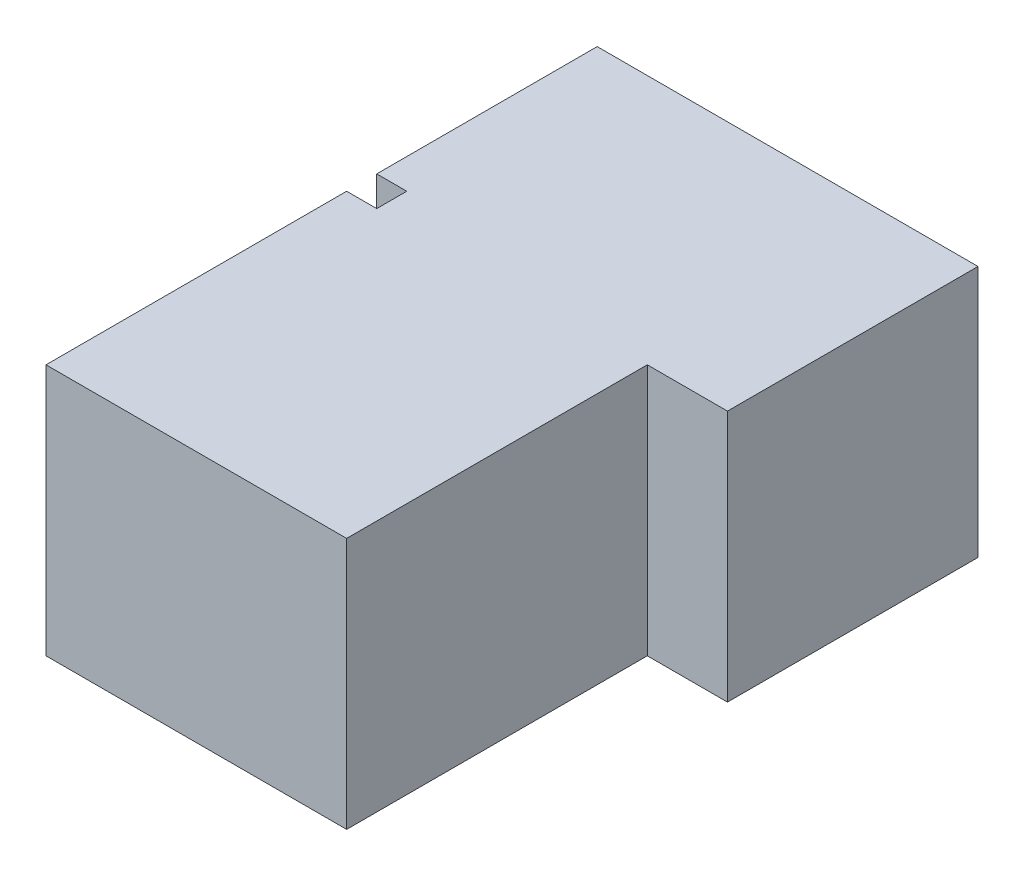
ISO-10303-21;
HEADER;
FILE_DESCRIPTION(('STEP AP214'),'2;1');
FILE_NAME('part.step','',(''),(''),'','','');
FILE_SCHEMA(('AUTOMOTIVE_DESIGN { 1 0 10303 214 1 1 1 1 }'));
ENDSEC;
DATA;
#1=APPLICATION_CONTEXT('core data for automotive mechanical design processes');
#2=APPLICATION_PROTOCOL_DEFINITION('international standard','automotive_design',2000,#1);
#3=PRODUCT_CONTEXT('',#1,'mechanical');
#4=PRODUCT('Part','Part','',(#3));
#5=PRODUCT_RELATED_PRODUCT_CATEGORY('part','',(#4));
#6=PRODUCT_DEFINITION_FORMATION('','',#4);
#7=PRODUCT_DEFINITION_CONTEXT('part definition',#1,'design');
#8=PRODUCT_DEFINITION('design','',#6,#7);
#9=PRODUCT_DEFINITION_SHAPE('','',#8);
#10=(LENGTH_UNIT() NAMED_UNIT(*) SI_UNIT(.MILLI.,.METRE.));
#11=(NAMED_UNIT(*) PLANE_ANGLE_UNIT() SI_UNIT($,.RADIAN.));
#12=(NAMED_UNIT(*) SI_UNIT($,.STERADIAN.) SOLID_ANGLE_UNIT());
#13=UNCERTAINTY_MEASURE_WITH_UNIT(LENGTH_MEASURE(1.E-05),#10,'distance_accuracy_value','');
#14=(GEOMETRIC_REPRESENTATION_CONTEXT(3) GLOBAL_UNCERTAINTY_ASSIGNED_CONTEXT((#13)) GLOBAL_UNIT_ASSIGNED_CONTEXT((#10,
#11,#12)) REPRESENTATION_CONTEXT('',''));
#15=CARTESIAN_POINT('',(0.,0.,0.));
#16=DIRECTION('',(0.,0.,1.));
#17=DIRECTION('',(1.,0.,0.));
#18=AXIS2_PLACEMENT_3D('',#15,#16,#17);
#19=CARTESIAN_POINT('',(0.,2515.,0.));
#20=DIRECTION('',(0.,1.,0.));
#21=DIRECTION('',(0.,0.,1.));
#22=AXIS2_PLACEMENT_3D('',#19,#20,#21);
#23=PLANE('',#22);
#24=DIRECTION('',(0.,0.,-1.));
#25=VECTOR('',#24,1.);
#26=CARTESIAN_POINT('',(3800.,2515.,2500.));
#27=LINE('',#26,#25);
#28=CARTESIAN_POINT('',(3800.,2515.,2500.));
#29=VERTEX_POINT('',#28);
#30=CARTESIAN_POINT('',(3800.00000000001,2515.,0.));
#31=VERTEX_POINT('',#30);
#32=EDGE_CURVE('E708',#29,#31,#27,.T.);
#33=ORIENTED_EDGE('',*,*,#32,.T.);
#34=DIRECTION('',(-1.,0.,0.));
#35=VECTOR('',#34,1.);
#36=CARTESIAN_POINT('',(3800.00000000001,2515.,0.));
#37=LINE('',#36,#35);
#38=CARTESIAN_POINT('',(0.,2515.,0.));
#39=VERTEX_POINT('',#38);
#40=EDGE_CURVE('E717',#31,#39,#37,.T.);
#41=ORIENTED_EDGE('',*,*,#40,.T.);
#42=DIRECTION('',(0.,0.,1.));
#43=VECTOR('',#42,1.);
#44=CARTESIAN_POINT('',(0.,2515.,0.));
#45=LINE('',#44,#43);
#46=CARTESIAN_POINT('',(0.,2515.,2200.));
#47=VERTEX_POINT('',#46);
#48=EDGE_CURVE('E723',#39,#47,#45,.T.);
#49=ORIENTED_EDGE('',*,*,#48,.T.);
#50=DIRECTION('',(1.,0.,0.));
#51=VECTOR('',#50,1.);
#52=CARTESIAN_POINT('',(0.,2515.,2200.));
#53=LINE('',#52,#51);
#54=CARTESIAN_POINT('',(300.,2515.,2200.));
#55=VERTEX_POINT('',#54);
#56=EDGE_CURVE('E732',#47,#55,#53,.T.);
#57=ORIENTED_EDGE('',*,*,#56,.T.);
#58=DIRECTION('',(0.,0.,1.));
#59=VECTOR('',#58,1.);
#60=CARTESIAN_POINT('',(300.,2515.,2200.));
#61=LINE('',#60,#59);
#62=CARTESIAN_POINT('',(300.,2515.,2500.));
#63=VERTEX_POINT('',#62);
#64=EDGE_CURVE('E735',#55,#63,#61,.T.);
#65=ORIENTED_EDGE('',*,*,#64,.T.);
#66=DIRECTION('',(-1.,0.,0.));
#67=VECTOR('',#66,1.);
#68=CARTESIAN_POINT('',(300.,2515.,2500.));
#69=LINE('',#68,#67);
#70=CARTESIAN_POINT('',(0.,2515.,2500.));
#71=VERTEX_POINT('',#70);
#72=EDGE_CURVE('E738',#63,#71,#69,.T.);
#73=ORIENTED_EDGE('',*,*,#72,.T.);
#74=DIRECTION('',(0.,0.,1.));
#75=VECTOR('',#74,1.);
#76=CARTESIAN_POINT('',(0.,2515.,2500.));
#77=LINE('',#76,#75);
#78=CARTESIAN_POINT('',(0.,2515.,5500.));
#79=VERTEX_POINT('',#78);
#80=EDGE_CURVE('E741',#71,#79,#77,.T.);
#81=ORIENTED_EDGE('',*,*,#80,.T.);
#82=DIRECTION('',(1.,0.,0.));
#83=VECTOR('',#82,1.);
#84=CARTESIAN_POINT('',(0.,2515.,5500.));
#85=LINE('',#84,#83);
#86=CARTESIAN_POINT('',(3000.,2515.,5500.));
#87=VERTEX_POINT('',#86);
#88=EDGE_CURVE('E744',#79,#87,#85,.T.);
#89=ORIENTED_EDGE('',*,*,#88,.T.);
#90=DIRECTION('',(0.,0.,-1.));
#91=VECTOR('',#90,1.);
#92=CARTESIAN_POINT('',(3000.,2515.,5500.));
#93=LINE('',#92,#91);
#94=CARTESIAN_POINT('',(3000.,2515.,2500.));
#95=VERTEX_POINT('',#94);
#96=EDGE_CURVE('E747',#87,#95,#93,.T.);
#97=ORIENTED_EDGE('',*,*,#96,.T.);
#98=DIRECTION('',(1.,0.,0.));
#99=VECTOR('',#98,1.);
#100=CARTESIAN_POINT('',(3000.,2515.,2500.));
#101=LINE('',#100,#99);
#102=EDGE_CURVE('E728',#95,#29,#101,.T.);
#103=ORIENTED_EDGE('',*,*,#102,.T.);
#104=EDGE_LOOP('',(#33,#41,#49,#57,#65,#73,#81,#89,#97,#103));
#105=FACE_BOUND('',#104,.T.);
#106=ADVANCED_FACE('F43',(#105),#23,.T.);
#107=CARTESIAN_POINT('',(0.,0.,0.));
#108=DIRECTION('',(0.,-1.,0.));
#109=DIRECTION('',(0.,0.,-1.));
#110=AXIS2_PLACEMENT_3D('',#107,#108,#109);
#111=PLANE('',#110);
#112=DIRECTION('',(0.,0.,1.));
#113=VECTOR('',#112,1.);
#114=CARTESIAN_POINT('',(0.,0.,2200.));
#115=LINE('',#114,#113);
#116=CARTESIAN_POINT('',(0.,0.,0.));
#117=VERTEX_POINT('',#116);
#118=CARTESIAN_POINT('',(0.,0.,2200.));
#119=VERTEX_POINT('',#118);
#120=EDGE_CURVE('E1421',#117,#119,#115,.T.);
#121=ORIENTED_EDGE('',*,*,#120,.F.);
#122=DIRECTION('',(-1.,0.,0.));
#123=VECTOR('',#122,1.);
#124=CARTESIAN_POINT('',(0.,0.,0.));
#125=LINE('',#124,#123);
#126=CARTESIAN_POINT('',(3800.00000000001,0.,0.));
#127=VERTEX_POINT('',#126);
#128=EDGE_CURVE('E1439',#127,#117,#125,.T.);
#129=ORIENTED_EDGE('',*,*,#128,.F.);
#130=DIRECTION('',(0.,0.,-1.));
#131=VECTOR('',#130,1.);
#132=CARTESIAN_POINT('',(3800.00000000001,0.,0.));
#133=LINE('',#132,#131);
#134=CARTESIAN_POINT('',(3800.,0.,2500.));
#135=VERTEX_POINT('',#134);
#136=EDGE_CURVE('E710',#135,#127,#133,.T.);
#137=ORIENTED_EDGE('',*,*,#136,.F.);
#138=DIRECTION('',(1.,0.,0.));
#139=VECTOR('',#138,1.);
#140=CARTESIAN_POINT('',(3800.,0.,2500.));
#141=LINE('',#140,#139);
#142=CARTESIAN_POINT('',(3000.,0.,2500.));
#143=VERTEX_POINT('',#142);
#144=EDGE_CURVE('E1436',#143,#135,#141,.T.);
#145=ORIENTED_EDGE('',*,*,#144,.F.);
#146=DIRECTION('',(0.,0.,-1.));
#147=VECTOR('',#146,1.);
#148=CARTESIAN_POINT('',(3000.,0.,2500.));
#149=LINE('',#148,#147);
#150=CARTESIAN_POINT('',(3000.,0.,5500.));
#151=VERTEX_POINT('',#150);
#152=EDGE_CURVE('E1434',#151,#143,#149,.T.);
#153=ORIENTED_EDGE('',*,*,#152,.F.);
#154=DIRECTION('',(1.,0.,0.));
#155=VECTOR('',#154,1.);
#156=CARTESIAN_POINT('',(3000.,0.,5500.));
#157=LINE('',#156,#155);
#158=CARTESIAN_POINT('',(0.,0.,5500.));
#159=VERTEX_POINT('',#158);
#160=EDGE_CURVE('E1432',#159,#151,#157,.T.);
#161=ORIENTED_EDGE('',*,*,#160,.F.);
#162=DIRECTION('',(0.,0.,1.));
#163=VECTOR('',#162,1.);
#164=CARTESIAN_POINT('',(0.,0.,5500.));
#165=LINE('',#164,#163);
#166=CARTESIAN_POINT('',(0.,0.,2500.));
#167=VERTEX_POINT('',#166);
#168=EDGE_CURVE('E1430',#167,#159,#165,.T.);
#169=ORIENTED_EDGE('',*,*,#168,.F.);
#170=DIRECTION('',(-1.,0.,0.));
#171=VECTOR('',#170,1.);
#172=CARTESIAN_POINT('',(0.,0.,2500.));
#173=LINE('',#172,#171);
#174=CARTESIAN_POINT('',(300.,0.,2500.));
#175=VERTEX_POINT('',#174);
#176=EDGE_CURVE('E1428',#175,#167,#173,.T.);
#177=ORIENTED_EDGE('',*,*,#176,.F.);
#178=DIRECTION('',(0.,0.,1.));
#179=VECTOR('',#178,1.);
#180=CARTESIAN_POINT('',(300.,0.,2500.));
#181=LINE('',#180,#179);
#182=CARTESIAN_POINT('',(300.,0.,2200.));
#183=VERTEX_POINT('',#182);
#184=EDGE_CURVE('E1426',#183,#175,#181,.T.);
#185=ORIENTED_EDGE('',*,*,#184,.F.);
#186=DIRECTION('',(1.,0.,0.));
#187=VECTOR('',#186,1.);
#188=CARTESIAN_POINT('',(300.,0.,2200.));
#189=LINE('',#188,#187);
#190=EDGE_CURVE('E1424',#119,#183,#189,.T.);
#191=ORIENTED_EDGE('',*,*,#190,.F.);
#192=EDGE_LOOP('',(#121,#129,#137,#145,#153,#161,#169,#177,#185,#191));
#193=FACE_BOUND('',#192,.T.);
#194=ADVANCED_FACE('F1857',(#193),#111,.T.);
#195=CARTESIAN_POINT('',(3800.,10.,2500.));
#196=DIRECTION('',(0.,0.,-1.));
#197=DIRECTION('',(-1.,0.,0.));
#198=AXIS2_PLACEMENT_3D('',#195,#196,#197);
#199=PLANE('',#198);
#200=ORIENTED_EDGE('',*,*,#144,.T.);
#201=DIRECTION('',(0.,-1.,0.));
#202=VECTOR('',#201,1.);
#203=CARTESIAN_POINT('',(3800.,10.,2500.));
#204=LINE('',#203,#202);
#205=EDGE_CURVE('E713',#29,#135,#204,.T.);
#206=ORIENTED_EDGE('',*,*,#205,.F.);
#207=ORIENTED_EDGE('',*,*,#102,.F.);
#208=DIRECTION('',(0.,-1.,0.));
#209=VECTOR('',#208,1.);
#210=CARTESIAN_POINT('',(3000.,10.,2500.));
#211=LINE('',#210,#209);
#212=EDGE_CURVE('E1443',#95,#143,#211,.T.);
#213=ORIENTED_EDGE('',*,*,#212,.T.);
#214=EDGE_LOOP('',(#200,#206,#207,#213));
#215=FACE_BOUND('',#214,.T.);
#216=ADVANCED_FACE('F1863',(#215),#199,.F.);
#217=CARTESIAN_POINT('',(3000.,10.,2500.));
#218=DIRECTION('',(-1.,0.,0.));
#219=DIRECTION('',(0.,0.,1.));
#220=AXIS2_PLACEMENT_3D('',#217,#218,#219);
#221=PLANE('',#220);
#222=ORIENTED_EDGE('',*,*,#152,.T.);
#223=ORIENTED_EDGE('',*,*,#212,.F.);
#224=ORIENTED_EDGE('',*,*,#96,.F.);
#225=DIRECTION('',(0.,-1.,0.));
#226=VECTOR('',#225,1.);
#227=CARTESIAN_POINT('',(3000.,10.,5500.));
#228=LINE('',#227,#226);
#229=EDGE_CURVE('E1446',#87,#151,#228,.T.);
#230=ORIENTED_EDGE('',*,*,#229,.T.);
#231=EDGE_LOOP('',(#222,#223,#224,#230));
#232=FACE_BOUND('',#231,.T.);
#233=ADVANCED_FACE('F2752',(#232),#221,.F.);
#234=CARTESIAN_POINT('',(3000.,10.,5500.));
#235=DIRECTION('',(0.,0.,-1.));
#236=DIRECTION('',(-1.,0.,0.));
#237=AXIS2_PLACEMENT_3D('',#234,#235,#236);
#238=PLANE('',#237);
#239=ORIENTED_EDGE('',*,*,#160,.T.);
#240=ORIENTED_EDGE('',*,*,#229,.F.);
#241=ORIENTED_EDGE('',*,*,#88,.F.);
#242=DIRECTION('',(0.,-1.,0.));
#243=VECTOR('',#242,1.);
#244=CARTESIAN_POINT('',(0.,10.,5500.));
#245=LINE('',#244,#243);
#246=EDGE_CURVE('E1449',#79,#159,#245,.T.);
#247=ORIENTED_EDGE('',*,*,#246,.T.);
#248=EDGE_LOOP('',(#239,#240,#241,#247));
#249=FACE_BOUND('',#248,.T.);
#250=ADVANCED_FACE('F2763',(#249),#238,.F.);
#251=CARTESIAN_POINT('',(0.,10.,5500.));
#252=DIRECTION('',(1.,0.,0.));
#253=DIRECTION('',(0.,0.,-1.));
#254=AXIS2_PLACEMENT_3D('',#251,#252,#253);
#255=PLANE('',#254);
#256=ORIENTED_EDGE('',*,*,#168,.T.);
#257=ORIENTED_EDGE('',*,*,#246,.F.);
#258=ORIENTED_EDGE('',*,*,#80,.F.);
#259=DIRECTION('',(0.,-1.,0.));
#260=VECTOR('',#259,1.);
#261=CARTESIAN_POINT('',(0.,10.,2500.));
#262=LINE('',#261,#260);
#263=EDGE_CURVE('E1452',#71,#167,#262,.T.);
#264=ORIENTED_EDGE('',*,*,#263,.T.);
#265=EDGE_LOOP('',(#256,#257,#258,#264));
#266=FACE_BOUND('',#265,.T.);
#267=ADVANCED_FACE('F2774',(#266),#255,.F.);
#268=CARTESIAN_POINT('',(0.,10.,2500.));
#269=DIRECTION('',(0.,0.,1.));
#270=DIRECTION('',(1.,0.,0.));
#271=AXIS2_PLACEMENT_3D('',#268,#269,#270);
#272=PLANE('',#271);
#273=ORIENTED_EDGE('',*,*,#176,.T.);
#274=ORIENTED_EDGE('',*,*,#263,.F.);
#275=ORIENTED_EDGE('',*,*,#72,.F.);
#276=DIRECTION('',(0.,-1.,0.));
#277=VECTOR('',#276,1.);
#278=CARTESIAN_POINT('',(300.,10.,2500.));
#279=LINE('',#278,#277);
#280=EDGE_CURVE('E1455',#63,#175,#279,.T.);
#281=ORIENTED_EDGE('',*,*,#280,.T.);
#282=EDGE_LOOP('',(#273,#274,#275,#281));
#283=FACE_BOUND('',#282,.T.);
#284=ADVANCED_FACE('F2785',(#283),#272,.F.);
#285=CARTESIAN_POINT('',(300.,10.,2500.));
#286=DIRECTION('',(1.,0.,0.));
#287=DIRECTION('',(0.,0.,-1.));
#288=AXIS2_PLACEMENT_3D('',#285,#286,#287);
#289=PLANE('',#288);
#290=ORIENTED_EDGE('',*,*,#184,.T.);
#291=ORIENTED_EDGE('',*,*,#280,.F.);
#292=ORIENTED_EDGE('',*,*,#64,.F.);
#293=DIRECTION('',(0.,-1.,0.));
#294=VECTOR('',#293,1.);
#295=CARTESIAN_POINT('',(300.,10.,2200.));
#296=LINE('',#295,#294);
#297=EDGE_CURVE('E1458',#55,#183,#296,.T.);
#298=ORIENTED_EDGE('',*,*,#297,.T.);
#299=EDGE_LOOP('',(#290,#291,#292,#298));
#300=FACE_BOUND('',#299,.T.);
#301=ADVANCED_FACE('F2796',(#300),#289,.F.);
#302=CARTESIAN_POINT('',(300.,10.,2200.));
#303=DIRECTION('',(0.,0.,-1.));
#304=DIRECTION('',(-1.,0.,0.));
#305=AXIS2_PLACEMENT_3D('',#302,#303,#304);
#306=PLANE('',#305);
#307=ORIENTED_EDGE('',*,*,#190,.T.);
#308=ORIENTED_EDGE('',*,*,#297,.F.);
#309=ORIENTED_EDGE('',*,*,#56,.F.);
#310=DIRECTION('',(0.,-1.,0.));
#311=VECTOR('',#310,1.);
#312=CARTESIAN_POINT('',(0.,10.,2200.));
#313=LINE('',#312,#311);
#314=EDGE_CURVE('E1461',#47,#119,#313,.T.);
#315=ORIENTED_EDGE('',*,*,#314,.T.);
#316=EDGE_LOOP('',(#307,#308,#309,#315));
#317=FACE_BOUND('',#316,.T.);
#318=ADVANCED_FACE('F2807',(#317),#306,.F.);
#319=CARTESIAN_POINT('',(0.,10.,2200.));
#320=DIRECTION('',(1.,0.,0.));
#321=DIRECTION('',(0.,0.,-1.));
#322=AXIS2_PLACEMENT_3D('',#319,#320,#321);
#323=PLANE('',#322);
#324=ORIENTED_EDGE('',*,*,#120,.T.);
#325=ORIENTED_EDGE('',*,*,#314,.F.);
#326=ORIENTED_EDGE('',*,*,#48,.F.);
#327=DIRECTION('',(0.,-1.,0.));
#328=VECTOR('',#327,1.);
#329=CARTESIAN_POINT('',(0.,10.,0.));
#330=LINE('',#329,#328);
#331=EDGE_CURVE('E714',#39,#117,#330,.T.);
#332=ORIENTED_EDGE('',*,*,#331,.T.);
#333=EDGE_LOOP('',(#324,#325,#326,#332));
#334=FACE_BOUND('',#333,.T.);
#335=ADVANCED_FACE('F2818',(#334),#323,.F.);
#336=CARTESIAN_POINT('',(0.,10.,0.));
#337=DIRECTION('',(0.,0.,1.));
#338=DIRECTION('',(1.,0.,0.));
#339=AXIS2_PLACEMENT_3D('',#336,#337,#338);
#340=PLANE('',#339);
#341=ORIENTED_EDGE('',*,*,#128,.T.);
#342=ORIENTED_EDGE('',*,*,#331,.F.);
#343=ORIENTED_EDGE('',*,*,#40,.F.);
#344=DIRECTION('',(0.,-1.,0.));
#345=VECTOR('',#344,1.);
#346=CARTESIAN_POINT('',(3800.00000000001,10.,0.));
#347=LINE('',#346,#345);
#348=EDGE_CURVE('E703',#31,#127,#347,.T.);
#349=ORIENTED_EDGE('',*,*,#348,.T.);
#350=EDGE_LOOP('',(#341,#342,#343,#349));
#351=FACE_BOUND('',#350,.T.);
#352=ADVANCED_FACE('F718',(#351),#340,.F.);
#353=CARTESIAN_POINT('',(3800.00000000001,10.,0.));
#354=DIRECTION('',(-1.,0.,0.));
#355=DIRECTION('',(0.,0.,1.));
#356=AXIS2_PLACEMENT_3D('',#353,#354,#355);
#357=PLANE('',#356);
#358=ORIENTED_EDGE('',*,*,#136,.T.);
#359=ORIENTED_EDGE('',*,*,#348,.F.);
#360=ORIENTED_EDGE('',*,*,#32,.F.);
#361=ORIENTED_EDGE('',*,*,#205,.T.);
#362=EDGE_LOOP('',(#358,#359,#360,#361));
#363=FACE_BOUND('',#362,.T.);
#364=ADVANCED_FACE('F705',(#363),#357,.F.);
#365=CLOSED_SHELL('',(#106,#194,#216,#233,#250,#267,#284,#301,#318,#335,#352,#364));
#366=CARTESIAN_POINT('',(1490.,2210.,60.));
#367=DIRECTION('',(1.,0.,0.));
#368=DIRECTION('',(0.,0.,-1.));
#369=AXIS2_PLACEMENT_3D('',#366,#367,#368);
#370=PLANE('',#369);
#371=DIRECTION('',(0.,-1.,0.));
#372=VECTOR('',#371,1.);
#373=CARTESIAN_POINT('',(1490.,2210.,10.));
#374=LINE('',#373,#372);
#375=CARTESIAN_POINT('',(1490.,2210.,10.));
#376=VERTEX_POINT('',#375);
#377=CARTESIAN_POINT('',(1490.,1910.,10.));
#378=VERTEX_POINT('',#377);
#379=EDGE_CURVE('E1581',#376,#378,#374,.T.);
#380=ORIENTED_EDGE('',*,*,#379,.T.);
#381=DIRECTION('',(0.,0.,-1.));
#382=VECTOR('',#381,1.);
#383=CARTESIAN_POINT('',(1490.,1910.,60.));
#384=LINE('',#383,#382);
#385=CARTESIAN_POINT('',(1490.,1910.,130.));
#386=VERTEX_POINT('',#385);
#387=EDGE_CURVE('E11',#386,#378,#384,.T.);
#388=ORIENTED_EDGE('',*,*,#387,.F.);
#389=DIRECTION('',(0.,0.707106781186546,0.707106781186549));
#390=VECTOR('',#389,1.);
#391=CARTESIAN_POINT('',(1490.,1910.,130.));
#392=LINE('',#391,#390);
#393=CARTESIAN_POINT('',(1490.,2010.,230.));
#394=VERTEX_POINT('',#393);
#395=EDGE_CURVE('E1568',#386,#394,#392,.T.);
#396=ORIENTED_EDGE('',*,*,#395,.T.);
#397=DIRECTION('',(0.,1.,0.));
#398=VECTOR('',#397,1.);
#399=CARTESIAN_POINT('',(1490.,2010.,230.));
#400=LINE('',#399,#398);
#401=CARTESIAN_POINT('',(1490.,2210.,230.));
#402=VERTEX_POINT('',#401);
#403=EDGE_CURVE('E1584',#394,#402,#400,.T.);
#404=ORIENTED_EDGE('',*,*,#403,.T.);
#405=DIRECTION('',(0.,0.,-1.));
#406=VECTOR('',#405,1.);
#407=CARTESIAN_POINT('',(1490.,2210.,60.));
#408=LINE('',#407,#406);
#409=EDGE_CURVE('E1605',#402,#376,#408,.T.);
#410=ORIENTED_EDGE('',*,*,#409,.T.);
#411=EDGE_LOOP('',(#380,#388,#396,#404,#410));
#412=FACE_BOUND('',#411,.T.);
#413=ADVANCED_FACE('F45',(#412),#370,.F.);
#414=CARTESIAN_POINT('',(1490.,1910.,60.));
#415=DIRECTION('',(0.,1.,0.));
#416=DIRECTION('',(0.,0.,1.));
#417=AXIS2_PLACEMENT_3D('',#414,#415,#416);
#418=PLANE('',#417);
#419=DIRECTION('',(1.,0.,0.));
#420=VECTOR('',#419,1.);
#421=CARTESIAN_POINT('',(1490.,1910.,10.));
#422=LINE('',#421,#420);
#423=CARTESIAN_POINT('',(2390.,1910.,10.));
#424=VERTEX_POINT('',#423);
#425=EDGE_CURVE('E1596',#378,#424,#422,.T.);
#426=ORIENTED_EDGE('',*,*,#425,.T.);
#427=DIRECTION('',(0.,0.,-1.));
#428=VECTOR('',#427,1.);
#429=CARTESIAN_POINT('',(2390.,1910.,60.));
#430=LINE('',#429,#428);
#431=CARTESIAN_POINT('',(2390.,1910.,130.));
#432=VERTEX_POINT('',#431);
#433=EDGE_CURVE('E52',#432,#424,#430,.T.);
#434=ORIENTED_EDGE('',*,*,#433,.F.);
#435=DIRECTION('',(-1.,0.,0.));
#436=VECTOR('',#435,1.);
#437=CARTESIAN_POINT('',(2734.81879299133,1910.,130.));
#438=LINE('',#437,#436);
#439=EDGE_CURVE('E1587',#432,#386,#438,.T.);
#440=ORIENTED_EDGE('',*,*,#439,.T.);
#441=ORIENTED_EDGE('',*,*,#387,.T.);
#442=EDGE_LOOP('',(#426,#434,#440,#441));
#443=FACE_BOUND('',#442,.T.);
#444=ADVANCED_FACE('F1616',(#443),#418,.F.);
#445=CARTESIAN_POINT('',(2390.,1910.,60.));
#446=DIRECTION('',(-1.,0.,0.));
#447=DIRECTION('',(0.,0.,1.));
#448=AXIS2_PLACEMENT_3D('',#445,#446,#447);
#449=PLANE('',#448);
#450=DIRECTION('',(0.,1.,0.));
#451=VECTOR('',#450,1.);
#452=CARTESIAN_POINT('',(2390.,1910.,10.));
#453=LINE('',#452,#451);
#454=CARTESIAN_POINT('',(2390.,2210.,10.));
#455=VERTEX_POINT('',#454);
#456=EDGE_CURVE('E1599',#424,#455,#453,.T.);
#457=ORIENTED_EDGE('',*,*,#456,.T.);
#458=DIRECTION('',(0.,0.,-1.));
#459=VECTOR('',#458,1.);
#460=CARTESIAN_POINT('',(2390.,2210.,60.));
#461=LINE('',#460,#459);
#462=CARTESIAN_POINT('',(2390.,2210.,230.));
#463=VERTEX_POINT('',#462);
#464=EDGE_CURVE('E1608',#463,#455,#461,.T.);
#465=ORIENTED_EDGE('',*,*,#464,.F.);
#466=DIRECTION('',(0.,-1.,0.));
#467=VECTOR('',#466,1.);
#468=CARTESIAN_POINT('',(2390.,2010.,230.));
#469=LINE('',#468,#467);
#470=CARTESIAN_POINT('',(2390.,2010.,230.));
#471=VERTEX_POINT('',#470);
#472=EDGE_CURVE('E1578',#463,#471,#469,.T.);
#473=ORIENTED_EDGE('',*,*,#472,.T.);
#474=DIRECTION('',(0.,-0.707106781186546,-0.707106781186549));
#475=VECTOR('',#474,1.);
#476=CARTESIAN_POINT('',(2390.,1910.,130.));
#477=LINE('',#476,#475);
#478=EDGE_CURVE('E1575',#471,#432,#477,.T.);
#479=ORIENTED_EDGE('',*,*,#478,.T.);
#480=ORIENTED_EDGE('',*,*,#433,.T.);
#481=EDGE_LOOP('',(#457,#465,#473,#479,#480));
#482=FACE_BOUND('',#481,.T.);
#483=ADVANCED_FACE('F1612',(#482),#449,.F.);
#484=CARTESIAN_POINT('',(1490.,2210.,60.));
#485=DIRECTION('',(0.,-1.,0.));
#486=DIRECTION('',(0.,0.,-1.));
#487=AXIS2_PLACEMENT_3D('',#484,#485,#486);
#488=PLANE('',#487);
#489=DIRECTION('',(-1.,0.,0.));
#490=VECTOR('',#489,1.);
#491=CARTESIAN_POINT('',(2330.,2210.,70.));
#492=LINE('',#491,#490);
#493=CARTESIAN_POINT('',(2330.,2210.,70.));
#494=VERTEX_POINT('',#493);
#495=CARTESIAN_POINT('',(1550.,2210.,70.));
#496=VERTEX_POINT('',#495);
#497=EDGE_CURVE('E1497',#494,#496,#492,.T.);
#498=ORIENTED_EDGE('',*,*,#497,.F.);
#499=DIRECTION('',(0.,0.,-1.));
#500=VECTOR('',#499,1.);
#501=CARTESIAN_POINT('',(2330.,2210.,170.));
#502=LINE('',#501,#500);
#503=CARTESIAN_POINT('',(2330.,2210.,170.));
#504=VERTEX_POINT('',#503);
#505=EDGE_CURVE('E59',#504,#494,#502,.T.);
#506=ORIENTED_EDGE('',*,*,#505,.F.);
#507=DIRECTION('',(1.,0.,0.));
#508=VECTOR('',#507,1.);
#509=CARTESIAN_POINT('',(1550.,2210.,170.));
#510=LINE('',#509,#508);
#511=CARTESIAN_POINT('',(1550.,2210.,170.));
#512=VERTEX_POINT('',#511);
#513=EDGE_CURVE('E1486',#512,#504,#510,.T.);
#514=ORIENTED_EDGE('',*,*,#513,.F.);
#515=DIRECTION('',(0.,0.,1.));
#516=VECTOR('',#515,1.);
#517=CARTESIAN_POINT('',(1550.,2210.,70.));
#518=LINE('',#517,#516);
#519=EDGE_CURVE('E1500',#496,#512,#518,.T.);
#520=ORIENTED_EDGE('',*,*,#519,.F.);
#521=EDGE_LOOP('',(#498,#506,#514,#520));
#522=FACE_BOUND('',#521,.T.);
#523=DIRECTION('',(-1.,0.,0.));
#524=VECTOR('',#523,1.);
#525=CARTESIAN_POINT('',(1490.,2210.,10.));
#526=LINE('',#525,#524);
#527=EDGE_CURVE('E1602',#455,#376,#526,.T.);
#528=ORIENTED_EDGE('',*,*,#527,.T.);
#529=ORIENTED_EDGE('',*,*,#409,.F.);
#530=DIRECTION('',(-1.,0.,0.));
#531=VECTOR('',#530,1.);
#532=CARTESIAN_POINT('',(2734.81879299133,2210.,230.));
#533=LINE('',#532,#531);
#534=EDGE_CURVE('E1579',#463,#402,#533,.T.);
#535=ORIENTED_EDGE('',*,*,#534,.F.);
#536=ORIENTED_EDGE('',*,*,#464,.T.);
#537=EDGE_LOOP('',(#528,#529,#535,#536));
#538=FACE_BOUND('',#537,.T.);
#539=ADVANCED_FACE('F1621',(#522,#538),#488,.F.);
#540=CARTESIAN_POINT('',(2734.81879299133,2010.,230.));
#541=DIRECTION('',(0.,0.,1.));
#542=DIRECTION('',(1.,0.,0.));
#543=AXIS2_PLACEMENT_3D('',#540,#541,#542);
#544=PLANE('',#543);
#545=ORIENTED_EDGE('',*,*,#472,.F.);
#546=ORIENTED_EDGE('',*,*,#534,.T.);
#547=ORIENTED_EDGE('',*,*,#403,.F.);
#548=DIRECTION('',(-1.,0.,0.));
#549=VECTOR('',#548,1.);
#550=CARTESIAN_POINT('',(2734.81879299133,2010.,230.));
#551=LINE('',#550,#549);
#552=EDGE_CURVE('E1590',#471,#394,#551,.T.);
#553=ORIENTED_EDGE('',*,*,#552,.F.);
#554=EDGE_LOOP('',(#545,#546,#547,#553));
#555=FACE_BOUND('',#554,.T.);
#556=ADVANCED_FACE('F1628',(#555),#544,.T.);
#557=CARTESIAN_POINT('',(2734.81879299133,1910.,130.));
#558=DIRECTION('',(0.,-0.707106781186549,0.707106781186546));
#559=DIRECTION('',(0.,-0.707106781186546,-0.707106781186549));
#560=AXIS2_PLACEMENT_3D('',#557,#558,#559);
#561=PLANE('',#560);
#562=DIRECTION('',(0.,-0.70710678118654,-0.707106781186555));
#563=VECTOR('',#562,1.);
#564=CARTESIAN_POINT('',(1550.,1949.3933982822,169.393398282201));
#565=LINE('',#564,#563);
#566=CARTESIAN_POINT('',(1550.,1949.3933982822,169.393398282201));
#567=VERTEX_POINT('',#566);
#568=CARTESIAN_POINT('',(1550.,1928.18019484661,148.180194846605));
#569=VERTEX_POINT('',#568);
#570=EDGE_CURVE('E67',#567,#569,#565,.T.);
#571=ORIENTED_EDGE('',*,*,#570,.F.);
#572=DIRECTION('',(-1.,0.,0.));
#573=VECTOR('',#572,1.);
#574=CARTESIAN_POINT('',(1550.,1949.3933982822,169.393398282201));
#575=LINE('',#574,#573);
#576=CARTESIAN_POINT('',(2330.,1949.3933982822,169.393398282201));
#577=VERTEX_POINT('',#576);
#578=EDGE_CURVE('E1516',#577,#567,#575,.T.);
#579=ORIENTED_EDGE('',*,*,#578,.F.);
#580=DIRECTION('',(0.,0.70710678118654,0.707106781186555));
#581=VECTOR('',#580,1.);
#582=CARTESIAN_POINT('',(2330.,1949.3933982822,169.393398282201));
#583=LINE('',#582,#581);
#584=CARTESIAN_POINT('',(2330.,1928.18019484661,148.180194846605));
#585=VERTEX_POINT('',#584);
#586=EDGE_CURVE('E1530',#585,#577,#583,.T.);
#587=ORIENTED_EDGE('',*,*,#586,.F.);
#588=DIRECTION('',(1.,0.,0.));
#589=VECTOR('',#588,1.);
#590=CARTESIAN_POINT('',(1550.,1928.18019484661,148.180194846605));
#591=LINE('',#590,#589);
#592=EDGE_CURVE('E1527',#569,#585,#591,.T.);
#593=ORIENTED_EDGE('',*,*,#592,.F.);
#594=EDGE_LOOP('',(#571,#579,#587,#593));
#595=FACE_BOUND('',#594,.T.);
#596=DIRECTION('',(0.,-0.707106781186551,-0.707106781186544));
#597=VECTOR('',#596,1.);
#598=CARTESIAN_POINT('',(1550.,1991.8198051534,211.819805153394));
#599=LINE('',#598,#597);
#600=CARTESIAN_POINT('',(1550.,1991.8198051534,211.819805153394));
#601=VERTEX_POINT('',#600);
#602=CARTESIAN_POINT('',(1550.,1970.6066017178,190.606601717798));
#603=VERTEX_POINT('',#602);
#604=EDGE_CURVE('E1537',#601,#603,#599,.T.);
#605=ORIENTED_EDGE('',*,*,#604,.F.);
#606=DIRECTION('',(-1.,0.,0.));
#607=VECTOR('',#606,1.);
#608=CARTESIAN_POINT('',(1550.,1991.8198051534,211.819805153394));
#609=LINE('',#608,#607);
#610=CARTESIAN_POINT('',(2330.,1991.8198051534,211.819805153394));
#611=VERTEX_POINT('',#610);
#612=EDGE_CURVE('E1547',#611,#601,#609,.T.);
#613=ORIENTED_EDGE('',*,*,#612,.F.);
#614=DIRECTION('',(0.,0.707106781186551,0.707106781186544));
#615=VECTOR('',#614,1.);
#616=CARTESIAN_POINT('',(2330.,1991.8198051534,211.819805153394));
#617=LINE('',#616,#615);
#618=CARTESIAN_POINT('',(2330.,1970.6066017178,190.606601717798));
#619=VERTEX_POINT('',#618);
#620=EDGE_CURVE('E1561',#619,#611,#617,.T.);
#621=ORIENTED_EDGE('',*,*,#620,.F.);
#622=DIRECTION('',(1.,0.,0.));
#623=VECTOR('',#622,1.);
#624=CARTESIAN_POINT('',(1550.,1970.6066017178,190.606601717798));
#625=LINE('',#624,#623);
#626=EDGE_CURVE('E1558',#603,#619,#625,.T.);
#627=ORIENTED_EDGE('',*,*,#626,.F.);
#628=EDGE_LOOP('',(#605,#613,#621,#627));
#629=FACE_BOUND('',#628,.T.);
#630=ORIENTED_EDGE('',*,*,#478,.F.);
#631=ORIENTED_EDGE('',*,*,#552,.T.);
#632=ORIENTED_EDGE('',*,*,#395,.F.);
#633=ORIENTED_EDGE('',*,*,#439,.F.);
#634=EDGE_LOOP('',(#630,#631,#632,#633));
#635=FACE_BOUND('',#634,.T.);
#636=ADVANCED_FACE('F1630',(#595,#629,#635),#561,.T.);
#637=CARTESIAN_POINT('',(1550.,1995.35533905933,208.284271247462));
#638=DIRECTION('',(-1.,0.,0.));
#639=DIRECTION('',(0.,0.,1.));
#640=AXIS2_PLACEMENT_3D('',#637,#638,#639);
#641=PLANE('',#640);
#642=ORIENTED_EDGE('',*,*,#604,.T.);
#643=DIRECTION('',(0.,-0.707106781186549,0.707106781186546));
#644=VECTOR('',#643,1.);
#645=CARTESIAN_POINT('',(1550.,1974.14213562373,187.071067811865));
#646=LINE('',#645,#644);
#647=CARTESIAN_POINT('',(1550.,1974.14213562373,187.071067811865));
#648=VERTEX_POINT('',#647);
#649=EDGE_CURVE('E1556',#648,#603,#646,.T.);
#650=ORIENTED_EDGE('',*,*,#649,.F.);
#651=DIRECTION('',(0.,-0.707106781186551,-0.707106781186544));
#652=VECTOR('',#651,1.);
#653=CARTESIAN_POINT('',(1550.,1995.35533905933,208.284271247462));
#654=LINE('',#653,#652);
#655=CARTESIAN_POINT('',(1550.,1995.35533905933,208.284271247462));
#656=VERTEX_POINT('',#655);
#657=EDGE_CURVE('E1543',#656,#648,#654,.T.);
#658=ORIENTED_EDGE('',*,*,#657,.F.);
#659=DIRECTION('',(0.,-0.707106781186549,0.707106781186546));
#660=VECTOR('',#659,1.);
#661=CARTESIAN_POINT('',(1550.,1995.35533905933,208.284271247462));
#662=LINE('',#661,#660);
#663=EDGE_CURVE('E1566',#656,#601,#662,.T.);
#664=ORIENTED_EDGE('',*,*,#663,.T.);
#665=EDGE_LOOP('',(#642,#650,#658,#664));
#666=FACE_BOUND('',#665,.T.);
#667=ADVANCED_FACE('F1632',(#666),#641,.F.);
#668=CARTESIAN_POINT('',(1550.,1995.35533905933,208.284271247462));
#669=DIRECTION('',(0.,0.707106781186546,0.707106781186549));
#670=DIRECTION('',(0.,-0.707106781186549,0.707106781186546));
#671=AXIS2_PLACEMENT_3D('',#668,#669,#670);
#672=PLANE('',#671);
#673=ORIENTED_EDGE('',*,*,#612,.T.);
#674=ORIENTED_EDGE('',*,*,#663,.F.);
#675=DIRECTION('',(-1.,0.,0.));
#676=VECTOR('',#675,1.);
#677=CARTESIAN_POINT('',(1550.,1995.35533905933,208.284271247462));
#678=LINE('',#677,#676);
#679=CARTESIAN_POINT('',(2330.,1995.35533905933,208.284271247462));
#680=VERTEX_POINT('',#679);
#681=EDGE_CURVE('E1553',#680,#656,#678,.T.);
#682=ORIENTED_EDGE('',*,*,#681,.F.);
#683=DIRECTION('',(0.,-0.707106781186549,0.707106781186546));
#684=VECTOR('',#683,1.);
#685=CARTESIAN_POINT('',(2330.,1995.35533905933,208.284271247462));
#686=LINE('',#685,#684);
#687=EDGE_CURVE('E1569',#680,#611,#686,.T.);
#688=ORIENTED_EDGE('',*,*,#687,.T.);
#689=EDGE_LOOP('',(#673,#674,#682,#688));
#690=FACE_BOUND('',#689,.T.);
#691=ADVANCED_FACE('F1640',(#690),#672,.F.);
#692=CARTESIAN_POINT('',(2330.,1995.35533905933,208.284271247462));
#693=DIRECTION('',(1.,0.,0.));
#694=DIRECTION('',(0.,0.,-1.));
#695=AXIS2_PLACEMENT_3D('',#692,#693,#694);
#696=PLANE('',#695);
#697=ORIENTED_EDGE('',*,*,#620,.T.);
#698=ORIENTED_EDGE('',*,*,#687,.F.);
#699=DIRECTION('',(0.,0.707106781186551,0.707106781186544));
#700=VECTOR('',#699,1.);
#701=CARTESIAN_POINT('',(2330.,1995.35533905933,208.284271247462));
#702=LINE('',#701,#700);
#703=CARTESIAN_POINT('',(2330.,1974.14213562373,187.071067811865));
#704=VERTEX_POINT('',#703);
#705=EDGE_CURVE('E1550',#704,#680,#702,.T.);
#706=ORIENTED_EDGE('',*,*,#705,.F.);
#707=DIRECTION('',(0.,-0.707106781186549,0.707106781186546));
#708=VECTOR('',#707,1.);
#709=CARTESIAN_POINT('',(2330.,1974.14213562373,187.071067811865));
#710=LINE('',#709,#708);
#711=EDGE_CURVE('E1571',#704,#619,#710,.T.);
#712=ORIENTED_EDGE('',*,*,#711,.T.);
#713=EDGE_LOOP('',(#697,#698,#706,#712));
#714=FACE_BOUND('',#713,.T.);
#715=ADVANCED_FACE('F1713',(#714),#696,.F.);
#716=CARTESIAN_POINT('',(1550.,1974.14213562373,187.071067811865));
#717=DIRECTION('',(0.,-0.707106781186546,-0.707106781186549));
#718=DIRECTION('',(0.,0.707106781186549,-0.707106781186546));
#719=AXIS2_PLACEMENT_3D('',#716,#717,#718);
#720=PLANE('',#719);
#721=ORIENTED_EDGE('',*,*,#626,.T.);
#722=ORIENTED_EDGE('',*,*,#711,.F.);
#723=DIRECTION('',(1.,0.,0.));
#724=VECTOR('',#723,1.);
#725=CARTESIAN_POINT('',(1550.,1974.14213562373,187.071067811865));
#726=LINE('',#725,#724);
#727=EDGE_CURVE('E1546',#648,#704,#726,.T.);
#728=ORIENTED_EDGE('',*,*,#727,.F.);
#729=ORIENTED_EDGE('',*,*,#649,.T.);
#730=EDGE_LOOP('',(#721,#722,#728,#729));
#731=FACE_BOUND('',#730,.T.);
#732=ADVANCED_FACE('F1709',(#731),#720,.F.);
#733=CARTESIAN_POINT('',(0.,893.535533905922,-893.535533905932));
#734=DIRECTION('',(0.,-0.707106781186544,0.707106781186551));
#735=DIRECTION('',(0.,-0.707106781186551,-0.707106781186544));
#736=AXIS2_PLACEMENT_3D('',#733,#734,#735);
#737=PLANE('',#736);
#738=ORIENTED_EDGE('',*,*,#657,.T.);
#739=ORIENTED_EDGE('',*,*,#727,.T.);
#740=ORIENTED_EDGE('',*,*,#705,.T.);
#741=ORIENTED_EDGE('',*,*,#681,.T.);
#742=EDGE_LOOP('',(#738,#739,#740,#741));
#743=FACE_BOUND('',#742,.T.);
#744=ADVANCED_FACE('F1706',(#743),#737,.T.);
#745=CARTESIAN_POINT('',(1550.,1952.92893218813,165.857864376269));
#746=DIRECTION('',(-1.,0.,0.));
#747=DIRECTION('',(0.,0.,1.));
#748=AXIS2_PLACEMENT_3D('',#745,#746,#747);
#749=PLANE('',#748);
#750=ORIENTED_EDGE('',*,*,#570,.T.);
#751=DIRECTION('',(0.,-0.707106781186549,0.707106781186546));
#752=VECTOR('',#751,1.);
#753=CARTESIAN_POINT('',(1550.,1931.71572875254,144.644660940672));
#754=LINE('',#753,#752);
#755=CARTESIAN_POINT('',(1550.,1931.71572875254,144.644660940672));
#756=VERTEX_POINT('',#755);
#757=EDGE_CURVE('E1525',#756,#569,#754,.T.);
#758=ORIENTED_EDGE('',*,*,#757,.F.);
#759=DIRECTION('',(0.,-0.70710678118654,-0.707106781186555));
#760=VECTOR('',#759,1.);
#761=CARTESIAN_POINT('',(1550.,1952.92893218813,165.857864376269));
#762=LINE('',#761,#760);
#763=CARTESIAN_POINT('',(1550.,1952.92893218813,165.857864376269));
#764=VERTEX_POINT('',#763);
#765=EDGE_CURVE('E1512',#764,#756,#762,.T.);
#766=ORIENTED_EDGE('',*,*,#765,.F.);
#767=DIRECTION('',(0.,-0.707106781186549,0.707106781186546));
#768=VECTOR('',#767,1.);
#769=CARTESIAN_POINT('',(1550.,1952.92893218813,165.857864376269));
#770=LINE('',#769,#768);
#771=EDGE_CURVE('E1535',#764,#567,#770,.T.);
#772=ORIENTED_EDGE('',*,*,#771,.T.);
#773=EDGE_LOOP('',(#750,#758,#766,#772));
#774=FACE_BOUND('',#773,.T.);
#775=ADVANCED_FACE('F1696',(#774),#749,.F.);
#776=CARTESIAN_POINT('',(1550.,1952.92893218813,165.857864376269));
#777=DIRECTION('',(0.,0.707106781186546,0.707106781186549));
#778=DIRECTION('',(0.,-0.707106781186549,0.707106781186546));
#779=AXIS2_PLACEMENT_3D('',#776,#777,#778);
#780=PLANE('',#779);
#781=ORIENTED_EDGE('',*,*,#578,.T.);
#782=ORIENTED_EDGE('',*,*,#771,.F.);
#783=DIRECTION('',(-1.,0.,0.));
#784=VECTOR('',#783,1.);
#785=CARTESIAN_POINT('',(1550.,1952.92893218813,165.857864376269));
#786=LINE('',#785,#784);
#787=CARTESIAN_POINT('',(2330.,1952.92893218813,165.857864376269));
#788=VERTEX_POINT('',#787);
#789=EDGE_CURVE('E1522',#788,#764,#786,.T.);
#790=ORIENTED_EDGE('',*,*,#789,.F.);
#791=DIRECTION('',(0.,-0.707106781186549,0.707106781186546));
#792=VECTOR('',#791,1.);
#793=CARTESIAN_POINT('',(2330.,1952.92893218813,165.857864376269));
#794=LINE('',#793,#792);
#795=EDGE_CURVE('E1538',#788,#577,#794,.T.);
#796=ORIENTED_EDGE('',*,*,#795,.T.);
#797=EDGE_LOOP('',(#781,#782,#790,#796));
#798=FACE_BOUND('',#797,.T.);
#799=ADVANCED_FACE('F1692',(#798),#780,.F.);
#800=CARTESIAN_POINT('',(2330.,1952.92893218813,165.857864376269));
#801=DIRECTION('',(1.,0.,0.));
#802=DIRECTION('',(0.,0.,-1.));
#803=AXIS2_PLACEMENT_3D('',#800,#801,#802);
#804=PLANE('',#803);
#805=ORIENTED_EDGE('',*,*,#586,.T.);
#806=ORIENTED_EDGE('',*,*,#795,.F.);
#807=DIRECTION('',(0.,0.70710678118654,0.707106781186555));
#808=VECTOR('',#807,1.);
#809=CARTESIAN_POINT('',(2330.,1952.92893218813,165.857864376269));
#810=LINE('',#809,#808);
#811=CARTESIAN_POINT('',(2330.,1931.71572875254,144.644660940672));
#812=VERTEX_POINT('',#811);
#813=EDGE_CURVE('E1519',#812,#788,#810,.T.);
#814=ORIENTED_EDGE('',*,*,#813,.F.);
#815=DIRECTION('',(0.,-0.707106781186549,0.707106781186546));
#816=VECTOR('',#815,1.);
#817=CARTESIAN_POINT('',(2330.,1931.71572875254,144.644660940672));
#818=LINE('',#817,#816);
#819=EDGE_CURVE('E1540',#812,#585,#818,.T.);
#820=ORIENTED_EDGE('',*,*,#819,.T.);
#821=EDGE_LOOP('',(#805,#806,#814,#820));
#822=FACE_BOUND('',#821,.T.);
#823=ADVANCED_FACE('F1695',(#822),#804,.F.);
#824=CARTESIAN_POINT('',(1550.,1931.71572875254,144.644660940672));
#825=DIRECTION('',(0.,-0.707106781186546,-0.707106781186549));
#826=DIRECTION('',(0.,0.707106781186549,-0.707106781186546));
#827=AXIS2_PLACEMENT_3D('',#824,#825,#826);
#828=PLANE('',#827);
#829=ORIENTED_EDGE('',*,*,#592,.T.);
#830=ORIENTED_EDGE('',*,*,#819,.F.);
#831=DIRECTION('',(1.,0.,0.));
#832=VECTOR('',#831,1.);
#833=CARTESIAN_POINT('',(1550.,1931.71572875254,144.644660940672));
#834=LINE('',#833,#832);
#835=EDGE_CURVE('E1515',#756,#812,#834,.T.);
#836=ORIENTED_EDGE('',*,*,#835,.F.);
#837=ORIENTED_EDGE('',*,*,#757,.T.);
#838=EDGE_LOOP('',(#829,#830,#836,#837));
#839=FACE_BOUND('',#838,.T.);
#840=ADVANCED_FACE('F1690',(#839),#828,.F.);
#841=CARTESIAN_POINT('',(0.,893.535533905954,-893.535533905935));
#842=DIRECTION('',(0.,-0.707106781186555,0.70710678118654));
#843=DIRECTION('',(0.,-0.70710678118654,-0.707106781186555));
#844=AXIS2_PLACEMENT_3D('',#841,#842,#843);
#845=PLANE('',#844);
#846=ORIENTED_EDGE('',*,*,#765,.T.);
#847=ORIENTED_EDGE('',*,*,#835,.T.);
#848=ORIENTED_EDGE('',*,*,#813,.T.);
#849=ORIENTED_EDGE('',*,*,#789,.T.);
#850=EDGE_LOOP('',(#846,#847,#848,#849));
#851=FACE_BOUND('',#850,.T.);
#852=ADVANCED_FACE('F1687',(#851),#845,.T.);
#853=CARTESIAN_POINT('',(2330.,2205.,170.));
#854=DIRECTION('',(1.,0.,0.));
#855=DIRECTION('',(0.,0.,-1.));
#856=AXIS2_PLACEMENT_3D('',#853,#854,#855);
#857=PLANE('',#856);
#858=ORIENTED_EDGE('',*,*,#505,.T.);
#859=DIRECTION('',(0.,1.,0.));
#860=VECTOR('',#859,1.);
#861=CARTESIAN_POINT('',(2330.,2205.,70.));
#862=LINE('',#861,#860);
#863=CARTESIAN_POINT('',(2330.,2205.,70.));
#864=VERTEX_POINT('',#863);
#865=EDGE_CURVE('E1495',#864,#494,#862,.T.);
#866=ORIENTED_EDGE('',*,*,#865,.F.);
#867=DIRECTION('',(0.,0.,-1.));
#868=VECTOR('',#867,1.);
#869=CARTESIAN_POINT('',(2330.,2205.,170.));
#870=LINE('',#869,#868);
#871=CARTESIAN_POINT('',(2330.,2205.,170.));
#872=VERTEX_POINT('',#871);
#873=EDGE_CURVE('E1482',#872,#864,#870,.T.);
#874=ORIENTED_EDGE('',*,*,#873,.F.);
#875=DIRECTION('',(0.,1.,0.));
#876=VECTOR('',#875,1.);
#877=CARTESIAN_POINT('',(2330.,2205.,170.));
#878=LINE('',#877,#876);
#879=EDGE_CURVE('E1505',#872,#504,#878,.T.);
#880=ORIENTED_EDGE('',*,*,#879,.T.);
#881=EDGE_LOOP('',(#858,#866,#874,#880));
#882=FACE_BOUND('',#881,.T.);
#883=ADVANCED_FACE('F1667',(#882),#857,.F.);
#884=CARTESIAN_POINT('',(1550.,2205.,170.));
#885=DIRECTION('',(0.,0.,1.));
#886=DIRECTION('',(1.,0.,0.));
#887=AXIS2_PLACEMENT_3D('',#884,#885,#886);
#888=PLANE('',#887);
#889=ORIENTED_EDGE('',*,*,#513,.T.);
#890=ORIENTED_EDGE('',*,*,#879,.F.);
#891=DIRECTION('',(1.,0.,0.));
#892=VECTOR('',#891,1.);
#893=CARTESIAN_POINT('',(1550.,2205.,170.));
#894=LINE('',#893,#892);
#895=CARTESIAN_POINT('',(1550.,2205.,170.));
#896=VERTEX_POINT('',#895);
#897=EDGE_CURVE('E1492',#896,#872,#894,.T.);
#898=ORIENTED_EDGE('',*,*,#897,.F.);
#899=DIRECTION('',(0.,1.,0.));
#900=VECTOR('',#899,1.);
#901=CARTESIAN_POINT('',(1550.,2205.,170.));
#902=LINE('',#901,#900);
#903=EDGE_CURVE('E1507',#896,#512,#902,.T.);
#904=ORIENTED_EDGE('',*,*,#903,.T.);
#905=EDGE_LOOP('',(#889,#890,#898,#904));
#906=FACE_BOUND('',#905,.T.);
#907=ADVANCED_FACE('F1672',(#906),#888,.F.);
#908=CARTESIAN_POINT('',(1550.,2205.,70.));
#909=DIRECTION('',(-1.,0.,0.));
#910=DIRECTION('',(0.,0.,1.));
#911=AXIS2_PLACEMENT_3D('',#908,#909,#910);
#912=PLANE('',#911);
#913=ORIENTED_EDGE('',*,*,#519,.T.);
#914=ORIENTED_EDGE('',*,*,#903,.F.);
#915=DIRECTION('',(0.,0.,1.));
#916=VECTOR('',#915,1.);
#917=CARTESIAN_POINT('',(1550.,2205.,70.));
#918=LINE('',#917,#916);
#919=CARTESIAN_POINT('',(1550.,2205.,70.));
#920=VERTEX_POINT('',#919);
#921=EDGE_CURVE('E1489',#920,#896,#918,.T.);
#922=ORIENTED_EDGE('',*,*,#921,.F.);
#923=DIRECTION('',(0.,1.,0.));
#924=VECTOR('',#923,1.);
#925=CARTESIAN_POINT('',(1550.,2205.,70.));
#926=LINE('',#925,#924);
#927=EDGE_CURVE('E1509',#920,#496,#926,.T.);
#928=ORIENTED_EDGE('',*,*,#927,.T.);
#929=EDGE_LOOP('',(#913,#914,#922,#928));
#930=FACE_BOUND('',#929,.T.);
#931=ADVANCED_FACE('F1674',(#930),#912,.F.);
#932=CARTESIAN_POINT('',(2330.,2205.,70.));
#933=DIRECTION('',(0.,0.,-1.));
#934=DIRECTION('',(-1.,0.,0.));
#935=AXIS2_PLACEMENT_3D('',#932,#933,#934);
#936=PLANE('',#935);
#937=ORIENTED_EDGE('',*,*,#497,.T.);
#938=ORIENTED_EDGE('',*,*,#927,.F.);
#939=DIRECTION('',(-1.,0.,0.));
#940=VECTOR('',#939,1.);
#941=CARTESIAN_POINT('',(2330.,2205.,70.));
#942=LINE('',#941,#940);
#943=EDGE_CURVE('E1485',#864,#920,#942,.T.);
#944=ORIENTED_EDGE('',*,*,#943,.F.);
#945=ORIENTED_EDGE('',*,*,#865,.T.);
#946=EDGE_LOOP('',(#937,#938,#944,#945));
#947=FACE_BOUND('',#946,.T.);
#948=ADVANCED_FACE('F1663',(#947),#936,.F.);
#949=CARTESIAN_POINT('',(0.,2205.,0.));
#950=DIRECTION('',(0.,1.,0.));
#951=DIRECTION('',(0.,0.,1.));
#952=AXIS2_PLACEMENT_3D('',#949,#950,#951);
#953=PLANE('',#952);
#954=ORIENTED_EDGE('',*,*,#873,.T.);
#955=ORIENTED_EDGE('',*,*,#943,.T.);
#956=ORIENTED_EDGE('',*,*,#921,.T.);
#957=ORIENTED_EDGE('',*,*,#897,.T.);
#958=EDGE_LOOP('',(#954,#955,#956,#957));
#959=FACE_BOUND('',#958,.T.);
#960=ADVANCED_FACE('F1670',(#959),#953,.T.);
#961=CARTESIAN_POINT('',(3790.,2510.,10.));
#962=DIRECTION('',(0.,0.,1.));
#963=DIRECTION('',(1.,0.,0.));
#964=AXIS2_PLACEMENT_3D('',#961,#962,#963);
#965=PLANE('',#964);
#966=DIRECTION('',(-1.,0.,0.));
#967=VECTOR('',#966,1.);
#968=CARTESIAN_POINT('',(0.,660.,10.));
#969=LINE('',#968,#967);
#970=CARTESIAN_POINT('',(1578.79219486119,660.,10.));
#971=VERTEX_POINT('',#970);
#972=CARTESIAN_POINT('',(839.115984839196,660.,10.));
#973=VERTEX_POINT('',#972);
#974=EDGE_CURVE('E863',#971,#973,#969,.T.);
#975=ORIENTED_EDGE('',*,*,#974,.F.);
#976=DIRECTION('',(0.,-1.,0.));
#977=VECTOR('',#976,1.);
#978=CARTESIAN_POINT('',(1578.79219486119,460.,10.));
#979=LINE('',#978,#977);
#980=CARTESIAN_POINT('',(1578.79219486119,10.,10.));
#981=VERTEX_POINT('',#980);
#982=EDGE_CURVE('E943',#971,#981,#979,.T.);
#983=ORIENTED_EDGE('',*,*,#982,.T.);
#984=DIRECTION('',(-1.,0.,0.));
#985=VECTOR('',#984,1.);
#986=CARTESIAN_POINT('',(3790.,10.,10.));
#987=LINE('',#986,#985);
#988=CARTESIAN_POINT('',(3790.,10.,10.));
#989=VERTEX_POINT('',#988);
#990=EDGE_CURVE('E1371',#989,#981,#987,.T.);
#991=ORIENTED_EDGE('',*,*,#990,.F.);
#992=DIRECTION('',(0.,-1.,0.));
#993=VECTOR('',#992,1.);
#994=CARTESIAN_POINT('',(3790.,2510.,10.));
#995=LINE('',#994,#993);
#996=CARTESIAN_POINT('',(3790.,2510.,10.));
#997=VERTEX_POINT('',#996);
#998=EDGE_CURVE('E1370',#997,#989,#995,.T.);
#999=ORIENTED_EDGE('',*,*,#998,.F.);
#1000=DIRECTION('',(-1.,0.,0.));
#1001=VECTOR('',#1000,1.);
#1002=CARTESIAN_POINT('',(3790.,2510.,10.));
#1003=LINE('',#1002,#1001);
#1004=CARTESIAN_POINT('',(10.0000000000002,2510.,10.));
#1005=VERTEX_POINT('',#1004);
#1006=EDGE_CURVE('E1339',#997,#1005,#1003,.T.);
#1007=ORIENTED_EDGE('',*,*,#1006,.T.);
#1008=DIRECTION('',(0.,-1.,0.));
#1009=VECTOR('',#1008,1.);
#1010=CARTESIAN_POINT('',(10.,2510.,10.));
#1011=LINE('',#1010,#1009);
#1012=CARTESIAN_POINT('',(10.,10.,10.));
#1013=VERTEX_POINT('',#1012);
#1014=EDGE_CURVE('E1418',#1005,#1013,#1011,.T.);
#1015=ORIENTED_EDGE('',*,*,#1014,.T.);
#1016=CARTESIAN_POINT('',(839.115984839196,10.,10.));
#1017=VERTEX_POINT('',#1016);
#1018=EDGE_CURVE('E1266',#1017,#1013,#987,.T.);
#1019=ORIENTED_EDGE('',*,*,#1018,.F.);
#1020=DIRECTION('',(0.,-1.,0.));
#1021=VECTOR('',#1020,1.);
#1022=CARTESIAN_POINT('',(839.115984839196,460.,10.));
#1023=LINE('',#1022,#1021);
#1024=EDGE_CURVE('E932',#973,#1017,#1023,.T.);
#1025=ORIENTED_EDGE('',*,*,#1024,.F.);
#1026=EDGE_LOOP('',(#975,#983,#991,#999,#1007,#1015,#1019,#1025));
#1027=FACE_BOUND('',#1026,.T.);
#1028=ORIENTED_EDGE('',*,*,#379,.F.);
#1029=ORIENTED_EDGE('',*,*,#527,.F.);
#1030=ORIENTED_EDGE('',*,*,#456,.F.);
#1031=ORIENTED_EDGE('',*,*,#425,.F.);
#1032=EDGE_LOOP('',(#1028,#1029,#1030,#1031));
#1033=FACE_BOUND('',#1032,.T.);
#1034=ADVANCED_FACE('F1619',(#1027,#1033),#965,.T.);
#1035=CARTESIAN_POINT('',(1311.86190416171,90.,1126.27411682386));
#1036=DIRECTION('',(0.,1.,0.));
#1037=DIRECTION('',(0.,0.,1.));
#1038=AXIS2_PLACEMENT_3D('',#1035,#1036,#1037);
#1039=PLANE('',#1038);
#1040=CARTESIAN_POINT('',(1081.06446722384,90.,1889.02923744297));
#1041=DIRECTION('',(0.,1.,0.));
#1042=DIRECTION('',(0.,0.,1.));
#1043=AXIS2_PLACEMENT_3D('',#1040,#1041,#1042);
#1044=CIRCLE('',#1043,30.0000000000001);
#1045=CARTESIAN_POINT('',(1081.06446722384,90.,1919.02923744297));
#1046=VERTEX_POINT('',#1045);
#1047=EDGE_CURVE('E784',#1046,#1046,#1044,.T.);
#1048=ORIENTED_EDGE('',*,*,#1047,.F.);
#1049=EDGE_LOOP('',(#1048));
#1050=FACE_BOUND('',#1049,.T.);
#1051=CARTESIAN_POINT('',(1550.9463787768,90.,933.226204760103));
#1052=DIRECTION('',(0.,1.,0.));
#1053=DIRECTION('',(0.,0.,1.));
#1054=AXIS2_PLACEMENT_3D('',#1051,#1052,#1053);
#1055=CIRCLE('',#1054,30.0000000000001);
#1056=CARTESIAN_POINT('',(1550.9463787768,90.,963.226204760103));
#1057=VERTEX_POINT('',#1056);
#1058=EDGE_CURVE('E796',#1057,#1057,#1055,.T.);
#1059=ORIENTED_EDGE('',*,*,#1058,.F.);
#1060=EDGE_LOOP('',(#1059));
#1061=FACE_BOUND('',#1060,.T.);
#1062=CARTESIAN_POINT('',(1311.86190416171,90.,1126.27411682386));
#1063=DIRECTION('',(0.,1.,0.));
#1064=DIRECTION('',(0.,0.,1.));
#1065=AXIS2_PLACEMENT_3D('',#1062,#1063,#1064);
#1066=CIRCLE('',#1065,399.802276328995);
#1067=CARTESIAN_POINT('',(1711.6641804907,90.,1126.27411682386));
#1068=VERTEX_POINT('',#1067);
#1069=CARTESIAN_POINT('',(912.059627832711,90.,1126.27411682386));
#1070=VERTEX_POINT('',#1069);
#1071=EDGE_CURVE('E805',#1068,#1070,#1066,.T.);
#1072=ORIENTED_EDGE('',*,*,#1071,.T.);
#1073=DIRECTION('',(0.,0.,1.));
#1074=VECTOR('',#1073,1.);
#1075=CARTESIAN_POINT('',(912.059627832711,90.,1126.27411682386));
#1076=LINE('',#1075,#1074);
#1077=CARTESIAN_POINT('',(912.059627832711,90.,1730.97416229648));
#1078=VERTEX_POINT('',#1077);
#1079=EDGE_CURVE('E808',#1070,#1078,#1076,.T.);
#1080=ORIENTED_EDGE('',*,*,#1079,.T.);
#1081=CARTESIAN_POINT('',(1311.86190416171,90.,1730.97416229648));
#1082=DIRECTION('',(0.,1.,0.));
#1083=DIRECTION('',(0.,0.,1.));
#1084=AXIS2_PLACEMENT_3D('',#1081,#1082,#1083);
#1085=CIRCLE('',#1084,399.802276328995);
#1086=CARTESIAN_POINT('',(1711.6641804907,90.,1730.97416229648));
#1087=VERTEX_POINT('',#1086);
#1088=EDGE_CURVE('E811',#1078,#1087,#1085,.T.);
#1089=ORIENTED_EDGE('',*,*,#1088,.T.);
#1090=DIRECTION('',(0.,0.,-1.));
#1091=VECTOR('',#1090,1.);
#1092=CARTESIAN_POINT('',(1711.6641804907,90.,1126.27411682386));
#1093=LINE('',#1092,#1091);
#1094=EDGE_CURVE('E813',#1087,#1068,#1093,.T.);
#1095=ORIENTED_EDGE('',*,*,#1094,.T.);
#1096=EDGE_LOOP('',(#1072,#1080,#1089,#1095));
#1097=FACE_BOUND('',#1096,.T.);
#1098=CARTESIAN_POINT('',(1081.06446722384,90.,933.226204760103));
#1099=DIRECTION('',(0.,1.,0.));
#1100=DIRECTION('',(0.,0.,1.));
#1101=AXIS2_PLACEMENT_3D('',#1098,#1099,#1100);
#1102=CIRCLE('',#1101,30.0000000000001);
#1103=CARTESIAN_POINT('',(1081.06446722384,90.,963.226204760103));
#1104=VERTEX_POINT('',#1103);
#1105=EDGE_CURVE('E790',#1104,#1104,#1102,.T.);
#1106=ORIENTED_EDGE('',*,*,#1105,.F.);
#1107=EDGE_LOOP('',(#1106));
#1108=FACE_BOUND('',#1107,.T.);
#1109=CARTESIAN_POINT('',(1550.9463787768,90.,1889.02923744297));
#1110=DIRECTION('',(0.,1.,0.));
#1111=DIRECTION('',(0.,0.,1.));
#1112=AXIS2_PLACEMENT_3D('',#1109,#1110,#1111);
#1113=CIRCLE('',#1112,30.0000000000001);
#1114=CARTESIAN_POINT('',(1550.9463787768,90.,1919.02923744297));
#1115=VERTEX_POINT('',#1114);
#1116=EDGE_CURVE('E780',#1115,#1115,#1113,.T.);
#1117=ORIENTED_EDGE('',*,*,#1116,.F.);
#1118=EDGE_LOOP('',(#1117));
#1119=FACE_BOUND('',#1118,.T.);
#1120=ADVANCED_FACE('F1794',(#1050,#1061,#1097,#1108,#1119),#1039,.T.);
#1121=CARTESIAN_POINT('',(0.,10.,0.));
#1122=DIRECTION('',(0.,-1.,0.));
#1123=DIRECTION('',(0.,0.,-1.));
#1124=AXIS2_PLACEMENT_3D('',#1121,#1122,#1123);
#1125=PLANE('',#1124);
#1126=CARTESIAN_POINT('',(1577.95195603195,10.,1848.88406605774));
#1127=DIRECTION('',(0.,-1.,0.));
#1128=DIRECTION('',(0.,0.,-1.));
#1129=AXIS2_PLACEMENT_3D('',#1126,#1127,#1128);
#1130=CIRCLE('',#1129,30.0000000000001);
#1131=CARTESIAN_POINT('',(1577.95195603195,10.,1818.88406605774));
#1132=VERTEX_POINT('',#1131);
#1133=EDGE_CURVE('E1476',#1132,#1132,#1130,.F.);
#1134=ORIENTED_EDGE('',*,*,#1133,.F.);
#1135=EDGE_LOOP('',(#1134));
#1136=FACE_BOUND('',#1135,.T.);
#1137=CARTESIAN_POINT('',(1023.37652081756,10.,938.398137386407));
#1138=DIRECTION('',(0.,-1.,0.));
#1139=DIRECTION('',(0.,0.,-1.));
#1140=AXIS2_PLACEMENT_3D('',#1137,#1138,#1139);
#1141=CIRCLE('',#1140,30.0000000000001);
#1142=CARTESIAN_POINT('',(1023.37652081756,10.,908.398137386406));
#1143=VERTEX_POINT('',#1142);
#1144=EDGE_CURVE('E1470',#1143,#1143,#1141,.F.);
#1145=ORIENTED_EDGE('',*,*,#1144,.F.);
#1146=EDGE_LOOP('',(#1145));
#1147=FACE_BOUND('',#1146,.T.);
#1148=DIRECTION('',(1.,0.,0.));
#1149=VECTOR('',#1148,1.);
#1150=CARTESIAN_POINT('',(0.,10.,2595.94846308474));
#1151=LINE('',#1150,#1149);
#1152=CARTESIAN_POINT('',(316.820584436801,10.,2595.94846308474));
#1153=VERTEX_POINT('',#1152);
#1154=CARTESIAN_POINT('',(784.820584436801,10.,2595.94846308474));
#1155=VERTEX_POINT('',#1154);
#1156=EDGE_CURVE('E1069',#1153,#1155,#1151,.T.);
#1157=ORIENTED_EDGE('',*,*,#1156,.T.);
#1158=DIRECTION('',(0.,0.,-1.));
#1159=VECTOR('',#1158,1.);
#1160=CARTESIAN_POINT('',(784.820584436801,10.,3976.97343067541));
#1161=LINE('',#1160,#1159);
#1162=CARTESIAN_POINT('',(784.820584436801,10.,3195.94846308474));
#1163=VERTEX_POINT('',#1162);
#1164=EDGE_CURVE('E993',#1163,#1155,#1161,.T.);
#1165=ORIENTED_EDGE('',*,*,#1164,.F.);
#1166=DIRECTION('',(1.,0.,0.));
#1167=VECTOR('',#1166,1.);
#1168=CARTESIAN_POINT('',(-1.41928622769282E-12,10.,3195.94846308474));
#1169=LINE('',#1168,#1167);
#1170=CARTESIAN_POINT('',(766.820584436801,10.,3195.94846308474));
#1171=VERTEX_POINT('',#1170);
#1172=EDGE_CURVE('E1014',#1171,#1163,#1169,.T.);
#1173=ORIENTED_EDGE('',*,*,#1172,.F.);
#1174=DIRECTION('',(0.,0.,-1.));
#1175=VECTOR('',#1174,1.);
#1176=CARTESIAN_POINT('',(766.8205844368,10.,-1.70268373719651E-13));
#1177=LINE('',#1176,#1175);
#1178=CARTESIAN_POINT('',(766.820584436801,10.,3095.94846308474));
#1179=VERTEX_POINT('',#1178);
#1180=EDGE_CURVE('E1025',#1171,#1179,#1177,.T.);
#1181=ORIENTED_EDGE('',*,*,#1180,.T.);
#1182=DIRECTION('',(-1.,0.,0.));
#1183=VECTOR('',#1182,1.);
#1184=CARTESIAN_POINT('',(0.,10.,3095.94846308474));
#1185=LINE('',#1184,#1183);
#1186=CARTESIAN_POINT('',(316.820584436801,10.,3095.94846308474));
#1187=VERTEX_POINT('',#1186);
#1188=EDGE_CURVE('E1045',#1179,#1187,#1185,.T.);
#1189=ORIENTED_EDGE('',*,*,#1188,.T.);
#1190=DIRECTION('',(0.,0.,-1.));
#1191=VECTOR('',#1190,1.);
#1192=CARTESIAN_POINT('',(316.820584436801,10.,0.));
#1193=LINE('',#1192,#1191);
#1194=EDGE_CURVE('E1040',#1187,#1153,#1193,.T.);
#1195=ORIENTED_EDGE('',*,*,#1194,.T.);
#1196=EDGE_LOOP('',(#1157,#1165,#1173,#1181,#1189,#1195));
#1197=FACE_BOUND('',#1196,.T.);
#1198=DIRECTION('',(0.,0.,-1.));
#1199=VECTOR('',#1198,1.);
#1200=CARTESIAN_POINT('',(1384.8205844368,9.99999999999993,3976.97343067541));
#1201=LINE('',#1200,#1199);
#1202=CARTESIAN_POINT('',(1384.8205844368,9.99999999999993,3195.94846308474));
#1203=VERTEX_POINT('',#1202);
#1204=CARTESIAN_POINT('',(1384.8205844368,9.99999999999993,2595.94846308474));
#1205=VERTEX_POINT('',#1204);
#1206=EDGE_CURVE('E1001',#1203,#1205,#1201,.T.);
#1207=ORIENTED_EDGE('',*,*,#1206,.T.);
#1208=CARTESIAN_POINT('',(2216.8205844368,10.,2595.94846308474));
#1209=VERTEX_POINT('',#1208);
#1210=EDGE_CURVE('E1083',#1205,#1209,#1151,.T.);
#1211=ORIENTED_EDGE('',*,*,#1210,.T.);
#1212=DIRECTION('',(0.,0.,-1.));
#1213=VECTOR('',#1212,1.);
#1214=CARTESIAN_POINT('',(2216.8205844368,10.,0.));
#1215=LINE('',#1214,#1213);
#1216=CARTESIAN_POINT('',(2216.8205844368,10.,3095.94846308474));
#1217=VERTEX_POINT('',#1216);
#1218=EDGE_CURVE('E1080',#1217,#1209,#1215,.T.);
#1219=ORIENTED_EDGE('',*,*,#1218,.F.);
#1220=DIRECTION('',(1.,0.,0.));
#1221=VECTOR('',#1220,1.);
#1222=CARTESIAN_POINT('',(0.,10.,3095.94846308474));
#1223=LINE('',#1222,#1221);
#1224=CARTESIAN_POINT('',(1766.8205844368,10.,3095.94846308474));
#1225=VERTEX_POINT('',#1224);
#1226=EDGE_CURVE('E1064',#1225,#1217,#1223,.T.);
#1227=ORIENTED_EDGE('',*,*,#1226,.F.);
#1228=DIRECTION('',(0.,0.,1.));
#1229=VECTOR('',#1228,1.);
#1230=CARTESIAN_POINT('',(1766.8205844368,10.,0.));
#1231=LINE('',#1230,#1229);
#1232=CARTESIAN_POINT('',(1766.8205844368,10.,3195.94846308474));
#1233=VERTEX_POINT('',#1232);
#1234=EDGE_CURVE('E1009',#1225,#1233,#1231,.T.);
#1235=ORIENTED_EDGE('',*,*,#1234,.T.);
#1236=EDGE_CURVE('E1028',#1203,#1233,#1169,.T.);
#1237=ORIENTED_EDGE('',*,*,#1236,.F.);
#1238=EDGE_LOOP('',(#1207,#1211,#1219,#1227,#1235,#1237));
#1239=FACE_BOUND('',#1238,.T.);
#1240=DIRECTION('',(0.,0.,1.));
#1241=VECTOR('',#1240,1.);
#1242=CARTESIAN_POINT('',(839.115984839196,10.,10.));
#1243=LINE('',#1242,#1241);
#1244=CARTESIAN_POINT('',(839.115984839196,10.,580.253488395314));
#1245=VERTEX_POINT('',#1244);
#1246=EDGE_CURVE('E929',#1017,#1245,#1243,.T.);
#1247=ORIENTED_EDGE('',*,*,#1246,.F.);
#1248=ORIENTED_EDGE('',*,*,#1018,.T.);
#1249=DIRECTION('',(0.,0.,1.));
#1250=VECTOR('',#1249,1.);
#1251=CARTESIAN_POINT('',(10.,10.,10.));
#1252=LINE('',#1251,#1250);
#1253=CARTESIAN_POINT('',(10.,10.,513.735162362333));
#1254=VERTEX_POINT('',#1253);
#1255=EDGE_CURVE('E1375',#1013,#1254,#1252,.T.);
#1256=ORIENTED_EDGE('',*,*,#1255,.T.);
#1257=DIRECTION('',(-1.,0.,0.));
#1258=VECTOR('',#1257,1.);
#1259=CARTESIAN_POINT('',(10.,10.,513.735162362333));
#1260=LINE('',#1259,#1258);
#1261=CARTESIAN_POINT('',(756.89688200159,10.,513.735162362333));
#1262=VERTEX_POINT('',#1261);
#1263=EDGE_CURVE('E955',#1262,#1254,#1260,.T.);
#1264=ORIENTED_EDGE('',*,*,#1263,.F.);
#1265=DIRECTION('',(0.,0.,-1.));
#1266=VECTOR('',#1265,1.);
#1267=CARTESIAN_POINT('',(756.89688200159,10.,513.735162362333));
#1268=LINE('',#1267,#1266);
#1269=CARTESIAN_POINT('',(756.89688200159,10.,2122.95799837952));
#1270=VERTEX_POINT('',#1269);
#1271=EDGE_CURVE('E958',#1270,#1262,#1268,.T.);
#1272=ORIENTED_EDGE('',*,*,#1271,.F.);
#1273=DIRECTION('',(1.,0.,0.));
#1274=VECTOR('',#1273,1.);
#1275=CARTESIAN_POINT('',(10.,10.,2122.95799837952));
#1276=LINE('',#1275,#1274);
#1277=CARTESIAN_POINT('',(10.,10.,2122.95799837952));
#1278=VERTEX_POINT('',#1277);
#1279=EDGE_CURVE('E951',#1278,#1270,#1276,.T.);
#1280=ORIENTED_EDGE('',*,*,#1279,.F.);
#1281=CARTESIAN_POINT('',(10.,10.,2190.));
#1282=VERTEX_POINT('',#1281);
#1283=EDGE_CURVE('E1374',#1278,#1282,#1252,.T.);
#1284=ORIENTED_EDGE('',*,*,#1283,.T.);
#1285=DIRECTION('',(1.,0.,0.));
#1286=VECTOR('',#1285,1.);
#1287=CARTESIAN_POINT('',(10.,10.,2190.));
#1288=LINE('',#1287,#1286);
#1289=CARTESIAN_POINT('',(310.,10.,2190.));
#1290=VERTEX_POINT('',#1289);
#1291=EDGE_CURVE('E1378',#1282,#1290,#1288,.T.);
#1292=ORIENTED_EDGE('',*,*,#1291,.T.);
#1293=DIRECTION('',(0.,0.,1.));
#1294=VECTOR('',#1293,1.);
#1295=CARTESIAN_POINT('',(310.,10.,2190.));
#1296=LINE('',#1295,#1294);
#1297=CARTESIAN_POINT('',(310.,10.,2510.));
#1298=VERTEX_POINT('',#1297);
#1299=EDGE_CURVE('E1381',#1290,#1298,#1296,.T.);
#1300=ORIENTED_EDGE('',*,*,#1299,.T.);
#1301=DIRECTION('',(-1.,0.,0.));
#1302=VECTOR('',#1301,1.);
#1303=CARTESIAN_POINT('',(310.,10.,2510.));
#1304=LINE('',#1303,#1302);
#1305=CARTESIAN_POINT('',(10.,10.,2510.));
#1306=VERTEX_POINT('',#1305);
#1307=EDGE_CURVE('E1384',#1298,#1306,#1304,.T.);
#1308=ORIENTED_EDGE('',*,*,#1307,.T.);
#1309=DIRECTION('',(0.,0.,1.));
#1310=VECTOR('',#1309,1.);
#1311=CARTESIAN_POINT('',(10.,10.,2510.));
#1312=LINE('',#1311,#1310);
#1313=CARTESIAN_POINT('',(10.,9.99999999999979,5090.));
#1314=VERTEX_POINT('',#1313);
#1315=EDGE_CURVE('E1387',#1306,#1314,#1312,.T.);
#1316=ORIENTED_EDGE('',*,*,#1315,.T.);
#1317=DIRECTION('',(-1.,0.,0.));
#1318=VECTOR('',#1317,1.);
#1319=CARTESIAN_POINT('',(0.,10.,5090.));
#1320=LINE('',#1319,#1318);
#1321=CARTESIAN_POINT('',(2990.,10.,5090.));
#1322=VERTEX_POINT('',#1321);
#1323=EDGE_CURVE('E1107',#1322,#1314,#1320,.T.);
#1324=ORIENTED_EDGE('',*,*,#1323,.F.);
#1325=DIRECTION('',(0.,0.,-1.));
#1326=VECTOR('',#1325,1.);
#1327=CARTESIAN_POINT('',(2990.,10.,5490.));
#1328=LINE('',#1327,#1326);
#1329=CARTESIAN_POINT('',(2990.,10.,2490.));
#1330=VERTEX_POINT('',#1329);
#1331=EDGE_CURVE('E1390',#1322,#1330,#1328,.T.);
#1332=ORIENTED_EDGE('',*,*,#1331,.T.);
#1333=DIRECTION('',(1.,0.,0.));
#1334=VECTOR('',#1333,1.);
#1335=CARTESIAN_POINT('',(2990.,10.,2490.));
#1336=LINE('',#1335,#1334);
#1337=CARTESIAN_POINT('',(3790.,10.,2490.));
#1338=VERTEX_POINT('',#1337);
#1339=EDGE_CURVE('E1392',#1330,#1338,#1336,.T.);
#1340=ORIENTED_EDGE('',*,*,#1339,.T.);
#1341=DIRECTION('',(0.,0.,-1.));
#1342=VECTOR('',#1341,1.);
#1343=CARTESIAN_POINT('',(3790.,10.,2490.));
#1344=LINE('',#1343,#1342);
#1345=EDGE_CURVE('E1343',#1338,#989,#1344,.T.);
#1346=ORIENTED_EDGE('',*,*,#1345,.T.);
#1347=ORIENTED_EDGE('',*,*,#990,.T.);
#1348=DIRECTION('',(0.,0.,-1.));
#1349=VECTOR('',#1348,1.);
#1350=CARTESIAN_POINT('',(1578.79219486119,10.,10.));
#1351=LINE('',#1350,#1349);
#1352=CARTESIAN_POINT('',(1578.79219486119,10.,580.253488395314));
#1353=VERTEX_POINT('',#1352);
#1354=EDGE_CURVE('E933',#1353,#981,#1351,.T.);
#1355=ORIENTED_EDGE('',*,*,#1354,.F.);
#1356=DIRECTION('',(1.,0.,0.));
#1357=VECTOR('',#1356,1.);
#1358=CARTESIAN_POINT('',(839.115984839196,10.,580.253488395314));
#1359=LINE('',#1358,#1357);
#1360=EDGE_CURVE('E936',#1245,#1353,#1359,.T.);
#1361=ORIENTED_EDGE('',*,*,#1360,.F.);
#1362=EDGE_LOOP('',(#1247,#1248,#1256,#1264,#1272,#1280,#1284,#1292,#1300,#1308,#1316,#1324,
#1332,#1340,#1346,#1347,#1355,#1361));
#1363=FACE_BOUND('',#1362,.T.);
#1364=CARTESIAN_POINT('',(1023.37652081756,10.,1848.88406605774));
#1365=DIRECTION('',(0.,-1.,0.));
#1366=DIRECTION('',(0.,0.,-1.));
#1367=AXIS2_PLACEMENT_3D('',#1364,#1365,#1366);
#1368=CIRCLE('',#1367,30.0000000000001);
#1369=CARTESIAN_POINT('',(1023.37652081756,10.,1818.88406605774));
#1370=VERTEX_POINT('',#1369);
#1371=EDGE_CURVE('E1473',#1370,#1370,#1368,.F.);
#1372=ORIENTED_EDGE('',*,*,#1371,.F.);
#1373=EDGE_LOOP('',(#1372));
#1374=FACE_BOUND('',#1373,.T.);
#1375=CARTESIAN_POINT('',(1577.95195603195,10.,938.398137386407));
#1376=DIRECTION('',(0.,-1.,0.));
#1377=DIRECTION('',(0.,0.,-1.));
#1378=AXIS2_PLACEMENT_3D('',#1375,#1376,#1377);
#1379=CIRCLE('',#1378,30.0000000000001);
#1380=CARTESIAN_POINT('',(1577.95195603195,10.,908.398137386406));
#1381=VERTEX_POINT('',#1380);
#1382=EDGE_CURVE('E1479',#1381,#1381,#1379,.F.);
#1383=ORIENTED_EDGE('',*,*,#1382,.F.);
#1384=EDGE_LOOP('',(#1383));
#1385=FACE_BOUND('',#1384,.T.);
#1386=ADVANCED_FACE('F1804',(#1136,#1147,#1197,#1239,#1363,#1374,#1385),#1125,.F.);
#1387=CARTESIAN_POINT('',(10.,2510.,10.));
#1388=DIRECTION('',(1.,0.,0.));
#1389=DIRECTION('',(0.,0.,-1.));
#1390=AXIS2_PLACEMENT_3D('',#1387,#1388,#1389);
#1391=PLANE('',#1390);
#1392=DIRECTION('',(0.,0.,1.));
#1393=VECTOR('',#1392,1.);
#1394=CARTESIAN_POINT('',(10.,660.,0.));
#1395=LINE('',#1394,#1393);
#1396=CARTESIAN_POINT('',(10.,660.,513.735162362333));
#1397=VERTEX_POINT('',#1396);
#1398=CARTESIAN_POINT('',(10.,660.,2122.95799837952));
#1399=VERTEX_POINT('',#1398);
#1400=EDGE_CURVE('E899',#1397,#1399,#1395,.T.);
#1401=ORIENTED_EDGE('',*,*,#1400,.F.);
#1402=DIRECTION('',(0.,-1.,0.));
#1403=VECTOR('',#1402,1.);
#1404=CARTESIAN_POINT('',(10.,460.,513.735162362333));
#1405=LINE('',#1404,#1403);
#1406=EDGE_CURVE('E954',#1397,#1254,#1405,.T.);
#1407=ORIENTED_EDGE('',*,*,#1406,.T.);
#1408=ORIENTED_EDGE('',*,*,#1255,.F.);
#1409=ORIENTED_EDGE('',*,*,#1014,.F.);
#1410=DIRECTION('',(0.,0.,1.));
#1411=VECTOR('',#1410,1.);
#1412=CARTESIAN_POINT('',(10.,2510.,10.));
#1413=LINE('',#1412,#1411);
#1414=CARTESIAN_POINT('',(10.,2510.,2190.));
#1415=VERTEX_POINT('',#1414);
#1416=EDGE_CURVE('E1342',#1005,#1415,#1413,.T.);
#1417=ORIENTED_EDGE('',*,*,#1416,.T.);
#1418=DIRECTION('',(0.,-1.,0.));
#1419=VECTOR('',#1418,1.);
#1420=CARTESIAN_POINT('',(10.,2510.,2190.));
#1421=LINE('',#1420,#1419);
#1422=EDGE_CURVE('E1415',#1415,#1282,#1421,.T.);
#1423=ORIENTED_EDGE('',*,*,#1422,.T.);
#1424=ORIENTED_EDGE('',*,*,#1283,.F.);
#1425=DIRECTION('',(0.,-1.,0.));
#1426=VECTOR('',#1425,1.);
#1427=CARTESIAN_POINT('',(10.,460.,2122.95799837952));
#1428=LINE('',#1427,#1426);
#1429=EDGE_CURVE('E970',#1399,#1278,#1428,.T.);
#1430=ORIENTED_EDGE('',*,*,#1429,.F.);
#1431=EDGE_LOOP('',(#1401,#1407,#1408,#1409,#1417,#1423,#1424,#1430));
#1432=FACE_BOUND('',#1431,.T.);
#1433=ADVANCED_FACE('F1814',(#1432),#1391,.T.);
#1434=CARTESIAN_POINT('',(784.820584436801,10.,3976.97343067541));
#1435=DIRECTION('',(-1.,0.,0.));
#1436=DIRECTION('',(0.,0.,1.));
#1437=AXIS2_PLACEMENT_3D('',#1434,#1435,#1436);
#1438=PLANE('',#1437);
#1439=DIRECTION('',(0.,1.,0.));
#1440=VECTOR('',#1439,1.);
#1441=CARTESIAN_POINT('',(784.820584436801,310.,2618.96597086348));
#1442=LINE('',#1441,#1440);
#1443=CARTESIAN_POINT('',(784.820584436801,310.,2618.96597086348));
#1444=VERTEX_POINT('',#1443);
#1445=CARTESIAN_POINT('',(784.820584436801,510.,2618.96597086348));
#1446=VERTEX_POINT('',#1445);
#1447=EDGE_CURVE('E982',#1444,#1446,#1442,.T.);
#1448=ORIENTED_EDGE('',*,*,#1447,.T.);
#1449=DIRECTION('',(0.,0.,-1.));
#1450=VECTOR('',#1449,1.);
#1451=CARTESIAN_POINT('',(784.820584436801,510.,3976.97343067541));
#1452=LINE('',#1451,#1450);
#1453=CARTESIAN_POINT('',(784.820584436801,510.,3195.94846308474));
#1454=VERTEX_POINT('',#1453);
#1455=EDGE_CURVE('E999',#1454,#1446,#1452,.T.);
#1456=ORIENTED_EDGE('',*,*,#1455,.F.);
#1457=DIRECTION('',(0.,-1.,0.));
#1458=VECTOR('',#1457,1.);
#1459=CARTESIAN_POINT('',(784.820584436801,10.,3195.94846308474));
#1460=LINE('',#1459,#1458);
#1461=EDGE_CURVE('E992',#1454,#1163,#1460,.T.);
#1462=ORIENTED_EDGE('',*,*,#1461,.T.);
#1463=ORIENTED_EDGE('',*,*,#1164,.T.);
#1464=DIRECTION('',(0.,1.,0.));
#1465=VECTOR('',#1464,1.);
#1466=CARTESIAN_POINT('',(784.820584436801,10.,2595.94846308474));
#1467=LINE('',#1466,#1465);
#1468=CARTESIAN_POINT('',(784.820584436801,310.,2595.94846308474));
#1469=VERTEX_POINT('',#1468);
#1470=EDGE_CURVE('E988',#1155,#1469,#1467,.T.);
#1471=ORIENTED_EDGE('',*,*,#1470,.T.);
#1472=DIRECTION('',(0.,0.,-1.));
#1473=VECTOR('',#1472,1.);
#1474=CARTESIAN_POINT('',(784.820584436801,310.,2595.94846308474));
#1475=LINE('',#1474,#1473);
#1476=EDGE_CURVE('E973',#1444,#1469,#1475,.T.);
#1477=ORIENTED_EDGE('',*,*,#1476,.F.);
#1478=EDGE_LOOP('',(#1448,#1456,#1462,#1463,#1471,#1477));
#1479=FACE_BOUND('',#1478,.T.);
#1480=ADVANCED_FACE('F1824',(#1479),#1438,.F.);
#1481=CARTESIAN_POINT('',(1384.8205844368,9.99999999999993,3976.97343067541));
#1482=DIRECTION('',(1.,0.,0.));
#1483=DIRECTION('',(0.,1.,0.));
#1484=AXIS2_PLACEMENT_3D('',#1481,#1482,#1483);
#1485=PLANE('',#1484);
#1486=DIRECTION('',(0.,1.,0.));
#1487=VECTOR('',#1486,1.);
#1488=CARTESIAN_POINT('',(1384.8205844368,9.99999999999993,2618.96597086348));
#1489=LINE('',#1488,#1487);
#1490=CARTESIAN_POINT('',(1384.8205844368,310.,2618.96597086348));
#1491=VERTEX_POINT('',#1490);
#1492=CARTESIAN_POINT('',(1384.8205844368,510.,2618.96597086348));
#1493=VERTEX_POINT('',#1492);
#1494=EDGE_CURVE('E985',#1491,#1493,#1489,.T.);
#1495=ORIENTED_EDGE('',*,*,#1494,.F.);
#1496=DIRECTION('',(0.,0.,1.));
#1497=VECTOR('',#1496,1.);
#1498=CARTESIAN_POINT('',(1384.8205844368,310.,3976.97343067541));
#1499=LINE('',#1498,#1497);
#1500=CARTESIAN_POINT('',(1384.8205844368,310.,2595.94846308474));
#1501=VERTEX_POINT('',#1500);
#1502=EDGE_CURVE('E1467',#1501,#1491,#1499,.T.);
#1503=ORIENTED_EDGE('',*,*,#1502,.F.);
#1504=DIRECTION('',(0.,-1.,0.));
#1505=VECTOR('',#1504,1.);
#1506=CARTESIAN_POINT('',(1384.8205844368,9.99999999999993,2595.94846308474));
#1507=LINE('',#1506,#1505);
#1508=EDGE_CURVE('E997',#1501,#1205,#1507,.T.);
#1509=ORIENTED_EDGE('',*,*,#1508,.T.);
#1510=ORIENTED_EDGE('',*,*,#1206,.F.);
#1511=DIRECTION('',(0.,1.,0.));
#1512=VECTOR('',#1511,1.);
#1513=CARTESIAN_POINT('',(1384.8205844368,9.99999999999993,3195.94846308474));
#1514=LINE('',#1513,#1512);
#1515=CARTESIAN_POINT('',(1384.8205844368,510.,3195.94846308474));
#1516=VERTEX_POINT('',#1515);
#1517=EDGE_CURVE('E989',#1203,#1516,#1514,.T.);
#1518=ORIENTED_EDGE('',*,*,#1517,.T.);
#1519=DIRECTION('',(0.,0.,-1.));
#1520=VECTOR('',#1519,1.);
#1521=CARTESIAN_POINT('',(1384.8205844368,510.,3976.97343067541));
#1522=LINE('',#1521,#1520);
#1523=EDGE_CURVE('E1004',#1516,#1493,#1522,.T.);
#1524=ORIENTED_EDGE('',*,*,#1523,.T.);
#1525=EDGE_LOOP('',(#1495,#1503,#1509,#1510,#1518,#1524));
#1526=FACE_BOUND('',#1525,.T.);
#1527=ADVANCED_FACE('F1830',(#1526),#1485,.F.);
#1528=CARTESIAN_POINT('',(784.820584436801,510.,3976.97343067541));
#1529=DIRECTION('',(0.,1.,0.));
#1530=DIRECTION('',(-1.,0.,0.));
#1531=AXIS2_PLACEMENT_3D('',#1528,#1529,#1530);
#1532=PLANE('',#1531);
#1533=DIRECTION('',(-1.,0.,0.));
#1534=VECTOR('',#1533,1.);
#1535=CARTESIAN_POINT('',(784.820584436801,510.,2618.96597086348));
#1536=LINE('',#1535,#1534);
#1537=EDGE_CURVE('E1464',#1493,#1446,#1536,.T.);
#1538=ORIENTED_EDGE('',*,*,#1537,.F.);
#1539=ORIENTED_EDGE('',*,*,#1523,.F.);
#1540=DIRECTION('',(-1.,0.,0.));
#1541=VECTOR('',#1540,1.);
#1542=CARTESIAN_POINT('',(784.820584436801,510.,3195.94846308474));
#1543=LINE('',#1542,#1541);
#1544=EDGE_CURVE('E995',#1516,#1454,#1543,.T.);
#1545=ORIENTED_EDGE('',*,*,#1544,.T.);
#1546=ORIENTED_EDGE('',*,*,#1455,.T.);
#1547=EDGE_LOOP('',(#1538,#1539,#1545,#1546));
#1548=FACE_BOUND('',#1547,.T.);
#1549=ADVANCED_FACE('F1840',(#1548),#1532,.F.);
#1550=CARTESIAN_POINT('',(10.,2510.,2510.));
#1551=DIRECTION('',(1.,0.,0.));
#1552=DIRECTION('',(0.,0.,-1.));
#1553=AXIS2_PLACEMENT_3D('',#1550,#1551,#1552);
#1554=PLANE('',#1553);
#1555=DIRECTION('',(0.,-1.,0.));
#1556=VECTOR('',#1555,1.);
#1557=CARTESIAN_POINT('',(10.,2510.,5490.));
#1558=LINE('',#1557,#1556);
#1559=CARTESIAN_POINT('',(10.,2510.,5490.));
#1560=VERTEX_POINT('',#1559);
#1561=CARTESIAN_POINT('',(10.,1810.,5490.));
#1562=VERTEX_POINT('',#1561);
#1563=EDGE_CURVE('E1406',#1560,#1562,#1558,.T.);
#1564=ORIENTED_EDGE('',*,*,#1563,.T.);
#1565=DIRECTION('',(0.,0.,1.));
#1566=VECTOR('',#1565,1.);
#1567=CARTESIAN_POINT('',(10.,1810.,5090.));
#1568=LINE('',#1567,#1566);
#1569=CARTESIAN_POINT('',(10.,1810.,5090.));
#1570=VERTEX_POINT('',#1569);
#1571=EDGE_CURVE('E1307',#1570,#1562,#1568,.T.);
#1572=ORIENTED_EDGE('',*,*,#1571,.F.);
#1573=DIRECTION('',(0.,1.,0.));
#1574=VECTOR('',#1573,1.);
#1575=CARTESIAN_POINT('',(10.,0.,5090.));
#1576=LINE('',#1575,#1574);
#1577=EDGE_CURVE('E1109',#1314,#1570,#1576,.T.);
#1578=ORIENTED_EDGE('',*,*,#1577,.F.);
#1579=ORIENTED_EDGE('',*,*,#1315,.F.);
#1580=DIRECTION('',(0.,-1.,0.));
#1581=VECTOR('',#1580,1.);
#1582=CARTESIAN_POINT('',(10.,2510.,2510.));
#1583=LINE('',#1582,#1581);
#1584=CARTESIAN_POINT('',(10.,2510.,2510.));
#1585=VERTEX_POINT('',#1584);
#1586=EDGE_CURVE('E1409',#1585,#1306,#1583,.T.);
#1587=ORIENTED_EDGE('',*,*,#1586,.F.);
#1588=DIRECTION('',(0.,0.,1.));
#1589=VECTOR('',#1588,1.);
#1590=CARTESIAN_POINT('',(10.,2510.,2510.));
#1591=LINE('',#1590,#1589);
#1592=EDGE_CURVE('E1355',#1585,#1560,#1591,.T.);
#1593=ORIENTED_EDGE('',*,*,#1592,.T.);
#1594=EDGE_LOOP('',(#1564,#1572,#1578,#1579,#1587,#1593));
#1595=FACE_BOUND('',#1594,.T.);
#1596=ADVANCED_FACE('F1850',(#1595),#1554,.T.);
#1597=CARTESIAN_POINT('',(10.,2510.,5490.));
#1598=DIRECTION('',(0.,0.,-1.));
#1599=DIRECTION('',(-1.,0.,0.));
#1600=AXIS2_PLACEMENT_3D('',#1597,#1598,#1599);
#1601=PLANE('',#1600);
#1602=DIRECTION('',(0.,1.,0.));
#1603=VECTOR('',#1602,1.);
#1604=CARTESIAN_POINT('',(900.,0.,5490.));
#1605=LINE('',#1604,#1603);
#1606=CARTESIAN_POINT('',(900.,1600.,5490.));
#1607=VERTEX_POINT('',#1606);
#1608=CARTESIAN_POINT('',(900.,1810.,5490.));
#1609=VERTEX_POINT('',#1608);
#1610=EDGE_CURVE('E1193',#1607,#1609,#1605,.T.);
#1611=ORIENTED_EDGE('',*,*,#1610,.T.);
#1612=DIRECTION('',(1.,0.,0.));
#1613=VECTOR('',#1612,1.);
#1614=CARTESIAN_POINT('',(0.,1810.,5490.));
#1615=LINE('',#1614,#1613);
#1616=EDGE_CURVE('E1190',#1562,#1609,#1615,.T.);
#1617=ORIENTED_EDGE('',*,*,#1616,.F.);
#1618=ORIENTED_EDGE('',*,*,#1563,.F.);
#1619=DIRECTION('',(1.,0.,0.));
#1620=VECTOR('',#1619,1.);
#1621=CARTESIAN_POINT('',(10.,2510.,5490.));
#1622=LINE('',#1621,#1620);
#1623=CARTESIAN_POINT('',(2990.,2510.,5490.));
#1624=VERTEX_POINT('',#1623);
#1625=EDGE_CURVE('E1358',#1560,#1624,#1622,.T.);
#1626=ORIENTED_EDGE('',*,*,#1625,.T.);
#1627=DIRECTION('',(0.,-1.,0.));
#1628=VECTOR('',#1627,1.);
#1629=CARTESIAN_POINT('',(2990.,2510.,5490.));
#1630=LINE('',#1629,#1628);
#1631=CARTESIAN_POINT('',(2990.,1810.,5490.));
#1632=VERTEX_POINT('',#1631);
#1633=EDGE_CURVE('E1403',#1624,#1632,#1630,.T.);
#1634=ORIENTED_EDGE('',*,*,#1633,.T.);
#1635=DIRECTION('',(-1.,0.,0.));
#1636=VECTOR('',#1635,1.);
#1637=CARTESIAN_POINT('',(0.,1810.,5490.));
#1638=LINE('',#1637,#1636);
#1639=CARTESIAN_POINT('',(2090.,1810.,5490.));
#1640=VERTEX_POINT('',#1639);
#1641=EDGE_CURVE('E1201',#1632,#1640,#1638,.T.);
#1642=ORIENTED_EDGE('',*,*,#1641,.T.);
#1643=DIRECTION('',(0.,1.,0.));
#1644=VECTOR('',#1643,1.);
#1645=CARTESIAN_POINT('',(2090.,0.,5490.));
#1646=LINE('',#1645,#1644);
#1647=CARTESIAN_POINT('',(2090.,1600.,5490.));
#1648=VERTEX_POINT('',#1647);
#1649=EDGE_CURVE('E1198',#1648,#1640,#1646,.T.);
#1650=ORIENTED_EDGE('',*,*,#1649,.F.);
#1651=DIRECTION('',(1.,0.,0.));
#1652=VECTOR('',#1651,1.);
#1653=CARTESIAN_POINT('',(2.98547367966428E-13,1600.,5490.));
#1654=LINE('',#1653,#1652);
#1655=EDGE_CURVE('E1196',#1607,#1648,#1654,.T.);
#1656=ORIENTED_EDGE('',*,*,#1655,.F.);
#1657=EDGE_LOOP('',(#1611,#1617,#1618,#1626,#1634,#1642,#1650,#1656));
#1658=FACE_BOUND('',#1657,.T.);
#1659=ADVANCED_FACE('F2187',(#1658),#1601,.T.);
#1660=CARTESIAN_POINT('',(10.,2510.,2190.));
#1661=DIRECTION('',(0.,0.,-1.));
#1662=DIRECTION('',(-1.,0.,0.));
#1663=AXIS2_PLACEMENT_3D('',#1660,#1661,#1662);
#1664=PLANE('',#1663);
#1665=ORIENTED_EDGE('',*,*,#1291,.F.);
#1666=ORIENTED_EDGE('',*,*,#1422,.F.);
#1667=DIRECTION('',(1.,0.,0.));
#1668=VECTOR('',#1667,1.);
#1669=CARTESIAN_POINT('',(10.,2510.,2190.));
#1670=LINE('',#1669,#1668);
#1671=CARTESIAN_POINT('',(310.,2510.,2190.));
#1672=VERTEX_POINT('',#1671);
#1673=EDGE_CURVE('E1346',#1415,#1672,#1670,.T.);
#1674=ORIENTED_EDGE('',*,*,#1673,.T.);
#1675=DIRECTION('',(0.,-1.,0.));
#1676=VECTOR('',#1675,1.);
#1677=CARTESIAN_POINT('',(310.,2510.,2190.));
#1678=LINE('',#1677,#1676);
#1679=EDGE_CURVE('E1413',#1672,#1290,#1678,.T.);
#1680=ORIENTED_EDGE('',*,*,#1679,.T.);
#1681=EDGE_LOOP('',(#1665,#1666,#1674,#1680));
#1682=FACE_BOUND('',#1681,.T.);
#1683=ADVANCED_FACE('F2870',(#1682),#1664,.T.);
#1684=CARTESIAN_POINT('',(310.,2510.,2190.));
#1685=DIRECTION('',(1.,0.,0.));
#1686=DIRECTION('',(0.,0.,-1.));
#1687=AXIS2_PLACEMENT_3D('',#1684,#1685,#1686);
#1688=PLANE('',#1687);
#1689=ORIENTED_EDGE('',*,*,#1299,.F.);
#1690=ORIENTED_EDGE('',*,*,#1679,.F.);
#1691=DIRECTION('',(0.,0.,1.));
#1692=VECTOR('',#1691,1.);
#1693=CARTESIAN_POINT('',(310.,2510.,2190.));
#1694=LINE('',#1693,#1692);
#1695=CARTESIAN_POINT('',(310.,2510.,2510.));
#1696=VERTEX_POINT('',#1695);
#1697=EDGE_CURVE('E1349',#1672,#1696,#1694,.T.);
#1698=ORIENTED_EDGE('',*,*,#1697,.T.);
#1699=DIRECTION('',(0.,-1.,0.));
#1700=VECTOR('',#1699,1.);
#1701=CARTESIAN_POINT('',(310.,2510.,2510.));
#1702=LINE('',#1701,#1700);
#1703=EDGE_CURVE('E1411',#1696,#1298,#1702,.T.);
#1704=ORIENTED_EDGE('',*,*,#1703,.T.);
#1705=EDGE_LOOP('',(#1689,#1690,#1698,#1704));
#1706=FACE_BOUND('',#1705,.T.);
#1707=ADVANCED_FACE('F2877',(#1706),#1688,.T.);
#1708=CARTESIAN_POINT('',(310.,2510.,2510.));
#1709=DIRECTION('',(0.,0.,1.));
#1710=DIRECTION('',(1.,0.,0.));
#1711=AXIS2_PLACEMENT_3D('',#1708,#1709,#1710);
#1712=PLANE('',#1711);
#1713=ORIENTED_EDGE('',*,*,#1307,.F.);
#1714=ORIENTED_EDGE('',*,*,#1703,.F.);
#1715=DIRECTION('',(-1.,0.,0.));
#1716=VECTOR('',#1715,1.);
#1717=CARTESIAN_POINT('',(310.,2510.,2510.));
#1718=LINE('',#1717,#1716);
#1719=EDGE_CURVE('E1352',#1696,#1585,#1718,.T.);
#1720=ORIENTED_EDGE('',*,*,#1719,.T.);
#1721=ORIENTED_EDGE('',*,*,#1586,.T.);
#1722=EDGE_LOOP('',(#1713,#1714,#1720,#1721));
#1723=FACE_BOUND('',#1722,.T.);
#1724=ADVANCED_FACE('F2885',(#1723),#1712,.T.);
#1725=CARTESIAN_POINT('',(2990.,2510.,5490.));
#1726=DIRECTION('',(-1.,0.,0.));
#1727=DIRECTION('',(0.,0.,1.));
#1728=AXIS2_PLACEMENT_3D('',#1725,#1726,#1727);
#1729=PLANE('',#1728);
#1730=DIRECTION('',(0.,0.,1.));
#1731=VECTOR('',#1730,1.);
#1732=CARTESIAN_POINT('',(2990.,1810.,5090.));
#1733=LINE('',#1732,#1731);
#1734=CARTESIAN_POINT('',(2990.,1810.,5090.));
#1735=VERTEX_POINT('',#1734);
#1736=EDGE_CURVE('E1315',#1735,#1632,#1733,.T.);
#1737=ORIENTED_EDGE('',*,*,#1736,.T.);
#1738=ORIENTED_EDGE('',*,*,#1633,.F.);
#1739=DIRECTION('',(0.,0.,-1.));
#1740=VECTOR('',#1739,1.);
#1741=CARTESIAN_POINT('',(2990.,2510.,5490.));
#1742=LINE('',#1741,#1740);
#1743=CARTESIAN_POINT('',(2990.,2510.,2490.));
#1744=VERTEX_POINT('',#1743);
#1745=EDGE_CURVE('E1361',#1624,#1744,#1742,.T.);
#1746=ORIENTED_EDGE('',*,*,#1745,.T.);
#1747=DIRECTION('',(0.,-1.,0.));
#1748=VECTOR('',#1747,1.);
#1749=CARTESIAN_POINT('',(2990.,2510.,2490.));
#1750=LINE('',#1749,#1748);
#1751=EDGE_CURVE('E1400',#1744,#1330,#1750,.T.);
#1752=ORIENTED_EDGE('',*,*,#1751,.T.);
#1753=ORIENTED_EDGE('',*,*,#1331,.F.);
#1754=DIRECTION('',(0.,-1.,0.));
#1755=VECTOR('',#1754,1.);
#1756=CARTESIAN_POINT('',(2990.,0.,5090.));
#1757=LINE('',#1756,#1755);
#1758=EDGE_CURVE('E1123',#1735,#1322,#1757,.T.);
#1759=ORIENTED_EDGE('',*,*,#1758,.F.);
#1760=EDGE_LOOP('',(#1737,#1738,#1746,#1752,#1753,#1759));
#1761=FACE_BOUND('',#1760,.T.);
#1762=ADVANCED_FACE('F2894',(#1761),#1729,.T.);
#1763=CARTESIAN_POINT('',(2990.,2510.,2490.));
#1764=DIRECTION('',(0.,0.,-1.));
#1765=DIRECTION('',(-1.,0.,0.));
#1766=AXIS2_PLACEMENT_3D('',#1763,#1764,#1765);
#1767=PLANE('',#1766);
#1768=ORIENTED_EDGE('',*,*,#1339,.F.);
#1769=ORIENTED_EDGE('',*,*,#1751,.F.);
#1770=DIRECTION('',(1.,0.,0.));
#1771=VECTOR('',#1770,1.);
#1772=CARTESIAN_POINT('',(2990.,2510.,2490.));
#1773=LINE('',#1772,#1771);
#1774=CARTESIAN_POINT('',(3790.,2510.,2490.));
#1775=VERTEX_POINT('',#1774);
#1776=EDGE_CURVE('E1364',#1744,#1775,#1773,.T.);
#1777=ORIENTED_EDGE('',*,*,#1776,.T.);
#1778=DIRECTION('',(0.,-1.,0.));
#1779=VECTOR('',#1778,1.);
#1780=CARTESIAN_POINT('',(3790.,2510.,2490.));
#1781=LINE('',#1780,#1779);
#1782=EDGE_CURVE('E1398',#1775,#1338,#1781,.T.);
#1783=ORIENTED_EDGE('',*,*,#1782,.T.);
#1784=EDGE_LOOP('',(#1768,#1769,#1777,#1783));
#1785=FACE_BOUND('',#1784,.T.);
#1786=ADVANCED_FACE('F2903',(#1785),#1767,.T.);
#1787=CARTESIAN_POINT('',(3790.,2510.,2490.));
#1788=DIRECTION('',(-1.,0.,0.));
#1789=DIRECTION('',(0.,0.,1.));
#1790=AXIS2_PLACEMENT_3D('',#1787,#1788,#1789);
#1791=PLANE('',#1790);
#1792=ORIENTED_EDGE('',*,*,#1345,.F.);
#1793=ORIENTED_EDGE('',*,*,#1782,.F.);
#1794=DIRECTION('',(0.,0.,-1.));
#1795=VECTOR('',#1794,1.);
#1796=CARTESIAN_POINT('',(3790.,2510.,2490.));
#1797=LINE('',#1796,#1795);
#1798=EDGE_CURVE('E1367',#1775,#997,#1797,.T.);
#1799=ORIENTED_EDGE('',*,*,#1798,.T.);
#1800=ORIENTED_EDGE('',*,*,#998,.T.);
#1801=EDGE_LOOP('',(#1792,#1793,#1799,#1800));
#1802=FACE_BOUND('',#1801,.T.);
#1803=ADVANCED_FACE('F1879',(#1802),#1791,.T.);
#1804=CARTESIAN_POINT('',(0.,1330.,5090.));
#1805=DIRECTION('',(0.,1.,0.));
#1806=DIRECTION('',(0.,0.,1.));
#1807=AXIS2_PLACEMENT_3D('',#1804,#1805,#1806);
#1808=PLANE('',#1807);
#1809=DIRECTION('',(-1.,0.,0.));
#1810=VECTOR('',#1809,1.);
#1811=CARTESIAN_POINT('',(0.,1330.,5490.));
#1812=LINE('',#1811,#1810);
#1813=CARTESIAN_POINT('',(859.999999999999,1330.,5490.));
#1814=VERTEX_POINT('',#1813);
#1815=CARTESIAN_POINT('',(39.9999999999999,1330.,5490.));
#1816=VERTEX_POINT('',#1815);
#1817=EDGE_CURVE('E1244',#1814,#1816,#1812,.T.);
#1818=ORIENTED_EDGE('',*,*,#1817,.T.);
#1819=DIRECTION('',(0.,0.,1.));
#1820=VECTOR('',#1819,1.);
#1821=CARTESIAN_POINT('',(39.9999999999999,1330.,5090.));
#1822=LINE('',#1821,#1820);
#1823=CARTESIAN_POINT('',(39.9999999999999,1330.,5090.));
#1824=VERTEX_POINT('',#1823);
#1825=EDGE_CURVE('E1263',#1824,#1816,#1822,.T.);
#1826=ORIENTED_EDGE('',*,*,#1825,.F.);
#1827=DIRECTION('',(-1.,0.,0.));
#1828=VECTOR('',#1827,1.);
#1829=CARTESIAN_POINT('',(0.,1330.,5090.));
#1830=LINE('',#1829,#1828);
#1831=CARTESIAN_POINT('',(859.999999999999,1330.,5090.));
#1832=VERTEX_POINT('',#1831);
#1833=EDGE_CURVE('E1169',#1832,#1824,#1830,.T.);
#1834=ORIENTED_EDGE('',*,*,#1833,.F.);
#1835=DIRECTION('',(0.,0.,1.));
#1836=VECTOR('',#1835,1.);
#1837=CARTESIAN_POINT('',(859.999999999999,1330.,5090.));
#1838=LINE('',#1837,#1836);
#1839=EDGE_CURVE('E1253',#1832,#1814,#1838,.T.);
#1840=ORIENTED_EDGE('',*,*,#1839,.T.);
#1841=EDGE_LOOP('',(#1818,#1826,#1834,#1840));
#1842=FACE_BOUND('',#1841,.T.);
#1843=ADVANCED_FACE('F1872',(#1842),#1808,.F.);
#1844=CARTESIAN_POINT('',(39.9999999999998,0.,5090.));
#1845=DIRECTION('',(-1.,0.,0.));
#1846=DIRECTION('',(0.,-1.,0.));
#1847=AXIS2_PLACEMENT_3D('',#1844,#1845,#1846);
#1848=PLANE('',#1847);
#1849=DIRECTION('',(0.,-1.,0.));
#1850=VECTOR('',#1849,1.);
#1851=CARTESIAN_POINT('',(39.9999999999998,0.,5490.));
#1852=LINE('',#1851,#1850);
#1853=CARTESIAN_POINT('',(39.9999999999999,930.,5490.));
#1854=VERTEX_POINT('',#1853);
#1855=EDGE_CURVE('E1247',#1816,#1854,#1852,.T.);
#1856=ORIENTED_EDGE('',*,*,#1855,.T.);
#1857=DIRECTION('',(0.,0.,1.));
#1858=VECTOR('',#1857,1.);
#1859=CARTESIAN_POINT('',(39.9999999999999,930.,5090.));
#1860=LINE('',#1859,#1858);
#1861=CARTESIAN_POINT('',(39.9999999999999,930.,5090.));
#1862=VERTEX_POINT('',#1861);
#1863=EDGE_CURVE('E1260',#1862,#1854,#1860,.T.);
#1864=ORIENTED_EDGE('',*,*,#1863,.F.);
#1865=DIRECTION('',(0.,-1.,0.));
#1866=VECTOR('',#1865,1.);
#1867=CARTESIAN_POINT('',(39.9999999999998,0.,5090.));
#1868=LINE('',#1867,#1866);
#1869=EDGE_CURVE('E1172',#1824,#1862,#1868,.T.);
#1870=ORIENTED_EDGE('',*,*,#1869,.F.);
#1871=ORIENTED_EDGE('',*,*,#1825,.T.);
#1872=EDGE_LOOP('',(#1856,#1864,#1870,#1871));
#1873=FACE_BOUND('',#1872,.T.);
#1874=ADVANCED_FACE('F1878',(#1873),#1848,.F.);
#1875=CARTESIAN_POINT('',(0.,930.,5090.));
#1876=DIRECTION('',(0.,1.,0.));
#1877=DIRECTION('',(0.,0.,1.));
#1878=AXIS2_PLACEMENT_3D('',#1875,#1876,#1877);
#1879=PLANE('',#1878);
#1880=DIRECTION('',(-1.,0.,0.));
#1881=VECTOR('',#1880,1.);
#1882=CARTESIAN_POINT('',(0.,930.,5490.));
#1883=LINE('',#1882,#1881);
#1884=CARTESIAN_POINT('',(859.999999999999,930.,5490.));
#1885=VERTEX_POINT('',#1884);
#1886=EDGE_CURVE('E1250',#1885,#1854,#1883,.T.);
#1887=ORIENTED_EDGE('',*,*,#1886,.F.);
#1888=DIRECTION('',(0.,0.,1.));
#1889=VECTOR('',#1888,1.);
#1890=CARTESIAN_POINT('',(859.999999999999,930.,5090.));
#1891=LINE('',#1890,#1889);
#1892=CARTESIAN_POINT('',(859.999999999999,930.,5090.));
#1893=VERTEX_POINT('',#1892);
#1894=EDGE_CURVE('E1256',#1893,#1885,#1891,.T.);
#1895=ORIENTED_EDGE('',*,*,#1894,.F.);
#1896=DIRECTION('',(-1.,0.,0.));
#1897=VECTOR('',#1896,1.);
#1898=CARTESIAN_POINT('',(0.,930.,5090.));
#1899=LINE('',#1898,#1897);
#1900=EDGE_CURVE('E1174',#1893,#1862,#1899,.T.);
#1901=ORIENTED_EDGE('',*,*,#1900,.T.);
#1902=ORIENTED_EDGE('',*,*,#1863,.T.);
#1903=EDGE_LOOP('',(#1887,#1895,#1901,#1902));
#1904=FACE_BOUND('',#1903,.T.);
#1905=ADVANCED_FACE('F1891',(#1904),#1879,.T.);
#1906=CARTESIAN_POINT('',(-4.79291403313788E-13,1770.,5090.));
#1907=DIRECTION('',(0.,1.,0.));
#1908=DIRECTION('',(-1.,0.,0.));
#1909=AXIS2_PLACEMENT_3D('',#1906,#1907,#1908);
#1910=PLANE('',#1909);
#1911=DIRECTION('',(-1.,0.,0.));
#1912=VECTOR('',#1911,1.);
#1913=CARTESIAN_POINT('',(-4.79291403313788E-13,1770.,5490.));
#1914=LINE('',#1913,#1912);
#1915=CARTESIAN_POINT('',(859.999999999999,1770.,5490.));
#1916=VERTEX_POINT('',#1915);
#1917=CARTESIAN_POINT('',(40.,1770.,5490.));
#1918=VERTEX_POINT('',#1917);
#1919=EDGE_CURVE('E1234',#1916,#1918,#1914,.T.);
#1920=ORIENTED_EDGE('',*,*,#1919,.T.);
#1921=DIRECTION('',(0.,0.,1.));
#1922=VECTOR('',#1921,1.);
#1923=CARTESIAN_POINT('',(40.,1770.,5090.));
#1924=LINE('',#1923,#1922);
#1925=CARTESIAN_POINT('',(40.,1770.,5090.));
#1926=VERTEX_POINT('',#1925);
#1927=EDGE_CURVE('E1257',#1926,#1918,#1924,.T.);
#1928=ORIENTED_EDGE('',*,*,#1927,.F.);
#1929=DIRECTION('',(-1.,0.,0.));
#1930=VECTOR('',#1929,1.);
#1931=CARTESIAN_POINT('',(-4.79291403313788E-13,1770.,5090.));
#1932=LINE('',#1931,#1930);
#1933=CARTESIAN_POINT('',(859.999999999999,1770.,5090.));
#1934=VERTEX_POINT('',#1933);
#1935=EDGE_CURVE('E1158',#1934,#1926,#1932,.T.);
#1936=ORIENTED_EDGE('',*,*,#1935,.F.);
#1937=DIRECTION('',(0.,0.,1.));
#1938=VECTOR('',#1937,1.);
#1939=CARTESIAN_POINT('',(859.999999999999,1770.,5090.));
#1940=LINE('',#1939,#1938);
#1941=EDGE_CURVE('E1267',#1934,#1916,#1940,.T.);
#1942=ORIENTED_EDGE('',*,*,#1941,.T.);
#1943=EDGE_LOOP('',(#1920,#1928,#1936,#1942));
#1944=FACE_BOUND('',#1943,.T.);
#1945=ADVANCED_FACE('F1901',(#1944),#1910,.F.);
#1946=CARTESIAN_POINT('',(40.,0.,5090.));
#1947=DIRECTION('',(-1.,0.,0.));
#1948=DIRECTION('',(0.,0.,1.));
#1949=AXIS2_PLACEMENT_3D('',#1946,#1947,#1948);
#1950=PLANE('',#1949);
#1951=DIRECTION('',(0.,-1.,0.));
#1952=VECTOR('',#1951,1.);
#1953=CARTESIAN_POINT('',(40.,0.,5490.));
#1954=LINE('',#1953,#1952);
#1955=CARTESIAN_POINT('',(40.,1370.,5490.));
#1956=VERTEX_POINT('',#1955);
#1957=EDGE_CURVE('E1237',#1918,#1956,#1954,.T.);
#1958=ORIENTED_EDGE('',*,*,#1957,.T.);
#1959=DIRECTION('',(0.,0.,1.));
#1960=VECTOR('',#1959,1.);
#1961=CARTESIAN_POINT('',(40.,1370.,5090.));
#1962=LINE('',#1961,#1960);
#1963=CARTESIAN_POINT('',(40.,1370.,5090.));
#1964=VERTEX_POINT('',#1963);
#1965=EDGE_CURVE('E1274',#1964,#1956,#1962,.T.);
#1966=ORIENTED_EDGE('',*,*,#1965,.F.);
#1967=DIRECTION('',(0.,-1.,0.));
#1968=VECTOR('',#1967,1.);
#1969=CARTESIAN_POINT('',(40.,0.,5090.));
#1970=LINE('',#1969,#1968);
#1971=EDGE_CURVE('E1161',#1926,#1964,#1970,.T.);
#1972=ORIENTED_EDGE('',*,*,#1971,.F.);
#1973=ORIENTED_EDGE('',*,*,#1927,.T.);
#1974=EDGE_LOOP('',(#1958,#1966,#1972,#1973));
#1975=FACE_BOUND('',#1974,.T.);
#1976=ADVANCED_FACE('F1911',(#1975),#1950,.F.);
#1977=CARTESIAN_POINT('',(0.,1370.,5090.));
#1978=DIRECTION('',(0.,1.,0.));
#1979=DIRECTION('',(0.,0.,1.));
#1980=AXIS2_PLACEMENT_3D('',#1977,#1978,#1979);
#1981=PLANE('',#1980);
#1982=DIRECTION('',(-1.,0.,0.));
#1983=VECTOR('',#1982,1.);
#1984=CARTESIAN_POINT('',(0.,1370.,5490.));
#1985=LINE('',#1984,#1983);
#1986=CARTESIAN_POINT('',(859.999999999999,1370.,5490.));
#1987=VERTEX_POINT('',#1986);
#1988=EDGE_CURVE('E1240',#1987,#1956,#1985,.T.);
#1989=ORIENTED_EDGE('',*,*,#1988,.F.);
#1990=DIRECTION('',(0.,0.,1.));
#1991=VECTOR('',#1990,1.);
#1992=CARTESIAN_POINT('',(859.999999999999,1370.,5090.));
#1993=LINE('',#1992,#1991);
#1994=CARTESIAN_POINT('',(859.999999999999,1370.,5090.));
#1995=VERTEX_POINT('',#1994);
#1996=EDGE_CURVE('E1270',#1995,#1987,#1993,.T.);
#1997=ORIENTED_EDGE('',*,*,#1996,.F.);
#1998=DIRECTION('',(-1.,0.,0.));
#1999=VECTOR('',#1998,1.);
#2000=CARTESIAN_POINT('',(0.,1370.,5090.));
#2001=LINE('',#2000,#1999);
#2002=EDGE_CURVE('E1163',#1995,#1964,#2001,.T.);
#2003=ORIENTED_EDGE('',*,*,#2002,.T.);
#2004=ORIENTED_EDGE('',*,*,#1965,.T.);
#2005=EDGE_LOOP('',(#1989,#1997,#2003,#2004));
#2006=FACE_BOUND('',#2005,.T.);
#2007=ADVANCED_FACE('F1921',(#2006),#1981,.T.);
#2008=CARTESIAN_POINT('',(0.,1120.,5090.));
#2009=DIRECTION('',(0.,1.,0.));
#2010=DIRECTION('',(0.,0.,1.));
#2011=AXIS2_PLACEMENT_3D('',#2008,#2009,#2010);
#2012=PLANE('',#2011);
#2013=DIRECTION('',(-1.,0.,0.));
#2014=VECTOR('',#2013,1.);
#2015=CARTESIAN_POINT('',(0.,1120.,5490.));
#2016=LINE('',#2015,#2014);
#2017=CARTESIAN_POINT('',(2050.,1120.,5490.));
#2018=VERTEX_POINT('',#2017);
#2019=CARTESIAN_POINT('',(940.,1120.,5490.));
#2020=VERTEX_POINT('',#2019);
#2021=EDGE_CURVE('E1224',#2018,#2020,#2016,.T.);
#2022=ORIENTED_EDGE('',*,*,#2021,.T.);
#2023=DIRECTION('',(0.,0.,1.));
#2024=VECTOR('',#2023,1.);
#2025=CARTESIAN_POINT('',(940.,1120.,5090.));
#2026=LINE('',#2025,#2024);
#2027=CARTESIAN_POINT('',(940.,1120.,5090.));
#2028=VERTEX_POINT('',#2027);
#2029=EDGE_CURVE('E1271',#2028,#2020,#2026,.T.);
#2030=ORIENTED_EDGE('',*,*,#2029,.F.);
#2031=DIRECTION('',(-1.,0.,0.));
#2032=VECTOR('',#2031,1.);
#2033=CARTESIAN_POINT('',(0.,1120.,5090.));
#2034=LINE('',#2033,#2032);
#2035=CARTESIAN_POINT('',(2050.,1120.,5090.));
#2036=VERTEX_POINT('',#2035);
#2037=EDGE_CURVE('E1147',#2036,#2028,#2034,.T.);
#2038=ORIENTED_EDGE('',*,*,#2037,.F.);
#2039=DIRECTION('',(0.,0.,1.));
#2040=VECTOR('',#2039,1.);
#2041=CARTESIAN_POINT('',(2050.,1120.,5090.));
#2042=LINE('',#2041,#2040);
#2043=EDGE_CURVE('E1279',#2036,#2018,#2042,.T.);
#2044=ORIENTED_EDGE('',*,*,#2043,.T.);
#2045=EDGE_LOOP('',(#2022,#2030,#2038,#2044));
#2046=FACE_BOUND('',#2045,.T.);
#2047=ADVANCED_FACE('F1931',(#2046),#2012,.F.);
#2048=CARTESIAN_POINT('',(940.,0.,5090.));
#2049=DIRECTION('',(-1.,0.,0.));
#2050=DIRECTION('',(0.,0.,1.));
#2051=AXIS2_PLACEMENT_3D('',#2048,#2049,#2050);
#2052=PLANE('',#2051);
#2053=DIRECTION('',(0.,-1.,0.));
#2054=VECTOR('',#2053,1.);
#2055=CARTESIAN_POINT('',(940.,0.,5490.));
#2056=LINE('',#2055,#2054);
#2057=CARTESIAN_POINT('',(940.,720.,5490.));
#2058=VERTEX_POINT('',#2057);
#2059=EDGE_CURVE('E1227',#2020,#2058,#2056,.T.);
#2060=ORIENTED_EDGE('',*,*,#2059,.T.);
#2061=DIRECTION('',(0.,0.,1.));
#2062=VECTOR('',#2061,1.);
#2063=CARTESIAN_POINT('',(940.,720.,5090.));
#2064=LINE('',#2063,#2062);
#2065=CARTESIAN_POINT('',(940.,720.,5090.));
#2066=VERTEX_POINT('',#2065);
#2067=EDGE_CURVE('E1286',#2066,#2058,#2064,.T.);
#2068=ORIENTED_EDGE('',*,*,#2067,.F.);
#2069=DIRECTION('',(0.,-1.,0.));
#2070=VECTOR('',#2069,1.);
#2071=CARTESIAN_POINT('',(940.,0.,5090.));
#2072=LINE('',#2071,#2070);
#2073=EDGE_CURVE('E1150',#2028,#2066,#2072,.T.);
#2074=ORIENTED_EDGE('',*,*,#2073,.F.);
#2075=ORIENTED_EDGE('',*,*,#2029,.T.);
#2076=EDGE_LOOP('',(#2060,#2068,#2074,#2075));
#2077=FACE_BOUND('',#2076,.T.);
#2078=ADVANCED_FACE('F1941',(#2077),#2052,.F.);
#2079=CARTESIAN_POINT('',(0.,720.,5090.));
#2080=DIRECTION('',(0.,1.,0.));
#2081=DIRECTION('',(0.,0.,1.));
#2082=AXIS2_PLACEMENT_3D('',#2079,#2080,#2081);
#2083=PLANE('',#2082);
#2084=DIRECTION('',(-1.,0.,0.));
#2085=VECTOR('',#2084,1.);
#2086=CARTESIAN_POINT('',(0.,720.,5490.));
#2087=LINE('',#2086,#2085);
#2088=CARTESIAN_POINT('',(2050.,720.,5490.));
#2089=VERTEX_POINT('',#2088);
#2090=EDGE_CURVE('E1230',#2089,#2058,#2087,.T.);
#2091=ORIENTED_EDGE('',*,*,#2090,.F.);
#2092=DIRECTION('',(0.,0.,1.));
#2093=VECTOR('',#2092,1.);
#2094=CARTESIAN_POINT('',(2050.,720.,5090.));
#2095=LINE('',#2094,#2093);
#2096=CARTESIAN_POINT('',(2050.,720.,5090.));
#2097=VERTEX_POINT('',#2096);
#2098=EDGE_CURVE('E1282',#2097,#2089,#2095,.T.);
#2099=ORIENTED_EDGE('',*,*,#2098,.F.);
#2100=DIRECTION('',(-1.,0.,0.));
#2101=VECTOR('',#2100,1.);
#2102=CARTESIAN_POINT('',(0.,720.,5090.));
#2103=LINE('',#2102,#2101);
#2104=EDGE_CURVE('E1152',#2097,#2066,#2103,.T.);
#2105=ORIENTED_EDGE('',*,*,#2104,.T.);
#2106=ORIENTED_EDGE('',*,*,#2067,.T.);
#2107=EDGE_LOOP('',(#2091,#2099,#2105,#2106));
#2108=FACE_BOUND('',#2107,.T.);
#2109=ADVANCED_FACE('F1951',(#2108),#2083,.T.);
#2110=CARTESIAN_POINT('',(0.,1560.,5090.));
#2111=DIRECTION('',(0.,1.,0.));
#2112=DIRECTION('',(0.,0.,1.));
#2113=AXIS2_PLACEMENT_3D('',#2110,#2111,#2112);
#2114=PLANE('',#2113);
#2115=DIRECTION('',(-1.,0.,0.));
#2116=VECTOR('',#2115,1.);
#2117=CARTESIAN_POINT('',(0.,1560.,5490.));
#2118=LINE('',#2117,#2116);
#2119=CARTESIAN_POINT('',(2050.,1560.,5490.));
#2120=VERTEX_POINT('',#2119);
#2121=CARTESIAN_POINT('',(940.,1560.,5490.));
#2122=VERTEX_POINT('',#2121);
#2123=EDGE_CURVE('E1214',#2120,#2122,#2118,.T.);
#2124=ORIENTED_EDGE('',*,*,#2123,.T.);
#2125=DIRECTION('',(0.,0.,1.));
#2126=VECTOR('',#2125,1.);
#2127=CARTESIAN_POINT('',(940.,1560.,5090.));
#2128=LINE('',#2127,#2126);
#2129=CARTESIAN_POINT('',(940.,1560.,5090.));
#2130=VERTEX_POINT('',#2129);
#2131=EDGE_CURVE('E1283',#2130,#2122,#2128,.T.);
#2132=ORIENTED_EDGE('',*,*,#2131,.F.);
#2133=DIRECTION('',(-1.,0.,0.));
#2134=VECTOR('',#2133,1.);
#2135=CARTESIAN_POINT('',(0.,1560.,5090.));
#2136=LINE('',#2135,#2134);
#2137=CARTESIAN_POINT('',(2050.,1560.,5090.));
#2138=VERTEX_POINT('',#2137);
#2139=EDGE_CURVE('E1136',#2138,#2130,#2136,.T.);
#2140=ORIENTED_EDGE('',*,*,#2139,.F.);
#2141=DIRECTION('',(0.,0.,1.));
#2142=VECTOR('',#2141,1.);
#2143=CARTESIAN_POINT('',(2050.,1560.,5090.));
#2144=LINE('',#2143,#2142);
#2145=EDGE_CURVE('E1291',#2138,#2120,#2144,.T.);
#2146=ORIENTED_EDGE('',*,*,#2145,.T.);
#2147=EDGE_LOOP('',(#2124,#2132,#2140,#2146));
#2148=FACE_BOUND('',#2147,.T.);
#2149=ADVANCED_FACE('F1961',(#2148),#2114,.F.);
#2150=CARTESIAN_POINT('',(940.,0.,5090.));
#2151=DIRECTION('',(-1.,0.,0.));
#2152=DIRECTION('',(0.,0.,1.));
#2153=AXIS2_PLACEMENT_3D('',#2150,#2151,#2152);
#2154=PLANE('',#2153);
#2155=DIRECTION('',(0.,-1.,0.));
#2156=VECTOR('',#2155,1.);
#2157=CARTESIAN_POINT('',(940.,0.,5490.));
#2158=LINE('',#2157,#2156);
#2159=CARTESIAN_POINT('',(940.,1160.,5490.));
#2160=VERTEX_POINT('',#2159);
#2161=EDGE_CURVE('E1217',#2122,#2160,#2158,.T.);
#2162=ORIENTED_EDGE('',*,*,#2161,.T.);
#2163=DIRECTION('',(0.,0.,1.));
#2164=VECTOR('',#2163,1.);
#2165=CARTESIAN_POINT('',(940.,1160.,5090.));
#2166=LINE('',#2165,#2164);
#2167=CARTESIAN_POINT('',(940.,1160.,5090.));
#2168=VERTEX_POINT('',#2167);
#2169=EDGE_CURVE('E1298',#2168,#2160,#2166,.T.);
#2170=ORIENTED_EDGE('',*,*,#2169,.F.);
#2171=DIRECTION('',(0.,-1.,0.));
#2172=VECTOR('',#2171,1.);
#2173=CARTESIAN_POINT('',(940.,0.,5090.));
#2174=LINE('',#2173,#2172);
#2175=EDGE_CURVE('E1139',#2130,#2168,#2174,.T.);
#2176=ORIENTED_EDGE('',*,*,#2175,.F.);
#2177=ORIENTED_EDGE('',*,*,#2131,.T.);
#2178=EDGE_LOOP('',(#2162,#2170,#2176,#2177));
#2179=FACE_BOUND('',#2178,.T.);
#2180=ADVANCED_FACE('F1971',(#2179),#2154,.F.);
#2181=CARTESIAN_POINT('',(0.,1160.,5090.));
#2182=DIRECTION('',(0.,1.,0.));
#2183=DIRECTION('',(0.,0.,1.));
#2184=AXIS2_PLACEMENT_3D('',#2181,#2182,#2183);
#2185=PLANE('',#2184);
#2186=DIRECTION('',(-1.,0.,0.));
#2187=VECTOR('',#2186,1.);
#2188=CARTESIAN_POINT('',(0.,1160.,5490.));
#2189=LINE('',#2188,#2187);
#2190=CARTESIAN_POINT('',(2050.,1160.,5490.));
#2191=VERTEX_POINT('',#2190);
#2192=EDGE_CURVE('E1220',#2191,#2160,#2189,.T.);
#2193=ORIENTED_EDGE('',*,*,#2192,.F.);
#2194=DIRECTION('',(0.,0.,1.));
#2195=VECTOR('',#2194,1.);
#2196=CARTESIAN_POINT('',(2050.,1160.,5090.));
#2197=LINE('',#2196,#2195);
#2198=CARTESIAN_POINT('',(2050.,1160.,5090.));
#2199=VERTEX_POINT('',#2198);
#2200=EDGE_CURVE('E1294',#2199,#2191,#2197,.T.);
#2201=ORIENTED_EDGE('',*,*,#2200,.F.);
#2202=DIRECTION('',(-1.,0.,0.));
#2203=VECTOR('',#2202,1.);
#2204=CARTESIAN_POINT('',(0.,1160.,5090.));
#2205=LINE('',#2204,#2203);
#2206=EDGE_CURVE('E1141',#2199,#2168,#2205,.T.);
#2207=ORIENTED_EDGE('',*,*,#2206,.T.);
#2208=ORIENTED_EDGE('',*,*,#2169,.T.);
#2209=EDGE_LOOP('',(#2193,#2201,#2207,#2208));
#2210=FACE_BOUND('',#2209,.T.);
#2211=ADVANCED_FACE('F1981',(#2210),#2185,.T.);
#2212=CARTESIAN_POINT('',(0.,1330.,5090.));
#2213=DIRECTION('',(0.,1.,0.));
#2214=DIRECTION('',(0.,0.,1.));
#2215=AXIS2_PLACEMENT_3D('',#2212,#2213,#2214);
#2216=PLANE('',#2215);
#2217=DIRECTION('',(-1.,0.,0.));
#2218=VECTOR('',#2217,1.);
#2219=CARTESIAN_POINT('',(0.,1330.,5490.));
#2220=LINE('',#2219,#2218);
#2221=CARTESIAN_POINT('',(2950.,1330.,5490.));
#2222=VERTEX_POINT('',#2221);
#2223=CARTESIAN_POINT('',(2130.,1330.,5490.));
#2224=VERTEX_POINT('',#2223);
#2225=EDGE_CURVE('E1204',#2222,#2224,#2220,.T.);
#2226=ORIENTED_EDGE('',*,*,#2225,.T.);
#2227=DIRECTION('',(0.,0.,1.));
#2228=VECTOR('',#2227,1.);
#2229=CARTESIAN_POINT('',(2130.,1330.,5090.));
#2230=LINE('',#2229,#2228);
#2231=CARTESIAN_POINT('',(2130.,1330.,5090.));
#2232=VERTEX_POINT('',#2231);
#2233=EDGE_CURVE('E1295',#2232,#2224,#2230,.T.);
#2234=ORIENTED_EDGE('',*,*,#2233,.F.);
#2235=DIRECTION('',(-1.,0.,0.));
#2236=VECTOR('',#2235,1.);
#2237=CARTESIAN_POINT('',(0.,1330.,5090.));
#2238=LINE('',#2237,#2236);
#2239=CARTESIAN_POINT('',(2950.,1330.,5090.));
#2240=VERTEX_POINT('',#2239);
#2241=EDGE_CURVE('E1125',#2240,#2232,#2238,.T.);
#2242=ORIENTED_EDGE('',*,*,#2241,.F.);
#2243=DIRECTION('',(0.,0.,1.));
#2244=VECTOR('',#2243,1.);
#2245=CARTESIAN_POINT('',(2950.,1330.,5090.));
#2246=LINE('',#2245,#2244);
#2247=EDGE_CURVE('E1303',#2240,#2222,#2246,.T.);
#2248=ORIENTED_EDGE('',*,*,#2247,.T.);
#2249=EDGE_LOOP('',(#2226,#2234,#2242,#2248));
#2250=FACE_BOUND('',#2249,.T.);
#2251=ADVANCED_FACE('F1991',(#2250),#2216,.F.);
#2252=CARTESIAN_POINT('',(2130.,0.,5090.));
#2253=DIRECTION('',(-1.,0.,0.));
#2254=DIRECTION('',(0.,0.,1.));
#2255=AXIS2_PLACEMENT_3D('',#2252,#2253,#2254);
#2256=PLANE('',#2255);
#2257=DIRECTION('',(0.,-1.,0.));
#2258=VECTOR('',#2257,1.);
#2259=CARTESIAN_POINT('',(2130.,0.,5490.));
#2260=LINE('',#2259,#2258);
#2261=CARTESIAN_POINT('',(2130.,930.,5490.));
#2262=VERTEX_POINT('',#2261);
#2263=EDGE_CURVE('E1207',#2224,#2262,#2260,.T.);
#2264=ORIENTED_EDGE('',*,*,#2263,.T.);
#2265=DIRECTION('',(0.,0.,1.));
#2266=VECTOR('',#2265,1.);
#2267=CARTESIAN_POINT('',(2130.,930.,5090.));
#2268=LINE('',#2267,#2266);
#2269=CARTESIAN_POINT('',(2130.,930.,5090.));
#2270=VERTEX_POINT('',#2269);
#2271=EDGE_CURVE('E1310',#2270,#2262,#2268,.T.);
#2272=ORIENTED_EDGE('',*,*,#2271,.F.);
#2273=DIRECTION('',(0.,-1.,0.));
#2274=VECTOR('',#2273,1.);
#2275=CARTESIAN_POINT('',(2130.,0.,5090.));
#2276=LINE('',#2275,#2274);
#2277=EDGE_CURVE('E1128',#2232,#2270,#2276,.T.);
#2278=ORIENTED_EDGE('',*,*,#2277,.F.);
#2279=ORIENTED_EDGE('',*,*,#2233,.T.);
#2280=EDGE_LOOP('',(#2264,#2272,#2278,#2279));
#2281=FACE_BOUND('',#2280,.T.);
#2282=ADVANCED_FACE('F2001',(#2281),#2256,.F.);
#2283=CARTESIAN_POINT('',(0.,930.,5090.));
#2284=DIRECTION('',(0.,1.,0.));
#2285=DIRECTION('',(0.,0.,1.));
#2286=AXIS2_PLACEMENT_3D('',#2283,#2284,#2285);
#2287=PLANE('',#2286);
#2288=DIRECTION('',(-1.,0.,0.));
#2289=VECTOR('',#2288,1.);
#2290=CARTESIAN_POINT('',(0.,930.,5490.));
#2291=LINE('',#2290,#2289);
#2292=CARTESIAN_POINT('',(2950.,930.,5490.));
#2293=VERTEX_POINT('',#2292);
#2294=EDGE_CURVE('E1210',#2293,#2262,#2291,.T.);
#2295=ORIENTED_EDGE('',*,*,#2294,.F.);
#2296=DIRECTION('',(0.,0.,1.));
#2297=VECTOR('',#2296,1.);
#2298=CARTESIAN_POINT('',(2950.,930.,5090.));
#2299=LINE('',#2298,#2297);
#2300=CARTESIAN_POINT('',(2950.,930.,5090.));
#2301=VERTEX_POINT('',#2300);
#2302=EDGE_CURVE('E1306',#2301,#2293,#2299,.T.);
#2303=ORIENTED_EDGE('',*,*,#2302,.F.);
#2304=DIRECTION('',(-1.,0.,0.));
#2305=VECTOR('',#2304,1.);
#2306=CARTESIAN_POINT('',(0.,930.,5090.));
#2307=LINE('',#2306,#2305);
#2308=EDGE_CURVE('E1130',#2301,#2270,#2307,.T.);
#2309=ORIENTED_EDGE('',*,*,#2308,.T.);
#2310=ORIENTED_EDGE('',*,*,#2271,.T.);
#2311=EDGE_LOOP('',(#2295,#2303,#2309,#2310));
#2312=FACE_BOUND('',#2311,.T.);
#2313=ADVANCED_FACE('F2011',(#2312),#2287,.T.);
#2314=CARTESIAN_POINT('',(0.,1810.,5090.));
#2315=DIRECTION('',(0.,-1.,0.));
#2316=DIRECTION('',(0.,0.,-1.));
#2317=AXIS2_PLACEMENT_3D('',#2314,#2315,#2316);
#2318=PLANE('',#2317);
#2319=ORIENTED_EDGE('',*,*,#1616,.T.);
#2320=DIRECTION('',(0.,0.,1.));
#2321=VECTOR('',#2320,1.);
#2322=CARTESIAN_POINT('',(900.,1810.,5090.));
#2323=LINE('',#2322,#2321);
#2324=CARTESIAN_POINT('',(900.,1810.,5090.));
#2325=VERTEX_POINT('',#2324);
#2326=EDGE_CURVE('E1326',#2325,#1609,#2323,.T.);
#2327=ORIENTED_EDGE('',*,*,#2326,.F.);
#2328=DIRECTION('',(1.,0.,0.));
#2329=VECTOR('',#2328,1.);
#2330=CARTESIAN_POINT('',(0.,1810.,5090.));
#2331=LINE('',#2330,#2329);
#2332=EDGE_CURVE('E1111',#1570,#2325,#2331,.T.);
#2333=ORIENTED_EDGE('',*,*,#2332,.F.);
#2334=ORIENTED_EDGE('',*,*,#1571,.T.);
#2335=EDGE_LOOP('',(#2319,#2327,#2333,#2334));
#2336=FACE_BOUND('',#2335,.T.);
#2337=ADVANCED_FACE('F2021',(#2336),#2318,.F.);
#2338=CARTESIAN_POINT('',(900.,0.,5090.));
#2339=DIRECTION('',(1.,0.,0.));
#2340=DIRECTION('',(0.,0.,-1.));
#2341=AXIS2_PLACEMENT_3D('',#2338,#2339,#2340);
#2342=PLANE('',#2341);
#2343=ORIENTED_EDGE('',*,*,#1610,.F.);
#2344=DIRECTION('',(0.,0.,1.));
#2345=VECTOR('',#2344,1.);
#2346=CARTESIAN_POINT('',(900.,1600.,5090.));
#2347=LINE('',#2346,#2345);
#2348=CARTESIAN_POINT('',(900.,1600.,5090.));
#2349=VERTEX_POINT('',#2348);
#2350=EDGE_CURVE('E1324',#2349,#1607,#2347,.T.);
#2351=ORIENTED_EDGE('',*,*,#2350,.F.);
#2352=DIRECTION('',(0.,1.,0.));
#2353=VECTOR('',#2352,1.);
#2354=CARTESIAN_POINT('',(900.,0.,5090.));
#2355=LINE('',#2354,#2353);
#2356=EDGE_CURVE('E1113',#2349,#2325,#2355,.T.);
#2357=ORIENTED_EDGE('',*,*,#2356,.T.);
#2358=ORIENTED_EDGE('',*,*,#2326,.T.);
#2359=EDGE_LOOP('',(#2343,#2351,#2357,#2358));
#2360=FACE_BOUND('',#2359,.T.);
#2361=ADVANCED_FACE('F2031',(#2360),#2342,.T.);
#2362=CARTESIAN_POINT('',(2.98547367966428E-13,1600.,5090.));
#2363=DIRECTION('',(0.,-1.,0.));
#2364=DIRECTION('',(1.,0.,0.));
#2365=AXIS2_PLACEMENT_3D('',#2362,#2363,#2364);
#2366=PLANE('',#2365);
#2367=ORIENTED_EDGE('',*,*,#1655,.T.);
#2368=DIRECTION('',(0.,0.,1.));
#2369=VECTOR('',#2368,1.);
#2370=CARTESIAN_POINT('',(2090.,1600.,5090.));
#2371=LINE('',#2370,#2369);
#2372=CARTESIAN_POINT('',(2090.,1600.,5090.));
#2373=VERTEX_POINT('',#2372);
#2374=EDGE_CURVE('E1321',#2373,#1648,#2371,.T.);
#2375=ORIENTED_EDGE('',*,*,#2374,.F.);
#2376=DIRECTION('',(1.,0.,0.));
#2377=VECTOR('',#2376,1.);
#2378=CARTESIAN_POINT('',(2.98547367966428E-13,1600.,5090.));
#2379=LINE('',#2378,#2377);
#2380=EDGE_CURVE('E1116',#2349,#2373,#2379,.T.);
#2381=ORIENTED_EDGE('',*,*,#2380,.F.);
#2382=ORIENTED_EDGE('',*,*,#2350,.T.);
#2383=EDGE_LOOP('',(#2367,#2375,#2381,#2382));
#2384=FACE_BOUND('',#2383,.T.);
#2385=ADVANCED_FACE('F2041',(#2384),#2366,.F.);
#2386=CARTESIAN_POINT('',(2090.,0.,5090.));
#2387=DIRECTION('',(1.,0.,0.));
#2388=DIRECTION('',(0.,0.,-1.));
#2389=AXIS2_PLACEMENT_3D('',#2386,#2387,#2388);
#2390=PLANE('',#2389);
#2391=ORIENTED_EDGE('',*,*,#1649,.T.);
#2392=DIRECTION('',(0.,0.,1.));
#2393=VECTOR('',#2392,1.);
#2394=CARTESIAN_POINT('',(2090.,1810.,5090.));
#2395=LINE('',#2394,#2393);
#2396=CARTESIAN_POINT('',(2090.,1810.,5090.));
#2397=VERTEX_POINT('',#2396);
#2398=EDGE_CURVE('E1318',#2397,#1640,#2395,.T.);
#2399=ORIENTED_EDGE('',*,*,#2398,.F.);
#2400=DIRECTION('',(0.,1.,0.));
#2401=VECTOR('',#2400,1.);
#2402=CARTESIAN_POINT('',(2090.,0.,5090.));
#2403=LINE('',#2402,#2401);
#2404=EDGE_CURVE('E1118',#2373,#2397,#2403,.T.);
#2405=ORIENTED_EDGE('',*,*,#2404,.F.);
#2406=ORIENTED_EDGE('',*,*,#2374,.T.);
#2407=EDGE_LOOP('',(#2391,#2399,#2405,#2406));
#2408=FACE_BOUND('',#2407,.T.);
#2409=ADVANCED_FACE('F2052',(#2408),#2390,.F.);
#2410=CARTESIAN_POINT('',(0.,1810.,5090.));
#2411=DIRECTION('',(0.,1.,0.));
#2412=DIRECTION('',(0.,0.,1.));
#2413=AXIS2_PLACEMENT_3D('',#2410,#2411,#2412);
#2414=PLANE('',#2413);
#2415=ORIENTED_EDGE('',*,*,#1641,.F.);
#2416=ORIENTED_EDGE('',*,*,#1736,.F.);
#2417=DIRECTION('',(-1.,0.,0.));
#2418=VECTOR('',#2417,1.);
#2419=CARTESIAN_POINT('',(0.,1810.,5090.));
#2420=LINE('',#2419,#2418);
#2421=EDGE_CURVE('E1120',#1735,#2397,#2420,.T.);
#2422=ORIENTED_EDGE('',*,*,#2421,.T.);
#2423=ORIENTED_EDGE('',*,*,#2398,.T.);
#2424=EDGE_LOOP('',(#2415,#2416,#2422,#2423));
#2425=FACE_BOUND('',#2424,.T.);
#2426=ADVANCED_FACE('F2062',(#2425),#2414,.T.);
#2427=CARTESIAN_POINT('',(0.,1770.,5090.));
#2428=DIRECTION('',(0.,1.,0.));
#2429=DIRECTION('',(0.,0.,1.));
#2430=AXIS2_PLACEMENT_3D('',#2427,#2428,#2429);
#2431=PLANE('',#2430);
#2432=DIRECTION('',(-1.,0.,0.));
#2433=VECTOR('',#2432,1.);
#2434=CARTESIAN_POINT('',(0.,1770.,5490.));
#2435=LINE('',#2434,#2433);
#2436=CARTESIAN_POINT('',(2950.,1770.,5490.));
#2437=VERTEX_POINT('',#2436);
#2438=CARTESIAN_POINT('',(2130.,1770.,5490.));
#2439=VERTEX_POINT('',#2438);
#2440=EDGE_CURVE('E1094',#2437,#2439,#2435,.T.);
#2441=ORIENTED_EDGE('',*,*,#2440,.T.);
#2442=DIRECTION('',(0.,0.,1.));
#2443=VECTOR('',#2442,1.);
#2444=CARTESIAN_POINT('',(2130.,1770.,5090.));
#2445=LINE('',#2444,#2443);
#2446=CARTESIAN_POINT('',(2130.,1770.,5090.));
#2447=VERTEX_POINT('',#2446);
#2448=EDGE_CURVE('E1319',#2447,#2439,#2445,.T.);
#2449=ORIENTED_EDGE('',*,*,#2448,.F.);
#2450=DIRECTION('',(-1.,0.,0.));
#2451=VECTOR('',#2450,1.);
#2452=CARTESIAN_POINT('',(0.,1770.,5090.));
#2453=LINE('',#2452,#2451);
#2454=CARTESIAN_POINT('',(2950.,1770.,5090.));
#2455=VERTEX_POINT('',#2454);
#2456=EDGE_CURVE('E1095',#2455,#2447,#2453,.T.);
#2457=ORIENTED_EDGE('',*,*,#2456,.F.);
#2458=DIRECTION('',(0.,0.,1.));
#2459=VECTOR('',#2458,1.);
#2460=CARTESIAN_POINT('',(2950.,1770.,5090.));
#2461=LINE('',#2460,#2459);
#2462=EDGE_CURVE('E1180',#2455,#2437,#2461,.T.);
#2463=ORIENTED_EDGE('',*,*,#2462,.T.);
#2464=EDGE_LOOP('',(#2441,#2449,#2457,#2463));
#2465=FACE_BOUND('',#2464,.T.);
#2466=ADVANCED_FACE('F2073',(#2465),#2431,.F.);
#2467=CARTESIAN_POINT('',(2130.00000000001,4.72955008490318E-12,5090.));
#2468=DIRECTION('',(-1.,0.,0.));
#2469=DIRECTION('',(0.,-1.,0.));
#2470=AXIS2_PLACEMENT_3D('',#2467,#2468,#2469);
#2471=PLANE('',#2470);
#2472=DIRECTION('',(0.,-1.,0.));
#2473=VECTOR('',#2472,1.);
#2474=CARTESIAN_POINT('',(2130.00000000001,4.72955008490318E-12,5490.));
#2475=LINE('',#2474,#2473);
#2476=CARTESIAN_POINT('',(2130.,1370.,5490.));
#2477=VERTEX_POINT('',#2476);
#2478=EDGE_CURVE('E1183',#2439,#2477,#2475,.T.);
#2479=ORIENTED_EDGE('',*,*,#2478,.T.);
#2480=DIRECTION('',(0.,0.,1.));
#2481=VECTOR('',#2480,1.);
#2482=CARTESIAN_POINT('',(2130.,1370.,5090.));
#2483=LINE('',#2482,#2481);
#2484=CARTESIAN_POINT('',(2130.,1370.,5090.));
#2485=VERTEX_POINT('',#2484);
#2486=EDGE_CURVE('E1334',#2485,#2477,#2483,.T.);
#2487=ORIENTED_EDGE('',*,*,#2486,.F.);
#2488=DIRECTION('',(0.,-1.,0.));
#2489=VECTOR('',#2488,1.);
#2490=CARTESIAN_POINT('',(2130.00000000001,4.72955008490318E-12,5090.));
#2491=LINE('',#2490,#2489);
#2492=EDGE_CURVE('E1098',#2447,#2485,#2491,.T.);
#2493=ORIENTED_EDGE('',*,*,#2492,.F.);
#2494=ORIENTED_EDGE('',*,*,#2448,.T.);
#2495=EDGE_LOOP('',(#2479,#2487,#2493,#2494));
#2496=FACE_BOUND('',#2495,.T.);
#2497=ADVANCED_FACE('F2083',(#2496),#2471,.F.);
#2498=CARTESIAN_POINT('',(0.,1370.,5090.));
#2499=DIRECTION('',(0.,1.,0.));
#2500=DIRECTION('',(0.,0.,1.));
#2501=AXIS2_PLACEMENT_3D('',#2498,#2499,#2500);
#2502=PLANE('',#2501);
#2503=DIRECTION('',(-1.,0.,0.));
#2504=VECTOR('',#2503,1.);
#2505=CARTESIAN_POINT('',(0.,1370.,5490.));
#2506=LINE('',#2505,#2504);
#2507=CARTESIAN_POINT('',(2950.,1370.,5490.));
#2508=VERTEX_POINT('',#2507);
#2509=EDGE_CURVE('E1186',#2508,#2477,#2506,.T.);
#2510=ORIENTED_EDGE('',*,*,#2509,.F.);
#2511=DIRECTION('',(0.,0.,1.));
#2512=VECTOR('',#2511,1.);
#2513=CARTESIAN_POINT('',(2950.,1370.,5090.));
#2514=LINE('',#2513,#2512);
#2515=CARTESIAN_POINT('',(2950.,1370.,5090.));
#2516=VERTEX_POINT('',#2515);
#2517=EDGE_CURVE('E1331',#2516,#2508,#2514,.T.);
#2518=ORIENTED_EDGE('',*,*,#2517,.F.);
#2519=DIRECTION('',(-1.,0.,0.));
#2520=VECTOR('',#2519,1.);
#2521=CARTESIAN_POINT('',(0.,1370.,5090.));
#2522=LINE('',#2521,#2520);
#2523=EDGE_CURVE('E1101',#2516,#2485,#2522,.T.);
#2524=ORIENTED_EDGE('',*,*,#2523,.T.);
#2525=ORIENTED_EDGE('',*,*,#2486,.T.);
#2526=EDGE_LOOP('',(#2510,#2518,#2524,#2525));
#2527=FACE_BOUND('',#2526,.T.);
#2528=ADVANCED_FACE('F2093',(#2527),#2502,.T.);
#2529=CARTESIAN_POINT('',(859.999999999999,0.,5090.));
#2530=DIRECTION('',(-1.,0.,0.));
#2531=DIRECTION('',(0.,0.,1.));
#2532=AXIS2_PLACEMENT_3D('',#2529,#2530,#2531);
#2533=PLANE('',#2532);
#2534=DIRECTION('',(0.,-1.,0.));
#2535=VECTOR('',#2534,1.);
#2536=CARTESIAN_POINT('',(859.999999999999,0.,5490.));
#2537=LINE('',#2536,#2535);
#2538=EDGE_CURVE('E1242',#1916,#1987,#2537,.T.);
#2539=ORIENTED_EDGE('',*,*,#2538,.F.);
#2540=ORIENTED_EDGE('',*,*,#1941,.F.);
#2541=DIRECTION('',(0.,-1.,0.));
#2542=VECTOR('',#2541,1.);
#2543=CARTESIAN_POINT('',(859.999999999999,0.,5090.));
#2544=LINE('',#2543,#2542);
#2545=EDGE_CURVE('E1166',#1934,#1995,#2544,.T.);
#2546=ORIENTED_EDGE('',*,*,#2545,.T.);
#2547=ORIENTED_EDGE('',*,*,#1996,.T.);
#2548=EDGE_LOOP('',(#2539,#2540,#2546,#2547));
#2549=FACE_BOUND('',#2548,.T.);
#2550=ADVANCED_FACE('F2103',(#2549),#2533,.T.);
#2551=CARTESIAN_POINT('',(2050.,0.,5090.));
#2552=DIRECTION('',(-1.,0.,0.));
#2553=DIRECTION('',(0.,0.,1.));
#2554=AXIS2_PLACEMENT_3D('',#2551,#2552,#2553);
#2555=PLANE('',#2554);
#2556=DIRECTION('',(0.,-1.,0.));
#2557=VECTOR('',#2556,1.);
#2558=CARTESIAN_POINT('',(2050.,0.,5490.));
#2559=LINE('',#2558,#2557);
#2560=EDGE_CURVE('E1232',#2018,#2089,#2559,.T.);
#2561=ORIENTED_EDGE('',*,*,#2560,.F.);
#2562=ORIENTED_EDGE('',*,*,#2043,.F.);
#2563=DIRECTION('',(0.,-1.,0.));
#2564=VECTOR('',#2563,1.);
#2565=CARTESIAN_POINT('',(2050.,0.,5090.));
#2566=LINE('',#2565,#2564);
#2567=EDGE_CURVE('E1155',#2036,#2097,#2566,.T.);
#2568=ORIENTED_EDGE('',*,*,#2567,.T.);
#2569=ORIENTED_EDGE('',*,*,#2098,.T.);
#2570=EDGE_LOOP('',(#2561,#2562,#2568,#2569));
#2571=FACE_BOUND('',#2570,.T.);
#2572=ADVANCED_FACE('F2113',(#2571),#2555,.T.);
#2573=CARTESIAN_POINT('',(2050.,0.,5090.));
#2574=DIRECTION('',(-1.,0.,0.));
#2575=DIRECTION('',(0.,0.,1.));
#2576=AXIS2_PLACEMENT_3D('',#2573,#2574,#2575);
#2577=PLANE('',#2576);
#2578=DIRECTION('',(0.,-1.,0.));
#2579=VECTOR('',#2578,1.);
#2580=CARTESIAN_POINT('',(2050.,0.,5490.));
#2581=LINE('',#2580,#2579);
#2582=EDGE_CURVE('E1222',#2120,#2191,#2581,.T.);
#2583=ORIENTED_EDGE('',*,*,#2582,.F.);
#2584=ORIENTED_EDGE('',*,*,#2145,.F.);
#2585=DIRECTION('',(0.,-1.,0.));
#2586=VECTOR('',#2585,1.);
#2587=CARTESIAN_POINT('',(2050.,0.,5090.));
#2588=LINE('',#2587,#2586);
#2589=EDGE_CURVE('E1144',#2138,#2199,#2588,.T.);
#2590=ORIENTED_EDGE('',*,*,#2589,.T.);
#2591=ORIENTED_EDGE('',*,*,#2200,.T.);
#2592=EDGE_LOOP('',(#2583,#2584,#2590,#2591));
#2593=FACE_BOUND('',#2592,.T.);
#2594=ADVANCED_FACE('F2123',(#2593),#2577,.T.);
#2595=CARTESIAN_POINT('',(2950.,0.,5090.));
#2596=DIRECTION('',(-1.,0.,0.));
#2597=DIRECTION('',(0.,0.,1.));
#2598=AXIS2_PLACEMENT_3D('',#2595,#2596,#2597);
#2599=PLANE('',#2598);
#2600=DIRECTION('',(0.,-1.,0.));
#2601=VECTOR('',#2600,1.);
#2602=CARTESIAN_POINT('',(2950.,0.,5490.));
#2603=LINE('',#2602,#2601);
#2604=EDGE_CURVE('E1212',#2222,#2293,#2603,.T.);
#2605=ORIENTED_EDGE('',*,*,#2604,.F.);
#2606=ORIENTED_EDGE('',*,*,#2247,.F.);
#2607=DIRECTION('',(0.,-1.,0.));
#2608=VECTOR('',#2607,1.);
#2609=CARTESIAN_POINT('',(2950.,0.,5090.));
#2610=LINE('',#2609,#2608);
#2611=EDGE_CURVE('E1133',#2240,#2301,#2610,.T.);
#2612=ORIENTED_EDGE('',*,*,#2611,.T.);
#2613=ORIENTED_EDGE('',*,*,#2302,.T.);
#2614=EDGE_LOOP('',(#2605,#2606,#2612,#2613));
#2615=FACE_BOUND('',#2614,.T.);
#2616=ADVANCED_FACE('F2133',(#2615),#2599,.T.);
#2617=CARTESIAN_POINT('',(2950.,0.,5090.));
#2618=DIRECTION('',(-1.,0.,0.));
#2619=DIRECTION('',(0.,0.,1.));
#2620=AXIS2_PLACEMENT_3D('',#2617,#2618,#2619);
#2621=PLANE('',#2620);
#2622=DIRECTION('',(0.,-1.,0.));
#2623=VECTOR('',#2622,1.);
#2624=CARTESIAN_POINT('',(2950.,0.,5490.));
#2625=LINE('',#2624,#2623);
#2626=EDGE_CURVE('E1188',#2437,#2508,#2625,.T.);
#2627=ORIENTED_EDGE('',*,*,#2626,.F.);
#2628=ORIENTED_EDGE('',*,*,#2462,.F.);
#2629=DIRECTION('',(0.,-1.,0.));
#2630=VECTOR('',#2629,1.);
#2631=CARTESIAN_POINT('',(2950.,0.,5090.));
#2632=LINE('',#2631,#2630);
#2633=EDGE_CURVE('E1104',#2455,#2516,#2632,.T.);
#2634=ORIENTED_EDGE('',*,*,#2633,.T.);
#2635=ORIENTED_EDGE('',*,*,#2517,.T.);
#2636=EDGE_LOOP('',(#2627,#2628,#2634,#2635));
#2637=FACE_BOUND('',#2636,.T.);
#2638=ADVANCED_FACE('F2143',(#2637),#2621,.T.);
#2639=CARTESIAN_POINT('',(859.999999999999,0.,5090.));
#2640=DIRECTION('',(-1.,0.,0.));
#2641=DIRECTION('',(0.,0.,1.));
#2642=AXIS2_PLACEMENT_3D('',#2639,#2640,#2641);
#2643=PLANE('',#2642);
#2644=DIRECTION('',(0.,-1.,0.));
#2645=VECTOR('',#2644,1.);
#2646=CARTESIAN_POINT('',(859.999999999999,0.,5490.));
#2647=LINE('',#2646,#2645);
#2648=EDGE_CURVE('E1099',#1814,#1885,#2647,.T.);
#2649=ORIENTED_EDGE('',*,*,#2648,.F.);
#2650=ORIENTED_EDGE('',*,*,#1839,.F.);
#2651=DIRECTION('',(0.,-1.,0.));
#2652=VECTOR('',#2651,1.);
#2653=CARTESIAN_POINT('',(859.999999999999,0.,5090.));
#2654=LINE('',#2653,#2652);
#2655=EDGE_CURVE('E1177',#1832,#1893,#2654,.T.);
#2656=ORIENTED_EDGE('',*,*,#2655,.T.);
#2657=ORIENTED_EDGE('',*,*,#1894,.T.);
#2658=EDGE_LOOP('',(#2649,#2650,#2656,#2657));
#2659=FACE_BOUND('',#2658,.T.);
#2660=ADVANCED_FACE('F2153',(#2659),#2643,.T.);
#2661=CARTESIAN_POINT('',(0.,0.,5090.));
#2662=DIRECTION('',(0.,0.,-1.));
#2663=DIRECTION('',(-1.,0.,0.));
#2664=AXIS2_PLACEMENT_3D('',#2661,#2662,#2663);
#2665=PLANE('',#2664);
#2666=ORIENTED_EDGE('',*,*,#2456,.T.);
#2667=ORIENTED_EDGE('',*,*,#2492,.T.);
#2668=ORIENTED_EDGE('',*,*,#2523,.F.);
#2669=ORIENTED_EDGE('',*,*,#2633,.F.);
#2670=EDGE_LOOP('',(#2666,#2667,#2668,#2669));
#2671=FACE_BOUND('',#2670,.T.);
#2672=ORIENTED_EDGE('',*,*,#1323,.T.);
#2673=ORIENTED_EDGE('',*,*,#1577,.T.);
#2674=ORIENTED_EDGE('',*,*,#2332,.T.);
#2675=ORIENTED_EDGE('',*,*,#2356,.F.);
#2676=ORIENTED_EDGE('',*,*,#2380,.T.);
#2677=ORIENTED_EDGE('',*,*,#2404,.T.);
#2678=ORIENTED_EDGE('',*,*,#2421,.F.);
#2679=ORIENTED_EDGE('',*,*,#1758,.T.);
#2680=EDGE_LOOP('',(#2672,#2673,#2674,#2675,#2676,#2677,#2678,#2679));
#2681=FACE_BOUND('',#2680,.T.);
#2682=ORIENTED_EDGE('',*,*,#2241,.T.);
#2683=ORIENTED_EDGE('',*,*,#2277,.T.);
#2684=ORIENTED_EDGE('',*,*,#2308,.F.);
#2685=ORIENTED_EDGE('',*,*,#2611,.F.);
#2686=EDGE_LOOP('',(#2682,#2683,#2684,#2685));
#2687=FACE_BOUND('',#2686,.T.);
#2688=ORIENTED_EDGE('',*,*,#2139,.T.);
#2689=ORIENTED_EDGE('',*,*,#2175,.T.);
#2690=ORIENTED_EDGE('',*,*,#2206,.F.);
#2691=ORIENTED_EDGE('',*,*,#2589,.F.);
#2692=EDGE_LOOP('',(#2688,#2689,#2690,#2691));
#2693=FACE_BOUND('',#2692,.T.);
#2694=ORIENTED_EDGE('',*,*,#2037,.T.);
#2695=ORIENTED_EDGE('',*,*,#2073,.T.);
#2696=ORIENTED_EDGE('',*,*,#2104,.F.);
#2697=ORIENTED_EDGE('',*,*,#2567,.F.);
#2698=EDGE_LOOP('',(#2694,#2695,#2696,#2697));
#2699=FACE_BOUND('',#2698,.T.);
#2700=ORIENTED_EDGE('',*,*,#1935,.T.);
#2701=ORIENTED_EDGE('',*,*,#1971,.T.);
#2702=ORIENTED_EDGE('',*,*,#2002,.F.);
#2703=ORIENTED_EDGE('',*,*,#2545,.F.);
#2704=EDGE_LOOP('',(#2700,#2701,#2702,#2703));
#2705=FACE_BOUND('',#2704,.T.);
#2706=ORIENTED_EDGE('',*,*,#1833,.T.);
#2707=ORIENTED_EDGE('',*,*,#1869,.T.);
#2708=ORIENTED_EDGE('',*,*,#1900,.F.);
#2709=ORIENTED_EDGE('',*,*,#2655,.F.);
#2710=EDGE_LOOP('',(#2706,#2707,#2708,#2709));
#2711=FACE_BOUND('',#2710,.T.);
#2712=ADVANCED_FACE('F2163',(#2671,#2681,#2687,#2693,#2699,#2705,#2711),#2665,.T.);
#2713=ORIENTED_EDGE('',*,*,#1855,.F.);
#2714=ORIENTED_EDGE('',*,*,#1817,.F.);
#2715=ORIENTED_EDGE('',*,*,#2648,.T.);
#2716=ORIENTED_EDGE('',*,*,#1886,.T.);
#2717=EDGE_LOOP('',(#2713,#2714,#2715,#2716));
#2718=FACE_BOUND('',#2717,.T.);
#2719=ADVANCED_FACE('F2173',(#2718),#1601,.T.);
#2720=ORIENTED_EDGE('',*,*,#2478,.F.);
#2721=ORIENTED_EDGE('',*,*,#2440,.F.);
#2722=ORIENTED_EDGE('',*,*,#2626,.T.);
#2723=ORIENTED_EDGE('',*,*,#2509,.T.);
#2724=EDGE_LOOP('',(#2720,#2721,#2722,#2723));
#2725=FACE_BOUND('',#2724,.T.);
#2726=ADVANCED_FACE('F2184',(#2725),#1601,.T.);
#2727=ORIENTED_EDGE('',*,*,#2263,.F.);
#2728=ORIENTED_EDGE('',*,*,#2225,.F.);
#2729=ORIENTED_EDGE('',*,*,#2604,.T.);
#2730=ORIENTED_EDGE('',*,*,#2294,.T.);
#2731=EDGE_LOOP('',(#2727,#2728,#2729,#2730));
#2732=FACE_BOUND('',#2731,.T.);
#2733=ADVANCED_FACE('F2196',(#2732),#1601,.T.);
#2734=ORIENTED_EDGE('',*,*,#2161,.F.);
#2735=ORIENTED_EDGE('',*,*,#2123,.F.);
#2736=ORIENTED_EDGE('',*,*,#2582,.T.);
#2737=ORIENTED_EDGE('',*,*,#2192,.T.);
#2738=EDGE_LOOP('',(#2734,#2735,#2736,#2737));
#2739=FACE_BOUND('',#2738,.T.);
#2740=ADVANCED_FACE('F2205',(#2739),#1601,.T.);
#2741=ORIENTED_EDGE('',*,*,#2059,.F.);
#2742=ORIENTED_EDGE('',*,*,#2021,.F.);
#2743=ORIENTED_EDGE('',*,*,#2560,.T.);
#2744=ORIENTED_EDGE('',*,*,#2090,.T.);
#2745=EDGE_LOOP('',(#2741,#2742,#2743,#2744));
#2746=FACE_BOUND('',#2745,.T.);
#2747=ADVANCED_FACE('F2214',(#2746),#1601,.T.);
#2748=ORIENTED_EDGE('',*,*,#1957,.F.);
#2749=ORIENTED_EDGE('',*,*,#1919,.F.);
#2750=ORIENTED_EDGE('',*,*,#2538,.T.);
#2751=ORIENTED_EDGE('',*,*,#1988,.T.);
#2752=EDGE_LOOP('',(#2748,#2749,#2750,#2751));
#2753=FACE_BOUND('',#2752,.T.);
#2754=ADVANCED_FACE('F2223',(#2753),#1601,.T.);
#2755=CARTESIAN_POINT('',(0.,610.,3095.94846308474));
#2756=DIRECTION('',(0.,0.,-1.));
#2757=DIRECTION('',(-1.,0.,0.));
#2758=AXIS2_PLACEMENT_3D('',#2755,#2756,#2757);
#2759=PLANE('',#2758);
#2760=ORIENTED_EDGE('',*,*,#1226,.T.);
#2761=DIRECTION('',(0.,-1.,0.));
#2762=VECTOR('',#2761,1.);
#2763=CARTESIAN_POINT('',(2216.8205844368,610.,3095.94846308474));
#2764=LINE('',#2763,#2762);
#2765=CARTESIAN_POINT('',(2216.8205844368,610.,3095.94846308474));
#2766=VERTEX_POINT('',#2765);
#2767=EDGE_CURVE('E1091',#2766,#1217,#2764,.T.);
#2768=ORIENTED_EDGE('',*,*,#2767,.F.);
#2769=DIRECTION('',(1.,0.,0.));
#2770=VECTOR('',#2769,1.);
#2771=CARTESIAN_POINT('',(0.,610.,3095.94846308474));
#2772=LINE('',#2771,#2770);
#2773=CARTESIAN_POINT('',(1766.8205844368,610.,3095.94846308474));
#2774=VERTEX_POINT('',#2773);
#2775=EDGE_CURVE('E1065',#2774,#2766,#2772,.T.);
#2776=ORIENTED_EDGE('',*,*,#2775,.F.);
#2777=DIRECTION('',(0.,-1.,0.));
#2778=VECTOR('',#2777,1.);
#2779=CARTESIAN_POINT('',(1766.8205844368,610.,3095.94846308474));
#2780=LINE('',#2779,#2778);
#2781=EDGE_CURVE('E1077',#2774,#1225,#2780,.T.);
#2782=ORIENTED_EDGE('',*,*,#2781,.T.);
#2783=EDGE_LOOP('',(#2760,#2768,#2776,#2782));
#2784=FACE_BOUND('',#2783,.T.);
#2785=ADVANCED_FACE('F2232',(#2784),#2759,.F.);
#2786=CARTESIAN_POINT('',(2216.8205844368,610.,0.));
#2787=DIRECTION('',(-1.,0.,0.));
#2788=DIRECTION('',(0.,0.,1.));
#2789=AXIS2_PLACEMENT_3D('',#2786,#2787,#2788);
#2790=PLANE('',#2789);
#2791=ORIENTED_EDGE('',*,*,#1218,.T.);
#2792=DIRECTION('',(0.,-1.,0.));
#2793=VECTOR('',#2792,1.);
#2794=CARTESIAN_POINT('',(2216.8205844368,610.,2595.94846308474));
#2795=LINE('',#2794,#2793);
#2796=CARTESIAN_POINT('',(2216.8205844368,610.,2595.94846308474));
#2797=VERTEX_POINT('',#2796);
#2798=EDGE_CURVE('E1088',#2797,#1209,#2795,.T.);
#2799=ORIENTED_EDGE('',*,*,#2798,.F.);
#2800=DIRECTION('',(0.,0.,-1.));
#2801=VECTOR('',#2800,1.);
#2802=CARTESIAN_POINT('',(2216.8205844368,610.,0.));
#2803=LINE('',#2802,#2801);
#2804=EDGE_CURVE('E1068',#2766,#2797,#2803,.T.);
#2805=ORIENTED_EDGE('',*,*,#2804,.F.);
#2806=ORIENTED_EDGE('',*,*,#2767,.T.);
#2807=EDGE_LOOP('',(#2791,#2799,#2805,#2806));
#2808=FACE_BOUND('',#2807,.T.);
#2809=ADVANCED_FACE('F2241',(#2808),#2790,.F.);
#2810=CARTESIAN_POINT('',(0.,610.,2595.94846308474));
#2811=DIRECTION('',(0.,0.,-1.));
#2812=DIRECTION('',(-1.,0.,0.));
#2813=AXIS2_PLACEMENT_3D('',#2810,#2811,#2812);
#2814=PLANE('',#2813);
#2815=ORIENTED_EDGE('',*,*,#1508,.F.);
#2816=DIRECTION('',(1.,0.,0.));
#2817=VECTOR('',#2816,1.);
#2818=CARTESIAN_POINT('',(784.820584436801,310.,2595.94846308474));
#2819=LINE('',#2818,#2817);
#2820=EDGE_CURVE('E976',#1469,#1501,#2819,.T.);
#2821=ORIENTED_EDGE('',*,*,#2820,.F.);
#2822=ORIENTED_EDGE('',*,*,#1470,.F.);
#2823=ORIENTED_EDGE('',*,*,#1156,.F.);
#2824=DIRECTION('',(0.,-1.,0.));
#2825=VECTOR('',#2824,1.);
#2826=CARTESIAN_POINT('',(316.820584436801,610.,2595.94846308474));
#2827=LINE('',#2826,#2825);
#2828=CARTESIAN_POINT('',(316.820584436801,610.,2595.94846308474));
#2829=VERTEX_POINT('',#2828);
#2830=EDGE_CURVE('E1053',#2829,#1153,#2827,.T.);
#2831=ORIENTED_EDGE('',*,*,#2830,.F.);
#2832=DIRECTION('',(-1.,0.,0.));
#2833=VECTOR('',#2832,1.);
#2834=CARTESIAN_POINT('',(0.,610.,2595.94846308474));
#2835=LINE('',#2834,#2833);
#2836=CARTESIAN_POINT('',(766.820584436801,610.,2595.94846308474));
#2837=VERTEX_POINT('',#2836);
#2838=EDGE_CURVE('E1051',#2837,#2829,#2835,.T.);
#2839=ORIENTED_EDGE('',*,*,#2838,.F.);
#2840=DIRECTION('',(0.,-1.,0.));
#2841=VECTOR('',#2840,1.);
#2842=CARTESIAN_POINT('',(766.820584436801,810.,2595.94846308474));
#2843=LINE('',#2842,#2841);
#2844=CARTESIAN_POINT('',(766.820584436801,810.,2595.94846308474));
#2845=VERTEX_POINT('',#2844);
#2846=EDGE_CURVE('E1035',#2845,#2837,#2843,.T.);
#2847=ORIENTED_EDGE('',*,*,#2846,.F.);
#2848=DIRECTION('',(1.,0.,0.));
#2849=VECTOR('',#2848,1.);
#2850=CARTESIAN_POINT('',(0.,810.,2595.94846308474));
#2851=LINE('',#2850,#2849);
#2852=CARTESIAN_POINT('',(1766.8205844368,810.,2595.94846308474));
#2853=VERTEX_POINT('',#2852);
#2854=EDGE_CURVE('E1013',#2845,#2853,#2851,.T.);
#2855=ORIENTED_EDGE('',*,*,#2854,.T.);
#2856=DIRECTION('',(0.,-1.,0.));
#2857=VECTOR('',#2856,1.);
#2858=CARTESIAN_POINT('',(1766.8205844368,810.,2595.94846308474));
#2859=LINE('',#2858,#2857);
#2860=CARTESIAN_POINT('',(1766.8205844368,610.,2595.94846308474));
#2861=VERTEX_POINT('',#2860);
#2862=EDGE_CURVE('E1037',#2853,#2861,#2859,.T.);
#2863=ORIENTED_EDGE('',*,*,#2862,.T.);
#2864=DIRECTION('',(1.,0.,0.));
#2865=VECTOR('',#2864,1.);
#2866=CARTESIAN_POINT('',(0.,610.,2595.94846308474));
#2867=LINE('',#2866,#2865);
#2868=EDGE_CURVE('E1071',#2861,#2797,#2867,.T.);
#2869=ORIENTED_EDGE('',*,*,#2868,.T.);
#2870=ORIENTED_EDGE('',*,*,#2798,.T.);
#2871=ORIENTED_EDGE('',*,*,#1210,.F.);
#2872=EDGE_LOOP('',(#2815,#2821,#2822,#2823,#2831,#2839,#2847,#2855,#2863,#2869,#2870,#2871));
#2873=FACE_BOUND('',#2872,.T.);
#2874=ADVANCED_FACE('F2251',(#2873),#2814,.T.);
#2875=CARTESIAN_POINT('',(0.,610.,0.));
#2876=DIRECTION('',(0.,1.,0.));
#2877=DIRECTION('',(0.,0.,1.));
#2878=AXIS2_PLACEMENT_3D('',#2875,#2876,#2877);
#2879=PLANE('',#2878);
#2880=ORIENTED_EDGE('',*,*,#2775,.T.);
#2881=ORIENTED_EDGE('',*,*,#2804,.T.);
#2882=ORIENTED_EDGE('',*,*,#2868,.F.);
#2883=DIRECTION('',(0.,0.,1.));
#2884=VECTOR('',#2883,1.);
#2885=CARTESIAN_POINT('',(1766.8205844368,610.,0.));
#2886=LINE('',#2885,#2884);
#2887=EDGE_CURVE('E1074',#2861,#2774,#2886,.T.);
#2888=ORIENTED_EDGE('',*,*,#2887,.T.);
#2889=EDGE_LOOP('',(#2880,#2881,#2882,#2888));
#2890=FACE_BOUND('',#2889,.T.);
#2891=ADVANCED_FACE('F2261',(#2890),#2879,.T.);
#2892=CARTESIAN_POINT('',(316.820584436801,610.,0.));
#2893=DIRECTION('',(-1.,0.,0.));
#2894=DIRECTION('',(0.,0.,1.));
#2895=AXIS2_PLACEMENT_3D('',#2892,#2893,#2894);
#2896=PLANE('',#2895);
#2897=ORIENTED_EDGE('',*,*,#1194,.F.);
#2898=DIRECTION('',(0.,-1.,0.));
#2899=VECTOR('',#2898,1.);
#2900=CARTESIAN_POINT('',(316.820584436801,610.,3095.94846308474));
#2901=LINE('',#2900,#2899);
#2902=CARTESIAN_POINT('',(316.820584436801,610.,3095.94846308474));
#2903=VERTEX_POINT('',#2902);
#2904=EDGE_CURVE('E1061',#2903,#1187,#2901,.T.);
#2905=ORIENTED_EDGE('',*,*,#2904,.F.);
#2906=DIRECTION('',(0.,0.,-1.));
#2907=VECTOR('',#2906,1.);
#2908=CARTESIAN_POINT('',(316.820584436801,610.,0.));
#2909=LINE('',#2908,#2907);
#2910=EDGE_CURVE('E1041',#2903,#2829,#2909,.T.);
#2911=ORIENTED_EDGE('',*,*,#2910,.T.);
#2912=ORIENTED_EDGE('',*,*,#2830,.T.);
#2913=EDGE_LOOP('',(#2897,#2905,#2911,#2912));
#2914=FACE_BOUND('',#2913,.T.);
#2915=ADVANCED_FACE('F2272',(#2914),#2896,.T.);
#2916=CARTESIAN_POINT('',(0.,610.,3095.94846308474));
#2917=DIRECTION('',(0.,0.,1.));
#2918=DIRECTION('',(1.,0.,0.));
#2919=AXIS2_PLACEMENT_3D('',#2916,#2917,#2918);
#2920=PLANE('',#2919);
#2921=ORIENTED_EDGE('',*,*,#1188,.F.);
#2922=DIRECTION('',(0.,-1.,0.));
#2923=VECTOR('',#2922,1.);
#2924=CARTESIAN_POINT('',(766.820584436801,610.,3095.94846308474));
#2925=LINE('',#2924,#2923);
#2926=CARTESIAN_POINT('',(766.820584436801,610.,3095.94846308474));
#2927=VERTEX_POINT('',#2926);
#2928=EDGE_CURVE('E1059',#2927,#1179,#2925,.T.);
#2929=ORIENTED_EDGE('',*,*,#2928,.F.);
#2930=DIRECTION('',(-1.,0.,0.));
#2931=VECTOR('',#2930,1.);
#2932=CARTESIAN_POINT('',(0.,610.,3095.94846308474));
#2933=LINE('',#2932,#2931);
#2934=EDGE_CURVE('E1044',#2927,#2903,#2933,.T.);
#2935=ORIENTED_EDGE('',*,*,#2934,.T.);
#2936=ORIENTED_EDGE('',*,*,#2904,.T.);
#2937=EDGE_LOOP('',(#2921,#2929,#2935,#2936));
#2938=FACE_BOUND('',#2937,.T.);
#2939=ADVANCED_FACE('F2283',(#2938),#2920,.T.);
#2940=CARTESIAN_POINT('',(0.,610.,0.));
#2941=DIRECTION('',(0.,1.,0.));
#2942=DIRECTION('',(0.,0.,1.));
#2943=AXIS2_PLACEMENT_3D('',#2940,#2941,#2942);
#2944=PLANE('',#2943);
#2945=ORIENTED_EDGE('',*,*,#2910,.F.);
#2946=ORIENTED_EDGE('',*,*,#2934,.F.);
#2947=DIRECTION('',(0.,0.,-1.));
#2948=VECTOR('',#2947,1.);
#2949=CARTESIAN_POINT('',(766.8205844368,610.,-1.70268373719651E-13));
#2950=LINE('',#2949,#2948);
#2951=EDGE_CURVE('E1048',#2927,#2837,#2950,.T.);
#2952=ORIENTED_EDGE('',*,*,#2951,.T.);
#2953=ORIENTED_EDGE('',*,*,#2838,.T.);
#2954=EDGE_LOOP('',(#2945,#2946,#2952,#2953));
#2955=FACE_BOUND('',#2954,.T.);
#2956=ADVANCED_FACE('F2293',(#2955),#2944,.T.);
#2957=CARTESIAN_POINT('',(1766.8205844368,810.,0.));
#2958=DIRECTION('',(1.,0.,0.));
#2959=DIRECTION('',(0.,0.,-1.));
#2960=AXIS2_PLACEMENT_3D('',#2957,#2958,#2959);
#2961=PLANE('',#2960);
#2962=ORIENTED_EDGE('',*,*,#2781,.F.);
#2963=ORIENTED_EDGE('',*,*,#2887,.F.);
#2964=ORIENTED_EDGE('',*,*,#2862,.F.);
#2965=DIRECTION('',(0.,0.,1.));
#2966=VECTOR('',#2965,1.);
#2967=CARTESIAN_POINT('',(1766.8205844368,810.,0.));
#2968=LINE('',#2967,#2966);
#2969=CARTESIAN_POINT('',(1766.8205844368,810.,3195.94846308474));
#2970=VERTEX_POINT('',#2969);
#2971=EDGE_CURVE('E1010',#2853,#2970,#2968,.T.);
#2972=ORIENTED_EDGE('',*,*,#2971,.T.);
#2973=DIRECTION('',(0.,-1.,0.));
#2974=VECTOR('',#2973,1.);
#2975=CARTESIAN_POINT('',(1766.8205844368,810.,3195.94846308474));
#2976=LINE('',#2975,#2974);
#2977=EDGE_CURVE('E1022',#2970,#1233,#2976,.T.);
#2978=ORIENTED_EDGE('',*,*,#2977,.T.);
#2979=ORIENTED_EDGE('',*,*,#1234,.F.);
#2980=EDGE_LOOP('',(#2962,#2963,#2964,#2972,#2978,#2979));
#2981=FACE_BOUND('',#2980,.T.);
#2982=ADVANCED_FACE('F2303',(#2981),#2961,.T.);
#2983=CARTESIAN_POINT('',(766.8205844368,810.,-1.70268373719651E-13));
#2984=DIRECTION('',(-1.,0.,0.));
#2985=DIRECTION('',(0.,0.,1.));
#2986=AXIS2_PLACEMENT_3D('',#2983,#2984,#2985);
#2987=PLANE('',#2986);
#2988=ORIENTED_EDGE('',*,*,#2951,.F.);
#2989=ORIENTED_EDGE('',*,*,#2928,.T.);
#2990=ORIENTED_EDGE('',*,*,#1180,.F.);
#2991=DIRECTION('',(0.,-1.,0.));
#2992=VECTOR('',#2991,1.);
#2993=CARTESIAN_POINT('',(766.820584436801,810.,3195.94846308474));
#2994=LINE('',#2993,#2992);
#2995=CARTESIAN_POINT('',(766.820584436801,810.,3195.94846308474));
#2996=VERTEX_POINT('',#2995);
#2997=EDGE_CURVE('E1033',#2996,#1171,#2994,.T.);
#2998=ORIENTED_EDGE('',*,*,#2997,.F.);
#2999=DIRECTION('',(0.,0.,-1.));
#3000=VECTOR('',#2999,1.);
#3001=CARTESIAN_POINT('',(766.8205844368,810.,-1.70268373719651E-13));
#3002=LINE('',#3001,#3000);
#3003=EDGE_CURVE('E1017',#2996,#2845,#3002,.T.);
#3004=ORIENTED_EDGE('',*,*,#3003,.T.);
#3005=ORIENTED_EDGE('',*,*,#2846,.T.);
#3006=EDGE_LOOP('',(#2988,#2989,#2990,#2998,#3004,#3005));
#3007=FACE_BOUND('',#3006,.T.);
#3008=ADVANCED_FACE('F2313',(#3007),#2987,.T.);
#3009=CARTESIAN_POINT('',(-1.41928622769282E-12,810.,3195.94846308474));
#3010=DIRECTION('',(0.,0.,-1.));
#3011=DIRECTION('',(-1.,0.,0.));
#3012=AXIS2_PLACEMENT_3D('',#3009,#3010,#3011);
#3013=PLANE('',#3012);
#3014=ORIENTED_EDGE('',*,*,#1172,.T.);
#3015=ORIENTED_EDGE('',*,*,#1461,.F.);
#3016=ORIENTED_EDGE('',*,*,#1544,.F.);
#3017=ORIENTED_EDGE('',*,*,#1517,.F.);
#3018=ORIENTED_EDGE('',*,*,#1236,.T.);
#3019=ORIENTED_EDGE('',*,*,#2977,.F.);
#3020=DIRECTION('',(1.,0.,0.));
#3021=VECTOR('',#3020,1.);
#3022=CARTESIAN_POINT('',(-1.41928622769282E-12,810.,3195.94846308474));
#3023=LINE('',#3022,#3021);
#3024=EDGE_CURVE('E1020',#2996,#2970,#3023,.T.);
#3025=ORIENTED_EDGE('',*,*,#3024,.F.);
#3026=ORIENTED_EDGE('',*,*,#2997,.T.);
#3027=EDGE_LOOP('',(#3014,#3015,#3016,#3017,#3018,#3019,#3025,#3026));
#3028=FACE_BOUND('',#3027,.T.);
#3029=ADVANCED_FACE('F2324',(#3028),#3013,.F.);
#3030=CARTESIAN_POINT('',(0.,810.,0.));
#3031=DIRECTION('',(0.,1.,0.));
#3032=DIRECTION('',(0.,0.,1.));
#3033=AXIS2_PLACEMENT_3D('',#3030,#3031,#3032);
#3034=PLANE('',#3033);
#3035=ORIENTED_EDGE('',*,*,#2971,.F.);
#3036=ORIENTED_EDGE('',*,*,#2854,.F.);
#3037=ORIENTED_EDGE('',*,*,#3003,.F.);
#3038=ORIENTED_EDGE('',*,*,#3024,.T.);
#3039=EDGE_LOOP('',(#3035,#3036,#3037,#3038));
#3040=FACE_BOUND('',#3039,.T.);
#3041=ADVANCED_FACE('F2335',(#3040),#3034,.T.);
#3042=CARTESIAN_POINT('',(0.,310.,0.));
#3043=DIRECTION('',(0.,1.,0.));
#3044=DIRECTION('',(-1.,0.,0.));
#3045=AXIS2_PLACEMENT_3D('',#3042,#3043,#3044);
#3046=PLANE('',#3045);
#3047=ORIENTED_EDGE('',*,*,#2820,.T.);
#3048=ORIENTED_EDGE('',*,*,#1502,.T.);
#3049=DIRECTION('',(-1.,0.,0.));
#3050=VECTOR('',#3049,1.);
#3051=CARTESIAN_POINT('',(784.820584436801,310.,2618.96597086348));
#3052=LINE('',#3051,#3050);
#3053=EDGE_CURVE('E979',#1491,#1444,#3052,.T.);
#3054=ORIENTED_EDGE('',*,*,#3053,.T.);
#3055=ORIENTED_EDGE('',*,*,#1476,.T.);
#3056=EDGE_LOOP('',(#3047,#3048,#3054,#3055));
#3057=FACE_BOUND('',#3056,.T.);
#3058=ADVANCED_FACE('F2345',(#3057),#3046,.F.);
#3059=CARTESIAN_POINT('',(784.820584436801,310.,2618.96597086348));
#3060=DIRECTION('',(0.,0.,-1.));
#3061=DIRECTION('',(-1.,0.,0.));
#3062=AXIS2_PLACEMENT_3D('',#3059,#3060,#3061);
#3063=PLANE('',#3062);
#3064=ORIENTED_EDGE('',*,*,#3053,.F.);
#3065=ORIENTED_EDGE('',*,*,#1494,.T.);
#3066=ORIENTED_EDGE('',*,*,#1537,.T.);
#3067=ORIENTED_EDGE('',*,*,#1447,.F.);
#3068=EDGE_LOOP('',(#3064,#3065,#3066,#3067));
#3069=FACE_BOUND('',#3068,.T.);
#3070=ADVANCED_FACE('F2355',(#3069),#3063,.F.);
#3071=CARTESIAN_POINT('',(10.,460.,2122.95799837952));
#3072=DIRECTION('',(0.,0.,-1.));
#3073=DIRECTION('',(-1.,0.,0.));
#3074=AXIS2_PLACEMENT_3D('',#3071,#3072,#3073);
#3075=PLANE('',#3074);
#3076=ORIENTED_EDGE('',*,*,#1279,.T.);
#3077=DIRECTION('',(0.,-1.,0.));
#3078=VECTOR('',#3077,1.);
#3079=CARTESIAN_POINT('',(756.89688200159,460.,2122.95799837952));
#3080=LINE('',#3079,#3078);
#3081=CARTESIAN_POINT('',(756.89688200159,660.,2122.95799837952));
#3082=VERTEX_POINT('',#3081);
#3083=EDGE_CURVE('E967',#3082,#1270,#3080,.T.);
#3084=ORIENTED_EDGE('',*,*,#3083,.F.);
#3085=DIRECTION('',(1.,0.,0.));
#3086=VECTOR('',#3085,1.);
#3087=CARTESIAN_POINT('',(0.,660.,2122.95799837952));
#3088=LINE('',#3087,#3086);
#3089=EDGE_CURVE('E902',#1399,#3082,#3088,.T.);
#3090=ORIENTED_EDGE('',*,*,#3089,.F.);
#3091=ORIENTED_EDGE('',*,*,#1429,.T.);
#3092=EDGE_LOOP('',(#3076,#3084,#3090,#3091));
#3093=FACE_BOUND('',#3092,.T.);
#3094=ADVANCED_FACE('F2365',(#3093),#3075,.F.);
#3095=CARTESIAN_POINT('',(756.89688200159,460.,513.735162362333));
#3096=DIRECTION('',(-1.,0.,0.));
#3097=DIRECTION('',(0.,0.,1.));
#3098=AXIS2_PLACEMENT_3D('',#3095,#3096,#3097);
#3099=PLANE('',#3098);
#3100=ORIENTED_EDGE('',*,*,#1271,.T.);
#3101=DIRECTION('',(0.,-1.,0.));
#3102=VECTOR('',#3101,1.);
#3103=CARTESIAN_POINT('',(756.89688200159,460.,513.735162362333));
#3104=LINE('',#3103,#3102);
#3105=CARTESIAN_POINT('',(756.89688200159,660.,513.735162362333));
#3106=VERTEX_POINT('',#3105);
#3107=EDGE_CURVE('E964',#3106,#1262,#3104,.T.);
#3108=ORIENTED_EDGE('',*,*,#3107,.F.);
#3109=DIRECTION('',(0.,0.,-1.));
#3110=VECTOR('',#3109,1.);
#3111=CARTESIAN_POINT('',(756.89688200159,660.,0.));
#3112=LINE('',#3111,#3110);
#3113=CARTESIAN_POINT('',(756.89688200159,660.,687.398138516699));
#3114=VERTEX_POINT('',#3113);
#3115=EDGE_CURVE('E892',#3114,#3106,#3112,.T.);
#3116=ORIENTED_EDGE('',*,*,#3115,.F.);
#3117=DIRECTION('',(0.,-1.,0.));
#3118=VECTOR('',#3117,1.);
#3119=CARTESIAN_POINT('',(756.89688200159,660.,687.398138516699));
#3120=LINE('',#3119,#3118);
#3121=CARTESIAN_POINT('',(756.89688200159,460.,687.398138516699));
#3122=VERTEX_POINT('',#3121);
#3123=EDGE_CURVE('E926',#3114,#3122,#3120,.T.);
#3124=ORIENTED_EDGE('',*,*,#3123,.T.);
#3125=DIRECTION('',(0.,0.,-1.));
#3126=VECTOR('',#3125,1.);
#3127=CARTESIAN_POINT('',(756.89688200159,460.,513.735162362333));
#3128=LINE('',#3127,#3126);
#3129=CARTESIAN_POINT('',(756.89688200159,460.,1925.96330190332));
#3130=VERTEX_POINT('',#3129);
#3131=EDGE_CURVE('E952',#3130,#3122,#3128,.T.);
#3132=ORIENTED_EDGE('',*,*,#3131,.F.);
#3133=DIRECTION('',(0.,-1.,0.));
#3134=VECTOR('',#3133,1.);
#3135=CARTESIAN_POINT('',(756.89688200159,660.,1925.96330190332));
#3136=LINE('',#3135,#3134);
#3137=CARTESIAN_POINT('',(756.89688200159,660.,1925.96330190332));
#3138=VERTEX_POINT('',#3137);
#3139=EDGE_CURVE('E923',#3138,#3130,#3136,.T.);
#3140=ORIENTED_EDGE('',*,*,#3139,.F.);
#3141=DIRECTION('',(0.,0.,-1.));
#3142=VECTOR('',#3141,1.);
#3143=CARTESIAN_POINT('',(756.89688200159,660.,0.));
#3144=LINE('',#3143,#3142);
#3145=EDGE_CURVE('E905',#3082,#3138,#3144,.T.);
#3146=ORIENTED_EDGE('',*,*,#3145,.F.);
#3147=ORIENTED_EDGE('',*,*,#3083,.T.);
#3148=EDGE_LOOP('',(#3100,#3108,#3116,#3124,#3132,#3140,#3146,#3147));
#3149=FACE_BOUND('',#3148,.T.);
#3150=ADVANCED_FACE('F2375',(#3149),#3099,.F.);
#3151=CARTESIAN_POINT('',(10.,460.,513.735162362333));
#3152=DIRECTION('',(0.,0.,1.));
#3153=DIRECTION('',(1.,0.,0.));
#3154=AXIS2_PLACEMENT_3D('',#3151,#3152,#3153);
#3155=PLANE('',#3154);
#3156=ORIENTED_EDGE('',*,*,#1263,.T.);
#3157=ORIENTED_EDGE('',*,*,#1406,.F.);
#3158=DIRECTION('',(-1.,0.,0.));
#3159=VECTOR('',#3158,1.);
#3160=CARTESIAN_POINT('',(0.,660.,513.735162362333));
#3161=LINE('',#3160,#3159);
#3162=EDGE_CURVE('E896',#3106,#1397,#3161,.T.);
#3163=ORIENTED_EDGE('',*,*,#3162,.F.);
#3164=ORIENTED_EDGE('',*,*,#3107,.T.);
#3165=EDGE_LOOP('',(#3156,#3157,#3163,#3164));
#3166=FACE_BOUND('',#3165,.T.);
#3167=ADVANCED_FACE('F2386',(#3166),#3155,.F.);
#3168=CARTESIAN_POINT('',(0.,460.,0.));
#3169=DIRECTION('',(0.,1.,0.));
#3170=DIRECTION('',(0.,0.,1.));
#3171=AXIS2_PLACEMENT_3D('',#3168,#3169,#3170);
#3172=PLANE('',#3171);
#3173=DIRECTION('',(-1.,0.,0.));
#3174=VECTOR('',#3173,1.);
#3175=CARTESIAN_POINT('',(0.,460.,687.398138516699));
#3176=LINE('',#3175,#3174);
#3177=CARTESIAN_POINT('',(242.700251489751,460.,687.398138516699));
#3178=VERTEX_POINT('',#3177);
#3179=EDGE_CURVE('E888',#3122,#3178,#3176,.T.);
#3180=ORIENTED_EDGE('',*,*,#3179,.T.);
#3181=DIRECTION('',(0.,0.,1.));
#3182=VECTOR('',#3181,1.);
#3183=CARTESIAN_POINT('',(242.700251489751,460.,0.));
#3184=LINE('',#3183,#3182);
#3185=CARTESIAN_POINT('',(242.700251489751,460.,1925.96330190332));
#3186=VERTEX_POINT('',#3185);
#3187=EDGE_CURVE('E893',#3178,#3186,#3184,.T.);
#3188=ORIENTED_EDGE('',*,*,#3187,.T.);
#3189=DIRECTION('',(1.,0.,0.));
#3190=VECTOR('',#3189,1.);
#3191=CARTESIAN_POINT('',(0.,460.,1925.96330190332));
#3192=LINE('',#3191,#3190);
#3193=EDGE_CURVE('E915',#3186,#3130,#3192,.T.);
#3194=ORIENTED_EDGE('',*,*,#3193,.T.);
#3195=ORIENTED_EDGE('',*,*,#3131,.T.);
#3196=EDGE_LOOP('',(#3180,#3188,#3194,#3195));
#3197=FACE_BOUND('',#3196,.T.);
#3198=ADVANCED_FACE('F2398',(#3197),#3172,.T.);
#3199=CARTESIAN_POINT('',(839.115984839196,460.,10.));
#3200=DIRECTION('',(1.,0.,0.));
#3201=DIRECTION('',(0.,0.,-1.));
#3202=AXIS2_PLACEMENT_3D('',#3199,#3200,#3201);
#3203=PLANE('',#3202);
#3204=ORIENTED_EDGE('',*,*,#1246,.T.);
#3205=DIRECTION('',(0.,-1.,0.));
#3206=VECTOR('',#3205,1.);
#3207=CARTESIAN_POINT('',(839.115984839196,460.,580.253488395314));
#3208=LINE('',#3207,#3206);
#3209=CARTESIAN_POINT('',(839.115984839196,660.,580.253488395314));
#3210=VERTEX_POINT('',#3209);
#3211=EDGE_CURVE('E948',#3210,#1245,#3208,.T.);
#3212=ORIENTED_EDGE('',*,*,#3211,.F.);
#3213=DIRECTION('',(0.,0.,1.));
#3214=VECTOR('',#3213,1.);
#3215=CARTESIAN_POINT('',(839.115984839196,660.,0.));
#3216=LINE('',#3215,#3214);
#3217=EDGE_CURVE('E866',#973,#3210,#3216,.T.);
#3218=ORIENTED_EDGE('',*,*,#3217,.F.);
#3219=ORIENTED_EDGE('',*,*,#1024,.T.);
#3220=EDGE_LOOP('',(#3204,#3212,#3218,#3219));
#3221=FACE_BOUND('',#3220,.T.);
#3222=ADVANCED_FACE('F2410',(#3221),#3203,.F.);
#3223=CARTESIAN_POINT('',(839.115984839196,460.,580.253488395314));
#3224=DIRECTION('',(0.,0.,-1.));
#3225=DIRECTION('',(-1.,0.,0.));
#3226=AXIS2_PLACEMENT_3D('',#3223,#3224,#3225);
#3227=PLANE('',#3226);
#3228=ORIENTED_EDGE('',*,*,#1360,.T.);
#3229=DIRECTION('',(0.,-1.,0.));
#3230=VECTOR('',#3229,1.);
#3231=CARTESIAN_POINT('',(1578.79219486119,460.,580.253488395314));
#3232=LINE('',#3231,#3230);
#3233=CARTESIAN_POINT('',(1578.79219486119,660.,580.253488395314));
#3234=VERTEX_POINT('',#3233);
#3235=EDGE_CURVE('E945',#3234,#1353,#3232,.T.);
#3236=ORIENTED_EDGE('',*,*,#3235,.F.);
#3237=DIRECTION('',(1.,0.,0.));
#3238=VECTOR('',#3237,1.);
#3239=CARTESIAN_POINT('',(0.,660.,580.253488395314));
#3240=LINE('',#3239,#3238);
#3241=CARTESIAN_POINT('',(1447.47628000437,660.,580.253488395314));
#3242=VERTEX_POINT('',#3241);
#3243=EDGE_CURVE('E857',#3242,#3234,#3240,.T.);
#3244=ORIENTED_EDGE('',*,*,#3243,.F.);
#3245=DIRECTION('',(0.,-1.,0.));
#3246=VECTOR('',#3245,1.);
#3247=CARTESIAN_POINT('',(1447.47628000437,660.,580.253488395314));
#3248=LINE('',#3247,#3246);
#3249=CARTESIAN_POINT('',(1447.47628000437,460.,580.253488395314));
#3250=VERTEX_POINT('',#3249);
#3251=EDGE_CURVE('E879',#3242,#3250,#3248,.T.);
#3252=ORIENTED_EDGE('',*,*,#3251,.T.);
#3253=DIRECTION('',(1.,0.,0.));
#3254=VECTOR('',#3253,1.);
#3255=CARTESIAN_POINT('',(839.115984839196,460.,580.253488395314));
#3256=LINE('',#3255,#3254);
#3257=CARTESIAN_POINT('',(987.130111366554,460.,580.253488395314));
#3258=VERTEX_POINT('',#3257);
#3259=EDGE_CURVE('E930',#3258,#3250,#3256,.T.);
#3260=ORIENTED_EDGE('',*,*,#3259,.F.);
#3261=DIRECTION('',(0.,-1.,0.));
#3262=VECTOR('',#3261,1.);
#3263=CARTESIAN_POINT('',(987.130111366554,660.,580.253488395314));
#3264=LINE('',#3263,#3262);
#3265=CARTESIAN_POINT('',(987.130111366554,660.,580.253488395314));
#3266=VERTEX_POINT('',#3265);
#3267=EDGE_CURVE('E871',#3266,#3258,#3264,.T.);
#3268=ORIENTED_EDGE('',*,*,#3267,.F.);
#3269=DIRECTION('',(1.,0.,0.));
#3270=VECTOR('',#3269,1.);
#3271=CARTESIAN_POINT('',(0.,660.,580.253488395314));
#3272=LINE('',#3271,#3270);
#3273=EDGE_CURVE('E869',#3210,#3266,#3272,.T.);
#3274=ORIENTED_EDGE('',*,*,#3273,.F.);
#3275=ORIENTED_EDGE('',*,*,#3211,.T.);
#3276=EDGE_LOOP('',(#3228,#3236,#3244,#3252,#3260,#3268,#3274,#3275));
#3277=FACE_BOUND('',#3276,.T.);
#3278=ADVANCED_FACE('F2421',(#3277),#3227,.F.);
#3279=CARTESIAN_POINT('',(1578.79219486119,460.,10.));
#3280=DIRECTION('',(-1.,0.,0.));
#3281=DIRECTION('',(0.,0.,1.));
#3282=AXIS2_PLACEMENT_3D('',#3279,#3280,#3281);
#3283=PLANE('',#3282);
#3284=ORIENTED_EDGE('',*,*,#1354,.T.);
#3285=ORIENTED_EDGE('',*,*,#982,.F.);
#3286=DIRECTION('',(0.,0.,-1.));
#3287=VECTOR('',#3286,1.);
#3288=CARTESIAN_POINT('',(1578.79219486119,660.,0.));
#3289=LINE('',#3288,#3287);
#3290=EDGE_CURVE('E860',#3234,#971,#3289,.T.);
#3291=ORIENTED_EDGE('',*,*,#3290,.F.);
#3292=ORIENTED_EDGE('',*,*,#3235,.T.);
#3293=EDGE_LOOP('',(#3284,#3285,#3291,#3292));
#3294=FACE_BOUND('',#3293,.T.);
#3295=ADVANCED_FACE('F2432',(#3294),#3283,.F.);
#3296=CARTESIAN_POINT('',(0.,460.,0.));
#3297=DIRECTION('',(0.,1.,0.));
#3298=DIRECTION('',(0.,0.,1.));
#3299=AXIS2_PLACEMENT_3D('',#3296,#3297,#3298);
#3300=PLANE('',#3299);
#3301=DIRECTION('',(0.,0.,1.));
#3302=VECTOR('',#3301,1.);
#3303=CARTESIAN_POINT('',(987.130111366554,460.,0.));
#3304=LINE('',#3303,#3302);
#3305=CARTESIAN_POINT('',(987.130111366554,460.,133.245669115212));
#3306=VERTEX_POINT('',#3305);
#3307=EDGE_CURVE('E846',#3306,#3258,#3304,.T.);
#3308=ORIENTED_EDGE('',*,*,#3307,.T.);
#3309=ORIENTED_EDGE('',*,*,#3259,.T.);
#3310=DIRECTION('',(0.,0.,-1.));
#3311=VECTOR('',#3310,1.);
#3312=CARTESIAN_POINT('',(1447.47628000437,460.,0.));
#3313=LINE('',#3312,#3311);
#3314=CARTESIAN_POINT('',(1447.47628000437,460.,133.245669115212));
#3315=VERTEX_POINT('',#3314);
#3316=EDGE_CURVE('E851',#3250,#3315,#3313,.T.);
#3317=ORIENTED_EDGE('',*,*,#3316,.T.);
#3318=DIRECTION('',(-1.,0.,0.));
#3319=VECTOR('',#3318,1.);
#3320=CARTESIAN_POINT('',(0.,460.,133.245669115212));
#3321=LINE('',#3320,#3319);
#3322=EDGE_CURVE('E874',#3315,#3306,#3321,.T.);
#3323=ORIENTED_EDGE('',*,*,#3322,.T.);
#3324=EDGE_LOOP('',(#3308,#3309,#3317,#3323));
#3325=FACE_BOUND('',#3324,.T.);
#3326=ADVANCED_FACE('F2444',(#3325),#3300,.T.);
#3327=CARTESIAN_POINT('',(0.,660.,687.398138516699));
#3328=DIRECTION('',(0.,0.,1.));
#3329=DIRECTION('',(1.,0.,0.));
#3330=AXIS2_PLACEMENT_3D('',#3327,#3328,#3329);
#3331=PLANE('',#3330);
#3332=ORIENTED_EDGE('',*,*,#3179,.F.);
#3333=ORIENTED_EDGE('',*,*,#3123,.F.);
#3334=DIRECTION('',(-1.,0.,0.));
#3335=VECTOR('',#3334,1.);
#3336=CARTESIAN_POINT('',(0.,660.,687.398138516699));
#3337=LINE('',#3336,#3335);
#3338=CARTESIAN_POINT('',(242.700251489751,660.,687.398138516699));
#3339=VERTEX_POINT('',#3338);
#3340=EDGE_CURVE('E889',#3114,#3339,#3337,.T.);
#3341=ORIENTED_EDGE('',*,*,#3340,.T.);
#3342=DIRECTION('',(0.,-1.,0.));
#3343=VECTOR('',#3342,1.);
#3344=CARTESIAN_POINT('',(242.700251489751,660.,687.398138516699));
#3345=LINE('',#3344,#3343);
#3346=EDGE_CURVE('E913',#3339,#3178,#3345,.T.);
#3347=ORIENTED_EDGE('',*,*,#3346,.T.);
#3348=EDGE_LOOP('',(#3332,#3333,#3341,#3347));
#3349=FACE_BOUND('',#3348,.T.);
#3350=ADVANCED_FACE('F2456',(#3349),#3331,.T.);
#3351=CARTESIAN_POINT('',(0.,660.,1925.96330190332));
#3352=DIRECTION('',(0.,0.,-1.));
#3353=DIRECTION('',(-1.,0.,0.));
#3354=AXIS2_PLACEMENT_3D('',#3351,#3352,#3353);
#3355=PLANE('',#3354);
#3356=ORIENTED_EDGE('',*,*,#3193,.F.);
#3357=DIRECTION('',(0.,-1.,0.));
#3358=VECTOR('',#3357,1.);
#3359=CARTESIAN_POINT('',(242.700251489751,660.,1925.96330190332));
#3360=LINE('',#3359,#3358);
#3361=CARTESIAN_POINT('',(242.700251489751,660.,1925.96330190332));
#3362=VERTEX_POINT('',#3361);
#3363=EDGE_CURVE('E920',#3362,#3186,#3360,.T.);
#3364=ORIENTED_EDGE('',*,*,#3363,.F.);
#3365=DIRECTION('',(1.,0.,0.));
#3366=VECTOR('',#3365,1.);
#3367=CARTESIAN_POINT('',(0.,660.,1925.96330190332));
#3368=LINE('',#3367,#3366);
#3369=EDGE_CURVE('E907',#3362,#3138,#3368,.T.);
#3370=ORIENTED_EDGE('',*,*,#3369,.T.);
#3371=ORIENTED_EDGE('',*,*,#3139,.T.);
#3372=EDGE_LOOP('',(#3356,#3364,#3370,#3371));
#3373=FACE_BOUND('',#3372,.T.);
#3374=ADVANCED_FACE('F2467',(#3373),#3355,.T.);
#3375=CARTESIAN_POINT('',(242.700251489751,660.,0.));
#3376=DIRECTION('',(1.,0.,0.));
#3377=DIRECTION('',(0.,0.,-1.));
#3378=AXIS2_PLACEMENT_3D('',#3375,#3376,#3377);
#3379=PLANE('',#3378);
#3380=ORIENTED_EDGE('',*,*,#3187,.F.);
#3381=ORIENTED_EDGE('',*,*,#3346,.F.);
#3382=DIRECTION('',(0.,0.,1.));
#3383=VECTOR('',#3382,1.);
#3384=CARTESIAN_POINT('',(242.700251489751,660.,0.));
#3385=LINE('',#3384,#3383);
#3386=EDGE_CURVE('E910',#3339,#3362,#3385,.T.);
#3387=ORIENTED_EDGE('',*,*,#3386,.T.);
#3388=ORIENTED_EDGE('',*,*,#3363,.T.);
#3389=EDGE_LOOP('',(#3380,#3381,#3387,#3388));
#3390=FACE_BOUND('',#3389,.T.);
#3391=ADVANCED_FACE('F2478',(#3390),#3379,.T.);
#3392=CARTESIAN_POINT('',(0.,660.,0.));
#3393=DIRECTION('',(0.,1.,0.));
#3394=DIRECTION('',(0.,0.,1.));
#3395=AXIS2_PLACEMENT_3D('',#3392,#3393,#3394);
#3396=PLANE('',#3395);
#3397=ORIENTED_EDGE('',*,*,#3340,.F.);
#3398=ORIENTED_EDGE('',*,*,#3115,.T.);
#3399=ORIENTED_EDGE('',*,*,#3162,.T.);
#3400=ORIENTED_EDGE('',*,*,#1400,.T.);
#3401=ORIENTED_EDGE('',*,*,#3089,.T.);
#3402=ORIENTED_EDGE('',*,*,#3145,.T.);
#3403=ORIENTED_EDGE('',*,*,#3369,.F.);
#3404=ORIENTED_EDGE('',*,*,#3386,.F.);
#3405=EDGE_LOOP('',(#3397,#3398,#3399,#3400,#3401,#3402,#3403,#3404));
#3406=FACE_BOUND('',#3405,.T.);
#3407=ADVANCED_FACE('F2488',(#3406),#3396,.T.);
#3408=CARTESIAN_POINT('',(987.130111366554,660.,0.));
#3409=DIRECTION('',(1.,0.,0.));
#3410=DIRECTION('',(0.,0.,-1.));
#3411=AXIS2_PLACEMENT_3D('',#3408,#3409,#3410);
#3412=PLANE('',#3411);
#3413=ORIENTED_EDGE('',*,*,#3307,.F.);
#3414=DIRECTION('',(0.,-1.,0.));
#3415=VECTOR('',#3414,1.);
#3416=CARTESIAN_POINT('',(987.130111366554,660.,133.245669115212));
#3417=LINE('',#3416,#3415);
#3418=CARTESIAN_POINT('',(987.130111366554,660.,133.245669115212));
#3419=VERTEX_POINT('',#3418);
#3420=EDGE_CURVE('E885',#3419,#3306,#3417,.T.);
#3421=ORIENTED_EDGE('',*,*,#3420,.F.);
#3422=DIRECTION('',(0.,0.,1.));
#3423=VECTOR('',#3422,1.);
#3424=CARTESIAN_POINT('',(987.130111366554,660.,0.));
#3425=LINE('',#3424,#3423);
#3426=EDGE_CURVE('E847',#3419,#3266,#3425,.T.);
#3427=ORIENTED_EDGE('',*,*,#3426,.T.);
#3428=ORIENTED_EDGE('',*,*,#3267,.T.);
#3429=EDGE_LOOP('',(#3413,#3421,#3427,#3428));
#3430=FACE_BOUND('',#3429,.T.);
#3431=ADVANCED_FACE('F2499',(#3430),#3412,.T.);
#3432=CARTESIAN_POINT('',(0.,660.,133.245669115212));
#3433=DIRECTION('',(0.,0.,1.));
#3434=DIRECTION('',(1.,0.,0.));
#3435=AXIS2_PLACEMENT_3D('',#3432,#3433,#3434);
#3436=PLANE('',#3435);
#3437=ORIENTED_EDGE('',*,*,#3322,.F.);
#3438=DIRECTION('',(0.,-1.,0.));
#3439=VECTOR('',#3438,1.);
#3440=CARTESIAN_POINT('',(1447.47628000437,660.,133.245669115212));
#3441=LINE('',#3440,#3439);
#3442=CARTESIAN_POINT('',(1447.47628000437,660.,133.245669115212));
#3443=VERTEX_POINT('',#3442);
#3444=EDGE_CURVE('E882',#3443,#3315,#3441,.T.);
#3445=ORIENTED_EDGE('',*,*,#3444,.F.);
#3446=DIRECTION('',(-1.,0.,0.));
#3447=VECTOR('',#3446,1.);
#3448=CARTESIAN_POINT('',(0.,660.,133.245669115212));
#3449=LINE('',#3448,#3447);
#3450=EDGE_CURVE('E850',#3443,#3419,#3449,.T.);
#3451=ORIENTED_EDGE('',*,*,#3450,.T.);
#3452=ORIENTED_EDGE('',*,*,#3420,.T.);
#3453=EDGE_LOOP('',(#3437,#3445,#3451,#3452));
#3454=FACE_BOUND('',#3453,.T.);
#3455=ADVANCED_FACE('F2510',(#3454),#3436,.T.);
#3456=CARTESIAN_POINT('',(1447.47628000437,660.,0.));
#3457=DIRECTION('',(-1.,0.,0.));
#3458=DIRECTION('',(0.,0.,1.));
#3459=AXIS2_PLACEMENT_3D('',#3456,#3457,#3458);
#3460=PLANE('',#3459);
#3461=ORIENTED_EDGE('',*,*,#3316,.F.);
#3462=ORIENTED_EDGE('',*,*,#3251,.F.);
#3463=DIRECTION('',(0.,0.,-1.));
#3464=VECTOR('',#3463,1.);
#3465=CARTESIAN_POINT('',(1447.47628000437,660.,0.));
#3466=LINE('',#3465,#3464);
#3467=EDGE_CURVE('E854',#3242,#3443,#3466,.T.);
#3468=ORIENTED_EDGE('',*,*,#3467,.T.);
#3469=ORIENTED_EDGE('',*,*,#3444,.T.);
#3470=EDGE_LOOP('',(#3461,#3462,#3468,#3469));
#3471=FACE_BOUND('',#3470,.T.);
#3472=ADVANCED_FACE('F2521',(#3471),#3460,.T.);
#3473=CARTESIAN_POINT('',(0.,660.,0.));
#3474=DIRECTION('',(0.,1.,0.));
#3475=DIRECTION('',(0.,0.,1.));
#3476=AXIS2_PLACEMENT_3D('',#3473,#3474,#3475);
#3477=PLANE('',#3476);
#3478=ORIENTED_EDGE('',*,*,#3426,.F.);
#3479=ORIENTED_EDGE('',*,*,#3450,.F.);
#3480=ORIENTED_EDGE('',*,*,#3467,.F.);
#3481=ORIENTED_EDGE('',*,*,#3243,.T.);
#3482=ORIENTED_EDGE('',*,*,#3290,.T.);
#3483=ORIENTED_EDGE('',*,*,#974,.T.);
#3484=ORIENTED_EDGE('',*,*,#3217,.T.);
#3485=ORIENTED_EDGE('',*,*,#3273,.T.);
#3486=EDGE_LOOP('',(#3478,#3479,#3480,#3481,#3482,#3483,#3484,#3485));
#3487=FACE_BOUND('',#3486,.T.);
#3488=ADVANCED_FACE('F2532',(#3487),#3477,.T.);
#3489=CARTESIAN_POINT('',(1023.37652081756,70.,938.398137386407));
#3490=DIRECTION('',(0.,-1.,0.));
#3491=DIRECTION('',(0.,0.,-1.));
#3492=AXIS2_PLACEMENT_3D('',#3489,#3490,#3491);
#3493=CYLINDRICAL_SURFACE('',#3492,30.0000000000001);
#3494=CARTESIAN_POINT('',(1023.37652081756,70.,938.398137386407));
#3495=DIRECTION('',(0.,1.,0.));
#3496=DIRECTION('',(0.,0.,1.));
#3497=AXIS2_PLACEMENT_3D('',#3494,#3495,#3496);
#3498=CIRCLE('',#3497,30.0000000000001);
#3499=CARTESIAN_POINT('',(1023.37652081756,70.,968.398137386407));
#3500=VERTEX_POINT('',#3499);
#3501=EDGE_CURVE('E843',#3500,#3500,#3498,.T.);
#3502=ORIENTED_EDGE('',*,*,#3501,.F.);
#3503=EDGE_LOOP('',(#3502));
#3504=FACE_BOUND('',#3503,.T.);
#3505=ORIENTED_EDGE('',*,*,#1144,.T.);
#3506=EDGE_LOOP('',(#3505));
#3507=FACE_BOUND('',#3506,.T.);
#3508=ADVANCED_FACE('F2543',(#3504,#3507),#3493,.T.);
#3509=CARTESIAN_POINT('',(1023.37652081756,70.,1848.88406605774));
#3510=DIRECTION('',(0.,-1.,0.));
#3511=DIRECTION('',(0.,0.,-1.));
#3512=AXIS2_PLACEMENT_3D('',#3509,#3510,#3511);
#3513=CYLINDRICAL_SURFACE('',#3512,30.0000000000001);
#3514=CARTESIAN_POINT('',(1023.37652081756,70.,1848.88406605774));
#3515=DIRECTION('',(0.,1.,0.));
#3516=DIRECTION('',(0.,0.,1.));
#3517=AXIS2_PLACEMENT_3D('',#3514,#3515,#3516);
#3518=CIRCLE('',#3517,30.0000000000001);
#3519=CARTESIAN_POINT('',(1023.37652081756,70.,1878.88406605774));
#3520=VERTEX_POINT('',#3519);
#3521=EDGE_CURVE('E840',#3520,#3520,#3518,.T.);
#3522=ORIENTED_EDGE('',*,*,#3521,.F.);
#3523=EDGE_LOOP('',(#3522));
#3524=FACE_BOUND('',#3523,.T.);
#3525=ORIENTED_EDGE('',*,*,#1371,.T.);
#3526=EDGE_LOOP('',(#3525));
#3527=FACE_BOUND('',#3526,.T.);
#3528=ADVANCED_FACE('F2554',(#3524,#3527),#3513,.T.);
#3529=CARTESIAN_POINT('',(1577.95195603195,70.,1848.88406605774));
#3530=DIRECTION('',(0.,-1.,0.));
#3531=DIRECTION('',(0.,0.,-1.));
#3532=AXIS2_PLACEMENT_3D('',#3529,#3530,#3531);
#3533=CYLINDRICAL_SURFACE('',#3532,30.0000000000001);
#3534=CARTESIAN_POINT('',(1577.95195603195,70.,1848.88406605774));
#3535=DIRECTION('',(0.,1.,0.));
#3536=DIRECTION('',(0.,0.,1.));
#3537=AXIS2_PLACEMENT_3D('',#3534,#3535,#3536);
#3538=CIRCLE('',#3537,30.0000000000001);
#3539=CARTESIAN_POINT('',(1577.95195603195,70.,1878.88406605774));
#3540=VERTEX_POINT('',#3539);
#3541=EDGE_CURVE('E837',#3540,#3540,#3538,.T.);
#3542=ORIENTED_EDGE('',*,*,#3541,.F.);
#3543=EDGE_LOOP('',(#3542));
#3544=FACE_BOUND('',#3543,.T.);
#3545=ORIENTED_EDGE('',*,*,#1133,.T.);
#3546=EDGE_LOOP('',(#3545));
#3547=FACE_BOUND('',#3546,.T.);
#3548=ADVANCED_FACE('F2565',(#3544,#3547),#3533,.T.);
#3549=CARTESIAN_POINT('',(1577.95195603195,70.,938.398137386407));
#3550=DIRECTION('',(0.,-1.,0.));
#3551=DIRECTION('',(0.,0.,-1.));
#3552=AXIS2_PLACEMENT_3D('',#3549,#3550,#3551);
#3553=CYLINDRICAL_SURFACE('',#3552,30.0000000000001);
#3554=CARTESIAN_POINT('',(1577.95195603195,70.,938.398137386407));
#3555=DIRECTION('',(0.,1.,0.));
#3556=DIRECTION('',(0.,0.,1.));
#3557=AXIS2_PLACEMENT_3D('',#3554,#3555,#3556);
#3558=CIRCLE('',#3557,30.0000000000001);
#3559=CARTESIAN_POINT('',(1577.95195603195,70.,968.398137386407));
#3560=VERTEX_POINT('',#3559);
#3561=EDGE_CURVE('E834',#3560,#3560,#3558,.T.);
#3562=ORIENTED_EDGE('',*,*,#3561,.F.);
#3563=EDGE_LOOP('',(#3562));
#3564=FACE_BOUND('',#3563,.T.);
#3565=ORIENTED_EDGE('',*,*,#1382,.T.);
#3566=EDGE_LOOP('',(#3565));
#3567=FACE_BOUND('',#3566,.T.);
#3568=ADVANCED_FACE('F2575',(#3564,#3567),#3553,.T.);
#3569=CARTESIAN_POINT('',(1311.86190416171,70.,1126.27411682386));
#3570=DIRECTION('',(0.,1.,0.));
#3571=DIRECTION('',(0.,0.,1.));
#3572=AXIS2_PLACEMENT_3D('',#3569,#3570,#3571);
#3573=PLANE('',#3572);
#3574=ORIENTED_EDGE('',*,*,#3521,.T.);
#3575=EDGE_LOOP('',(#3574));
#3576=FACE_BOUND('',#3575,.T.);
#3577=ORIENTED_EDGE('',*,*,#3561,.T.);
#3578=EDGE_LOOP('',(#3577));
#3579=FACE_BOUND('',#3578,.T.);
#3580=CARTESIAN_POINT('',(1311.86190416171,70.,1126.27411682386));
#3581=DIRECTION('',(0.,1.,0.));
#3582=DIRECTION('',(0.,0.,1.));
#3583=AXIS2_PLACEMENT_3D('',#3580,#3581,#3582);
#3584=CIRCLE('',#3583,399.802276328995);
#3585=CARTESIAN_POINT('',(1711.6641804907,70.,1126.27411682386));
#3586=VERTEX_POINT('',#3585);
#3587=CARTESIAN_POINT('',(912.059627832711,70.,1126.27411682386));
#3588=VERTEX_POINT('',#3587);
#3589=EDGE_CURVE('E802',#3586,#3588,#3584,.T.);
#3590=ORIENTED_EDGE('',*,*,#3589,.F.);
#3591=DIRECTION('',(0.,0.,-1.));
#3592=VECTOR('',#3591,1.);
#3593=CARTESIAN_POINT('',(1711.6641804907,70.,1126.27411682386));
#3594=LINE('',#3593,#3592);
#3595=CARTESIAN_POINT('',(1711.6641804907,70.,1730.97416229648));
#3596=VERTEX_POINT('',#3595);
#3597=EDGE_CURVE('E809',#3596,#3586,#3594,.T.);
#3598=ORIENTED_EDGE('',*,*,#3597,.F.);
#3599=CARTESIAN_POINT('',(1311.86190416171,70.,1730.97416229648));
#3600=DIRECTION('',(0.,1.,0.));
#3601=DIRECTION('',(0.,0.,1.));
#3602=AXIS2_PLACEMENT_3D('',#3599,#3600,#3601);
#3603=CIRCLE('',#3602,399.802276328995);
#3604=CARTESIAN_POINT('',(912.059627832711,70.,1730.97416229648));
#3605=VERTEX_POINT('',#3604);
#3606=EDGE_CURVE('E820',#3605,#3596,#3603,.T.);
#3607=ORIENTED_EDGE('',*,*,#3606,.F.);
#3608=DIRECTION('',(0.,0.,1.));
#3609=VECTOR('',#3608,1.);
#3610=CARTESIAN_POINT('',(912.059627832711,70.,1126.27411682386));
#3611=LINE('',#3610,#3609);
#3612=EDGE_CURVE('E818',#3588,#3605,#3611,.T.);
#3613=ORIENTED_EDGE('',*,*,#3612,.F.);
#3614=EDGE_LOOP('',(#3590,#3598,#3607,#3613));
#3615=FACE_BOUND('',#3614,.T.);
#3616=ORIENTED_EDGE('',*,*,#3541,.T.);
#3617=EDGE_LOOP('',(#3616));
#3618=FACE_BOUND('',#3617,.T.);
#3619=ORIENTED_EDGE('',*,*,#3501,.T.);
#3620=EDGE_LOOP('',(#3619));
#3621=FACE_BOUND('',#3620,.T.);
#3622=ADVANCED_FACE('F2585',(#3576,#3579,#3615,#3618,#3621),#3573,.F.);
#3623=CARTESIAN_POINT('',(1311.86190416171,90.,1126.27411682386));
#3624=DIRECTION('',(0.,-1.,0.));
#3625=DIRECTION('',(0.,0.,-1.));
#3626=AXIS2_PLACEMENT_3D('',#3623,#3624,#3625);
#3627=CYLINDRICAL_SURFACE('',#3626,399.802276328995);
#3628=ORIENTED_EDGE('',*,*,#3589,.T.);
#3629=DIRECTION('',(0.,-1.,0.));
#3630=VECTOR('',#3629,1.);
#3631=CARTESIAN_POINT('',(912.059627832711,90.,1126.27411682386));
#3632=LINE('',#3631,#3630);
#3633=EDGE_CURVE('E831',#1070,#3588,#3632,.T.);
#3634=ORIENTED_EDGE('',*,*,#3633,.F.);
#3635=ORIENTED_EDGE('',*,*,#1071,.F.);
#3636=DIRECTION('',(0.,-1.,0.));
#3637=VECTOR('',#3636,1.);
#3638=CARTESIAN_POINT('',(1711.6641804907,90.,1126.27411682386));
#3639=LINE('',#3638,#3637);
#3640=EDGE_CURVE('E815',#1068,#3586,#3639,.T.);
#3641=ORIENTED_EDGE('',*,*,#3640,.T.);
#3642=EDGE_LOOP('',(#3628,#3634,#3635,#3641));
#3643=FACE_BOUND('',#3642,.T.);
#3644=ADVANCED_FACE('F2595',(#3643),#3627,.T.);
#3645=CARTESIAN_POINT('',(912.059627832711,90.,1126.27411682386));
#3646=DIRECTION('',(1.,0.,0.));
#3647=DIRECTION('',(0.,0.,-1.));
#3648=AXIS2_PLACEMENT_3D('',#3645,#3646,#3647);
#3649=PLANE('',#3648);
#3650=ORIENTED_EDGE('',*,*,#3612,.T.);
#3651=DIRECTION('',(0.,-1.,0.));
#3652=VECTOR('',#3651,1.);
#3653=CARTESIAN_POINT('',(912.059627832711,90.,1730.97416229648));
#3654=LINE('',#3653,#3652);
#3655=EDGE_CURVE('E828',#1078,#3605,#3654,.T.);
#3656=ORIENTED_EDGE('',*,*,#3655,.F.);
#3657=ORIENTED_EDGE('',*,*,#1079,.F.);
#3658=ORIENTED_EDGE('',*,*,#3633,.T.);
#3659=EDGE_LOOP('',(#3650,#3656,#3657,#3658));
#3660=FACE_BOUND('',#3659,.T.);
#3661=ADVANCED_FACE('F2605',(#3660),#3649,.F.);
#3662=CARTESIAN_POINT('',(1311.86190416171,90.,1730.97416229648));
#3663=DIRECTION('',(0.,-1.,0.));
#3664=DIRECTION('',(0.,0.,-1.));
#3665=AXIS2_PLACEMENT_3D('',#3662,#3663,#3664);
#3666=CYLINDRICAL_SURFACE('',#3665,399.802276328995);
#3667=ORIENTED_EDGE('',*,*,#3606,.T.);
#3668=DIRECTION('',(0.,-1.,0.));
#3669=VECTOR('',#3668,1.);
#3670=CARTESIAN_POINT('',(1711.6641804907,90.,1730.97416229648));
#3671=LINE('',#3670,#3669);
#3672=EDGE_CURVE('E825',#1087,#3596,#3671,.T.);
#3673=ORIENTED_EDGE('',*,*,#3672,.F.);
#3674=ORIENTED_EDGE('',*,*,#1088,.F.);
#3675=ORIENTED_EDGE('',*,*,#3655,.T.);
#3676=EDGE_LOOP('',(#3667,#3673,#3674,#3675));
#3677=FACE_BOUND('',#3676,.T.);
#3678=ADVANCED_FACE('F2615',(#3677),#3666,.T.);
#3679=CARTESIAN_POINT('',(1711.6641804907,90.,1126.27411682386));
#3680=DIRECTION('',(-1.,0.,0.));
#3681=DIRECTION('',(0.,0.,1.));
#3682=AXIS2_PLACEMENT_3D('',#3679,#3680,#3681);
#3683=PLANE('',#3682);
#3684=ORIENTED_EDGE('',*,*,#3597,.T.);
#3685=ORIENTED_EDGE('',*,*,#3640,.F.);
#3686=ORIENTED_EDGE('',*,*,#1094,.F.);
#3687=ORIENTED_EDGE('',*,*,#3672,.T.);
#3688=EDGE_LOOP('',(#3684,#3685,#3686,#3687));
#3689=FACE_BOUND('',#3688,.T.);
#3690=ADVANCED_FACE('F2625',(#3689),#3683,.F.);
#3691=CARTESIAN_POINT('',(1550.9463787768,490.,933.226204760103));
#3692=DIRECTION('',(0.,-1.,0.));
#3693=DIRECTION('',(0.,0.,-1.));
#3694=AXIS2_PLACEMENT_3D('',#3691,#3692,#3693);
#3695=CYLINDRICAL_SURFACE('',#3694,30.0000000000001);
#3696=CARTESIAN_POINT('',(1550.9463787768,490.,933.226204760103));
#3697=DIRECTION('',(0.,1.,0.));
#3698=DIRECTION('',(0.,0.,1.));
#3699=AXIS2_PLACEMENT_3D('',#3696,#3697,#3698);
#3700=CIRCLE('',#3699,30.0000000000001);
#3701=CARTESIAN_POINT('',(1550.9463787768,490.,963.226204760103));
#3702=VERTEX_POINT('',#3701);
#3703=EDGE_CURVE('E799',#3702,#3702,#3700,.T.);
#3704=ORIENTED_EDGE('',*,*,#3703,.F.);
#3705=EDGE_LOOP('',(#3704));
#3706=FACE_BOUND('',#3705,.T.);
#3707=ORIENTED_EDGE('',*,*,#1058,.T.);
#3708=EDGE_LOOP('',(#3707));
#3709=FACE_BOUND('',#3708,.T.);
#3710=ADVANCED_FACE('F2635',(#3706,#3709),#3695,.T.);
#3711=CARTESIAN_POINT('',(1081.06446722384,490.,933.226204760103));
#3712=DIRECTION('',(0.,-1.,0.));
#3713=DIRECTION('',(0.,0.,-1.));
#3714=AXIS2_PLACEMENT_3D('',#3711,#3712,#3713);
#3715=CYLINDRICAL_SURFACE('',#3714,30.0000000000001);
#3716=CARTESIAN_POINT('',(1081.06446722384,490.,933.226204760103));
#3717=DIRECTION('',(0.,1.,0.));
#3718=DIRECTION('',(0.,0.,1.));
#3719=AXIS2_PLACEMENT_3D('',#3716,#3717,#3718);
#3720=CIRCLE('',#3719,30.0000000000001);
#3721=CARTESIAN_POINT('',(1081.06446722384,490.,963.226204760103));
#3722=VERTEX_POINT('',#3721);
#3723=EDGE_CURVE('E793',#3722,#3722,#3720,.T.);
#3724=ORIENTED_EDGE('',*,*,#3723,.F.);
#3725=EDGE_LOOP('',(#3724));
#3726=FACE_BOUND('',#3725,.T.);
#3727=ORIENTED_EDGE('',*,*,#1105,.T.);
#3728=EDGE_LOOP('',(#3727));
#3729=FACE_BOUND('',#3728,.T.);
#3730=ADVANCED_FACE('F2645',(#3726,#3729),#3715,.T.);
#3731=CARTESIAN_POINT('',(1081.06446722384,490.,1889.02923744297));
#3732=DIRECTION('',(0.,-1.,0.));
#3733=DIRECTION('',(0.,0.,-1.));
#3734=AXIS2_PLACEMENT_3D('',#3731,#3732,#3733);
#3735=CYLINDRICAL_SURFACE('',#3734,30.0000000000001);
#3736=CARTESIAN_POINT('',(1081.06446722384,490.,1889.02923744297));
#3737=DIRECTION('',(0.,1.,0.));
#3738=DIRECTION('',(0.,0.,1.));
#3739=AXIS2_PLACEMENT_3D('',#3736,#3737,#3738);
#3740=CIRCLE('',#3739,30.0000000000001);
#3741=CARTESIAN_POINT('',(1081.06446722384,490.,1919.02923744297));
#3742=VERTEX_POINT('',#3741);
#3743=EDGE_CURVE('E787',#3742,#3742,#3740,.T.);
#3744=ORIENTED_EDGE('',*,*,#3743,.F.);
#3745=EDGE_LOOP('',(#3744));
#3746=FACE_BOUND('',#3745,.T.);
#3747=ORIENTED_EDGE('',*,*,#1047,.T.);
#3748=EDGE_LOOP('',(#3747));
#3749=FACE_BOUND('',#3748,.T.);
#3750=ADVANCED_FACE('F2655',(#3746,#3749),#3735,.T.);
#3751=CARTESIAN_POINT('',(1550.9463787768,490.,1889.02923744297));
#3752=DIRECTION('',(0.,-1.,0.));
#3753=DIRECTION('',(0.,0.,-1.));
#3754=AXIS2_PLACEMENT_3D('',#3751,#3752,#3753);
#3755=CYLINDRICAL_SURFACE('',#3754,30.0000000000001);
#3756=CARTESIAN_POINT('',(1550.9463787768,490.,1889.02923744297));
#3757=DIRECTION('',(0.,1.,0.));
#3758=DIRECTION('',(0.,0.,1.));
#3759=AXIS2_PLACEMENT_3D('',#3756,#3757,#3758);
#3760=CIRCLE('',#3759,30.0000000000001);
#3761=CARTESIAN_POINT('',(1550.9463787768,490.,1919.02923744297));
#3762=VERTEX_POINT('',#3761);
#3763=EDGE_CURVE('E781',#3762,#3762,#3760,.T.);
#3764=ORIENTED_EDGE('',*,*,#3763,.F.);
#3765=EDGE_LOOP('',(#3764));
#3766=FACE_BOUND('',#3765,.T.);
#3767=ORIENTED_EDGE('',*,*,#1116,.T.);
#3768=EDGE_LOOP('',(#3767));
#3769=FACE_BOUND('',#3768,.T.);
#3770=ADVANCED_FACE('F2665',(#3766,#3769),#3755,.T.);
#3771=CARTESIAN_POINT('',(1354.42399220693,490.,1732.5568312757));
#3772=DIRECTION('',(0.,1.,0.));
#3773=DIRECTION('',(0.,0.,1.));
#3774=AXIS2_PLACEMENT_3D('',#3771,#3772,#3773);
#3775=PLANE('',#3774);
#3776=ORIENTED_EDGE('',*,*,#3723,.T.);
#3777=EDGE_LOOP('',(#3776));
#3778=FACE_BOUND('',#3777,.T.);
#3779=ORIENTED_EDGE('',*,*,#3763,.T.);
#3780=EDGE_LOOP('',(#3779));
#3781=FACE_BOUND('',#3780,.T.);
#3782=CARTESIAN_POINT('',(1354.42399220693,490.,1732.5568312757));
#3783=DIRECTION('',(0.,1.,0.));
#3784=DIRECTION('',(0.,0.,1.));
#3785=AXIS2_PLACEMENT_3D('',#3782,#3783,#3784);
#3786=CIRCLE('',#3785,346.463714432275);
#3787=CARTESIAN_POINT('',(1007.96027777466,490.,1732.5568312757));
#3788=VERTEX_POINT('',#3787);
#3789=CARTESIAN_POINT('',(1700.88770663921,490.,1732.5568312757));
#3790=VERTEX_POINT('',#3789);
#3791=EDGE_CURVE('E750',#3788,#3790,#3786,.T.);
#3792=ORIENTED_EDGE('',*,*,#3791,.F.);
#3793=DIRECTION('',(0.,0.,1.));
#3794=VECTOR('',#3793,1.);
#3795=CARTESIAN_POINT('',(1007.96027777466,490.,1732.5568312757));
#3796=LINE('',#3795,#3794);
#3797=CARTESIAN_POINT('',(1007.96027777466,490.,1003.49348437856));
#3798=VERTEX_POINT('',#3797);
#3799=EDGE_CURVE('E755',#3798,#3788,#3796,.T.);
#3800=ORIENTED_EDGE('',*,*,#3799,.F.);
#3801=CARTESIAN_POINT('',(1354.42399220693,490.,1003.49348437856));
#3802=DIRECTION('',(0.,1.,0.));
#3803=DIRECTION('',(0.,0.,1.));
#3804=AXIS2_PLACEMENT_3D('',#3801,#3802,#3803);
#3805=CIRCLE('',#3804,346.463714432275);
#3806=CARTESIAN_POINT('',(1700.88770663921,490.,1003.49348437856));
#3807=VERTEX_POINT('',#3806);
#3808=EDGE_CURVE('E766',#3807,#3798,#3805,.T.);
#3809=ORIENTED_EDGE('',*,*,#3808,.F.);
#3810=DIRECTION('',(0.,0.,-1.));
#3811=VECTOR('',#3810,1.);
#3812=CARTESIAN_POINT('',(1700.88770663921,490.,1732.5568312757));
#3813=LINE('',#3812,#3811);
#3814=EDGE_CURVE('E764',#3790,#3807,#3813,.T.);
#3815=ORIENTED_EDGE('',*,*,#3814,.F.);
#3816=EDGE_LOOP('',(#3792,#3800,#3809,#3815));
#3817=FACE_BOUND('',#3816,.T.);
#3818=ORIENTED_EDGE('',*,*,#3743,.T.);
#3819=EDGE_LOOP('',(#3818));
#3820=FACE_BOUND('',#3819,.T.);
#3821=ORIENTED_EDGE('',*,*,#3703,.T.);
#3822=EDGE_LOOP('',(#3821));
#3823=FACE_BOUND('',#3822,.T.);
#3824=ADVANCED_FACE('F2675',(#3778,#3781,#3817,#3820,#3823),#3775,.F.);
#3825=CARTESIAN_POINT('',(1354.42399220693,510.,1732.5568312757));
#3826=DIRECTION('',(0.,-1.,0.));
#3827=DIRECTION('',(0.,0.,-1.));
#3828=AXIS2_PLACEMENT_3D('',#3825,#3826,#3827);
#3829=CYLINDRICAL_SURFACE('',#3828,346.463714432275);
#3830=ORIENTED_EDGE('',*,*,#3791,.T.);
#3831=DIRECTION('',(0.,-1.,0.));
#3832=VECTOR('',#3831,1.);
#3833=CARTESIAN_POINT('',(1700.88770663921,510.,1732.5568312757));
#3834=LINE('',#3833,#3832);
#3835=CARTESIAN_POINT('',(1700.88770663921,510.,1732.5568312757));
#3836=VERTEX_POINT('',#3835);
#3837=EDGE_CURVE('E777',#3836,#3790,#3834,.T.);
#3838=ORIENTED_EDGE('',*,*,#3837,.F.);
#3839=CARTESIAN_POINT('',(1354.42399220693,510.,1732.5568312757));
#3840=DIRECTION('',(0.,1.,0.));
#3841=DIRECTION('',(0.,0.,1.));
#3842=AXIS2_PLACEMENT_3D('',#3839,#3840,#3841);
#3843=CIRCLE('',#3842,346.463714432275);
#3844=CARTESIAN_POINT('',(1007.96027777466,510.,1732.5568312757));
#3845=VERTEX_POINT('',#3844);
#3846=EDGE_CURVE('E751',#3845,#3836,#3843,.T.);
#3847=ORIENTED_EDGE('',*,*,#3846,.F.);
#3848=DIRECTION('',(0.,-1.,0.));
#3849=VECTOR('',#3848,1.);
#3850=CARTESIAN_POINT('',(1007.96027777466,510.,1732.5568312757));
#3851=LINE('',#3850,#3849);
#3852=EDGE_CURVE('E761',#3845,#3788,#3851,.T.);
#3853=ORIENTED_EDGE('',*,*,#3852,.T.);
#3854=EDGE_LOOP('',(#3830,#3838,#3847,#3853));
#3855=FACE_BOUND('',#3854,.T.);
#3856=ADVANCED_FACE('F2685',(#3855),#3829,.T.);
#3857=CARTESIAN_POINT('',(1700.88770663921,510.,1732.5568312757));
#3858=DIRECTION('',(-1.,0.,0.));
#3859=DIRECTION('',(0.,0.,1.));
#3860=AXIS2_PLACEMENT_3D('',#3857,#3858,#3859);
#3861=PLANE('',#3860);
#3862=ORIENTED_EDGE('',*,*,#3814,.T.);
#3863=DIRECTION('',(0.,-1.,0.));
#3864=VECTOR('',#3863,1.);
#3865=CARTESIAN_POINT('',(1700.88770663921,510.,1003.49348437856));
#3866=LINE('',#3865,#3864);
#3867=CARTESIAN_POINT('',(1700.88770663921,510.,1003.49348437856));
#3868=VERTEX_POINT('',#3867);
#3869=EDGE_CURVE('E774',#3868,#3807,#3866,.T.);
#3870=ORIENTED_EDGE('',*,*,#3869,.F.);
#3871=DIRECTION('',(0.,0.,-1.));
#3872=VECTOR('',#3871,1.);
#3873=CARTESIAN_POINT('',(1700.88770663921,510.,1732.5568312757));
#3874=LINE('',#3873,#3872);
#3875=EDGE_CURVE('E754',#3836,#3868,#3874,.T.);
#3876=ORIENTED_EDGE('',*,*,#3875,.F.);
#3877=ORIENTED_EDGE('',*,*,#3837,.T.);
#3878=EDGE_LOOP('',(#3862,#3870,#3876,#3877));
#3879=FACE_BOUND('',#3878,.T.);
#3880=ADVANCED_FACE('F2695',(#3879),#3861,.F.);
#3881=CARTESIAN_POINT('',(1354.42399220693,510.,1003.49348437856));
#3882=DIRECTION('',(0.,-1.,0.));
#3883=DIRECTION('',(0.,0.,-1.));
#3884=AXIS2_PLACEMENT_3D('',#3881,#3882,#3883);
#3885=CYLINDRICAL_SURFACE('',#3884,346.463714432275);
#3886=ORIENTED_EDGE('',*,*,#3808,.T.);
#3887=DIRECTION('',(0.,-1.,0.));
#3888=VECTOR('',#3887,1.);
#3889=CARTESIAN_POINT('',(1007.96027777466,510.,1003.49348437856));
#3890=LINE('',#3889,#3888);
#3891=CARTESIAN_POINT('',(1007.96027777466,510.,1003.49348437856));
#3892=VERTEX_POINT('',#3891);
#3893=EDGE_CURVE('E771',#3892,#3798,#3890,.T.);
#3894=ORIENTED_EDGE('',*,*,#3893,.F.);
#3895=CARTESIAN_POINT('',(1354.42399220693,510.,1003.49348437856));
#3896=DIRECTION('',(0.,1.,0.));
#3897=DIRECTION('',(0.,0.,1.));
#3898=AXIS2_PLACEMENT_3D('',#3895,#3896,#3897);
#3899=CIRCLE('',#3898,346.463714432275);
#3900=EDGE_CURVE('E757',#3868,#3892,#3899,.T.);
#3901=ORIENTED_EDGE('',*,*,#3900,.F.);
#3902=ORIENTED_EDGE('',*,*,#3869,.T.);
#3903=EDGE_LOOP('',(#3886,#3894,#3901,#3902));
#3904=FACE_BOUND('',#3903,.T.);
#3905=ADVANCED_FACE('F2705',(#3904),#3885,.T.);
#3906=CARTESIAN_POINT('',(1007.96027777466,510.,1732.5568312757));
#3907=DIRECTION('',(1.,0.,0.));
#3908=DIRECTION('',(0.,0.,-1.));
#3909=AXIS2_PLACEMENT_3D('',#3906,#3907,#3908);
#3910=PLANE('',#3909);
#3911=ORIENTED_EDGE('',*,*,#3799,.T.);
#3912=ORIENTED_EDGE('',*,*,#3852,.F.);
#3913=DIRECTION('',(0.,0.,1.));
#3914=VECTOR('',#3913,1.);
#3915=CARTESIAN_POINT('',(1007.96027777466,510.,1732.5568312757));
#3916=LINE('',#3915,#3914);
#3917=EDGE_CURVE('E759',#3892,#3845,#3916,.T.);
#3918=ORIENTED_EDGE('',*,*,#3917,.F.);
#3919=ORIENTED_EDGE('',*,*,#3893,.T.);
#3920=EDGE_LOOP('',(#3911,#3912,#3918,#3919));
#3921=FACE_BOUND('',#3920,.T.);
#3922=ADVANCED_FACE('F2715',(#3921),#3910,.F.);
#3923=CARTESIAN_POINT('',(1354.42399220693,510.,1732.5568312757));
#3924=DIRECTION('',(0.,1.,0.));
#3925=DIRECTION('',(0.,0.,1.));
#3926=AXIS2_PLACEMENT_3D('',#3923,#3924,#3925);
#3927=PLANE('',#3926);
#3928=ORIENTED_EDGE('',*,*,#3846,.T.);
#3929=ORIENTED_EDGE('',*,*,#3875,.T.);
#3930=ORIENTED_EDGE('',*,*,#3900,.T.);
#3931=ORIENTED_EDGE('',*,*,#3917,.T.);
#3932=EDGE_LOOP('',(#3928,#3929,#3930,#3931));
#3933=FACE_BOUND('',#3932,.T.);
#3934=ADVANCED_FACE('F2725',(#3933),#3927,.T.);
#3935=CARTESIAN_POINT('',(0.,2510.,0.));
#3936=DIRECTION('',(0.,1.,0.));
#3937=DIRECTION('',(0.,0.,1.));
#3938=AXIS2_PLACEMENT_3D('',#3935,#3936,#3937);
#3939=PLANE('',#3938);
#3940=ORIENTED_EDGE('',*,*,#1416,.F.);
#3941=ORIENTED_EDGE('',*,*,#1006,.F.);
#3942=ORIENTED_EDGE('',*,*,#1798,.F.);
#3943=ORIENTED_EDGE('',*,*,#1776,.F.);
#3944=ORIENTED_EDGE('',*,*,#1745,.F.);
#3945=ORIENTED_EDGE('',*,*,#1625,.F.);
#3946=ORIENTED_EDGE('',*,*,#1592,.F.);
#3947=ORIENTED_EDGE('',*,*,#1719,.F.);
#3948=ORIENTED_EDGE('',*,*,#1697,.F.);
#3949=ORIENTED_EDGE('',*,*,#1673,.F.);
#3950=EDGE_LOOP('',(#3940,#3941,#3942,#3943,#3944,#3945,#3946,#3947,#3948,#3949));
#3951=FACE_BOUND('',#3950,.T.);
#3952=ADVANCED_FACE('F2735',(#3951),#3939,.F.);
#3953=CLOSED_SHELL('',(#413,#444,#483,#539,#556,#636,#667,#691,#715,#732,#744,#775,#799,#823,
#840,#852,#883,#907,#931,#948,#960,#1034,#1120,#1386,#1433,#1480,#1527,#1549,#1596,#1659,#1683,
#1707,#1724,#1762,#1786,#1803,#1843,#1874,#1905,#1945,#1976,#2007,#2047,#2078,#2109,#2149,#2180,
#2211,#2251,#2282,#2313,#2337,#2361,#2385,#2409,#2426,#2466,#2497,#2528,#2550,#2572,#2594,#2616,
#2638,#2660,#2712,#2719,#2726,#2733,#2740,#2747,#2754,#2785,#2809,#2874,#2891,#2915,#2939,#2956,
#2982,#3008,#3029,#3041,#3058,#3070,#3094,#3150,#3167,#3198,#3222,#3278,#3295,#3326,#3350,#3374,
#3391,#3407,#3431,#3455,#3472,#3488,#3508,#3528,#3548,#3568,#3622,#3644,#3661,#3678,#3690,#3710,
#3730,#3750,#3770,#3824,#3856,#3880,#3905,#3922,#3934,#3952));
#3954=ORIENTED_CLOSED_SHELL('',*,#3953,.T.);
#3955=BREP_WITH_VOIDS('B2',#365,(#3954));
#3956=ADVANCED_BREP_SHAPE_REPRESENTATION('',(#18,#3955),#14);
#3957=SHAPE_DEFINITION_REPRESENTATION(#9,#3956);
ENDSEC;
END-ISO-10303-21;
